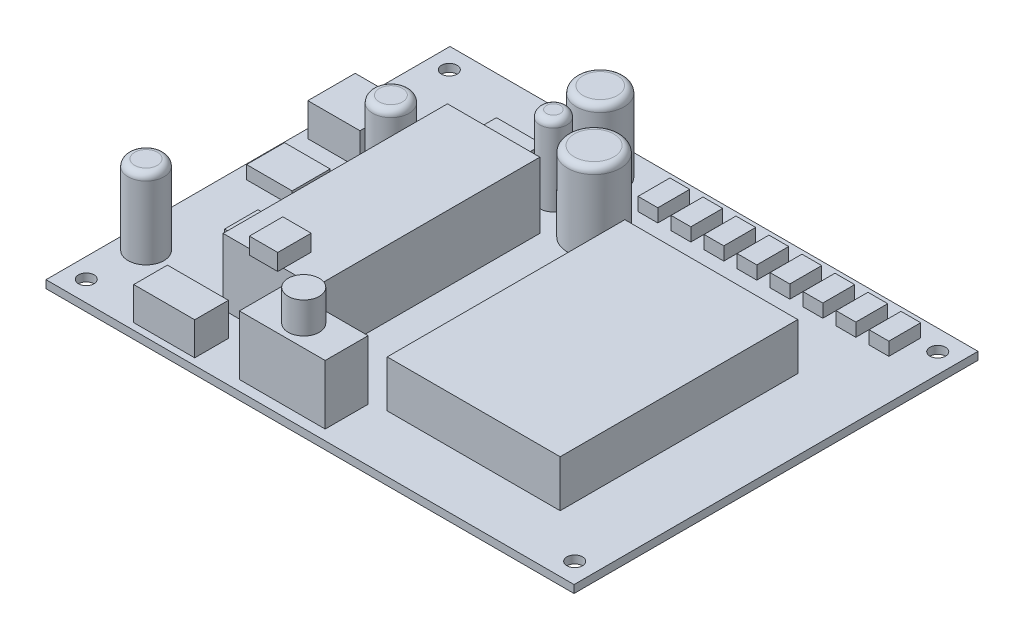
ISO-10303-21;
HEADER;
FILE_DESCRIPTION(('STEP AP214'),'2;1');
FILE_NAME('part.step','',(''),(''),'','','');
FILE_SCHEMA(('AUTOMOTIVE_DESIGN { 1 0 10303 214 1 1 1 1 }'));
ENDSEC;
DATA;
#1=APPLICATION_CONTEXT('core data for automotive mechanical design processes');
#2=APPLICATION_PROTOCOL_DEFINITION('international standard','automotive_design',2000,#1);
#3=PRODUCT_CONTEXT('',#1,'mechanical');
#4=PRODUCT('Part','Part','',(#3));
#5=PRODUCT_RELATED_PRODUCT_CATEGORY('part','',(#4));
#6=PRODUCT_DEFINITION_FORMATION('','',#4);
#7=PRODUCT_DEFINITION_CONTEXT('part definition',#1,'design');
#8=PRODUCT_DEFINITION('design','',#6,#7);
#9=PRODUCT_DEFINITION_SHAPE('','',#8);
#10=(LENGTH_UNIT() NAMED_UNIT(*) SI_UNIT(.MILLI.,.METRE.));
#11=(NAMED_UNIT(*) PLANE_ANGLE_UNIT() SI_UNIT($,.RADIAN.));
#12=(NAMED_UNIT(*) SI_UNIT($,.STERADIAN.) SOLID_ANGLE_UNIT());
#13=UNCERTAINTY_MEASURE_WITH_UNIT(LENGTH_MEASURE(1.E-05),#10,'distance_accuracy_value','');
#14=(GEOMETRIC_REPRESENTATION_CONTEXT(3) GLOBAL_UNCERTAINTY_ASSIGNED_CONTEXT((#13)) GLOBAL_UNIT_ASSIGNED_CONTEXT((#10,
#11,#12)) REPRESENTATION_CONTEXT('',''));
#15=CARTESIAN_POINT('',(0.,0.,0.));
#16=DIRECTION('',(0.,0.,1.));
#17=DIRECTION('',(1.,0.,0.));
#18=AXIS2_PLACEMENT_3D('',#15,#16,#17);
#19=CARTESIAN_POINT('',(0.,14.2,0.));
#20=DIRECTION('',(0.,-1.,0.));
#21=DIRECTION('',(0.,0.,-1.));
#22=AXIS2_PLACEMENT_3D('',#19,#20,#21);
#23=PLANE('',#22);
#24=DIRECTION('',(0.,0.,-1.));
#25=VECTOR('',#24,1.);
#26=CARTESIAN_POINT('',(-17.1681668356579,14.2,27.90740311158));
#27=LINE('',#26,#25);
#28=CARTESIAN_POINT('',(-17.1681668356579,14.2,26.8115626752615));
#29=VERTEX_POINT('',#28);
#30=CARTESIAN_POINT('',(-17.1681668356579,14.2,21.4784725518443));
#31=VERTEX_POINT('',#30);
#32=EDGE_CURVE('E11',#29,#31,#27,.T.);
#33=ORIENTED_EDGE('',*,*,#32,.F.);
#34=DIRECTION('',(1.,0.,0.));
#35=VECTOR('',#34,1.);
#36=CARTESIAN_POINT('',(-28.784075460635,14.2,26.8115626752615));
#37=LINE('',#36,#35);
#38=CARTESIAN_POINT('',(-11.004075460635,14.2,26.8115626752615));
#39=VERTEX_POINT('',#38);
#40=EDGE_CURVE('E1029',#29,#39,#37,.T.);
#41=ORIENTED_EDGE('',*,*,#40,.T.);
#42=DIRECTION('',(0.,0.,-1.));
#43=VECTOR('',#42,1.);
#44=CARTESIAN_POINT('',(-11.004075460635,14.2,26.8115626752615));
#45=LINE('',#44,#43);
#46=CARTESIAN_POINT('',(-11.004075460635,14.2,-16.3684373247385));
#47=VERTEX_POINT('',#46);
#48=EDGE_CURVE('E1021',#39,#47,#45,.T.);
#49=ORIENTED_EDGE('',*,*,#48,.T.);
#50=DIRECTION('',(-1.,0.,0.));
#51=VECTOR('',#50,1.);
#52=CARTESIAN_POINT('',(-28.784075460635,14.2,-16.3684373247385));
#53=LINE('',#52,#51);
#54=CARTESIAN_POINT('',(-28.784075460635,14.2,-16.3684373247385));
#55=VERTEX_POINT('',#54);
#56=EDGE_CURVE('E1024',#47,#55,#53,.T.);
#57=ORIENTED_EDGE('',*,*,#56,.T.);
#58=DIRECTION('',(0.,0.,1.));
#59=VECTOR('',#58,1.);
#60=CARTESIAN_POINT('',(-28.784075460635,14.2,26.8115626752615));
#61=LINE('',#60,#59);
#62=CARTESIAN_POINT('',(-28.784075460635,14.2,26.8115626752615));
#63=VERTEX_POINT('',#62);
#64=EDGE_CURVE('E1027',#55,#63,#61,.T.);
#65=ORIENTED_EDGE('',*,*,#64,.T.);
#66=CARTESIAN_POINT('',(-22.619984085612,14.2,26.8115626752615));
#67=VERTEX_POINT('',#66);
#68=EDGE_CURVE('E1030',#63,#67,#37,.T.);
#69=ORIENTED_EDGE('',*,*,#68,.T.);
#70=DIRECTION('',(0.,0.,1.));
#71=VECTOR('',#70,1.);
#72=CARTESIAN_POINT('',(-22.619984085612,14.2,27.90740311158));
#73=LINE('',#72,#71);
#74=CARTESIAN_POINT('',(-22.619984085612,14.2,21.4784725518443));
#75=VERTEX_POINT('',#74);
#76=EDGE_CURVE('E2148',#75,#67,#73,.T.);
#77=ORIENTED_EDGE('',*,*,#76,.F.);
#78=DIRECTION('',(-1.,0.,0.));
#79=VECTOR('',#78,1.);
#80=CARTESIAN_POINT('',(-22.619984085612,14.2,21.4784725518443));
#81=LINE('',#80,#79);
#82=EDGE_CURVE('E53',#31,#75,#81,.T.);
#83=ORIENTED_EDGE('',*,*,#82,.F.);
#84=EDGE_LOOP('',(#33,#41,#49,#57,#65,#69,#77,#83));
#85=FACE_BOUND('',#84,.T.);
#86=ADVANCED_FACE('F36',(#85),#23,.F.);
#87=CARTESIAN_POINT('',(0.,1.5,0.));
#88=DIRECTION('',(0.,-1.,0.));
#89=DIRECTION('',(0.,0.,-1.));
#90=AXIS2_PLACEMENT_3D('',#87,#88,#89);
#91=PLANE('',#90);
#92=DIRECTION('',(0.,0.,-1.));
#93=VECTOR('',#92,1.);
#94=CARTESIAN_POINT('',(-39.0592586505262,1.5,-9.81294281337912));
#95=LINE('',#94,#93);
#96=CARTESIAN_POINT('',(-39.0592586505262,1.5,-9.81294281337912));
#97=VERTEX_POINT('',#96);
#98=CARTESIAN_POINT('',(-39.0592586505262,1.5,-18.9216236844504));
#99=VERTEX_POINT('',#98);
#100=EDGE_CURVE('E550',#97,#99,#95,.T.);
#101=ORIENTED_EDGE('',*,*,#100,.F.);
#102=DIRECTION('',(1.,0.,0.));
#103=VECTOR('',#102,1.);
#104=CARTESIAN_POINT('',(-49.094246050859,1.5,-9.81294281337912));
#105=LINE('',#104,#103);
#106=CARTESIAN_POINT('',(-49.094246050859,1.5,-9.81294281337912));
#107=VERTEX_POINT('',#106);
#108=EDGE_CURVE('E555',#107,#97,#105,.T.);
#109=ORIENTED_EDGE('',*,*,#108,.F.);
#110=DIRECTION('',(0.,0.,1.));
#111=VECTOR('',#110,1.);
#112=CARTESIAN_POINT('',(-49.094246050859,1.5,-9.81294281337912));
#113=LINE('',#112,#111);
#114=CARTESIAN_POINT('',(-49.094246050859,1.5,-18.9216236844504));
#115=VERTEX_POINT('',#114);
#116=EDGE_CURVE('E567',#115,#107,#113,.T.);
#117=ORIENTED_EDGE('',*,*,#116,.F.);
#118=DIRECTION('',(-1.,0.,0.));
#119=VECTOR('',#118,1.);
#120=CARTESIAN_POINT('',(-49.094246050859,1.5,-18.9216236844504));
#121=LINE('',#120,#119);
#122=EDGE_CURVE('E564',#99,#115,#121,.T.);
#123=ORIENTED_EDGE('',*,*,#122,.F.);
#124=EDGE_LOOP('',(#101,#109,#117,#123));
#125=FACE_BOUND('',#124,.T.);
#126=DIRECTION('',(0.,0.,-1.));
#127=VECTOR('',#126,1.);
#128=CARTESIAN_POINT('',(36.7119354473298,1.5,-35.5782861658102));
#129=LINE('',#128,#127);
#130=CARTESIAN_POINT('',(36.7119354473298,1.5,-29.4415797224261));
#131=VERTEX_POINT('',#130);
#132=CARTESIAN_POINT('',(36.7119354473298,1.5,-35.5782861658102));
#133=VERTEX_POINT('',#132);
#134=EDGE_CURVE('E616',#131,#133,#129,.T.);
#135=ORIENTED_EDGE('',*,*,#134,.F.);
#136=DIRECTION('',(1.,0.,0.));
#137=VECTOR('',#136,1.);
#138=CARTESIAN_POINT('',(32.9130219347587,1.5,-29.4415797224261));
#139=LINE('',#138,#137);
#140=CARTESIAN_POINT('',(32.9130219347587,1.5,-29.4415797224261));
#141=VERTEX_POINT('',#140);
#142=EDGE_CURVE('E621',#141,#131,#139,.T.);
#143=ORIENTED_EDGE('',*,*,#142,.F.);
#144=DIRECTION('',(0.,0.,1.));
#145=VECTOR('',#144,1.);
#146=CARTESIAN_POINT('',(32.9130219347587,1.5,-35.5782861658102));
#147=LINE('',#146,#145);
#148=CARTESIAN_POINT('',(32.9130219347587,1.5,-35.5782861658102));
#149=VERTEX_POINT('',#148);
#150=EDGE_CURVE('E633',#149,#141,#147,.T.);
#151=ORIENTED_EDGE('',*,*,#150,.F.);
#152=DIRECTION('',(-1.,0.,0.));
#153=VECTOR('',#152,1.);
#154=CARTESIAN_POINT('',(32.9130219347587,1.5,-35.5782861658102));
#155=LINE('',#154,#153);
#156=EDGE_CURVE('E630',#133,#149,#155,.T.);
#157=ORIENTED_EDGE('',*,*,#156,.F.);
#158=EDGE_LOOP('',(#135,#143,#151,#157));
#159=FACE_BOUND('',#158,.T.);
#160=DIRECTION('',(0.,0.,-1.));
#161=VECTOR('',#160,1.);
#162=CARTESIAN_POINT('',(24.0119354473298,1.5,-35.5782861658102));
#163=LINE('',#162,#161);
#164=CARTESIAN_POINT('',(24.0119354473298,1.5,-29.4415797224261));
#165=VERTEX_POINT('',#164);
#166=CARTESIAN_POINT('',(24.0119354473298,1.5,-35.5782861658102));
#167=VERTEX_POINT('',#166);
#168=EDGE_CURVE('E682',#165,#167,#163,.T.);
#169=ORIENTED_EDGE('',*,*,#168,.F.);
#170=DIRECTION('',(1.,0.,0.));
#171=VECTOR('',#170,1.);
#172=CARTESIAN_POINT('',(20.2130219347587,1.5,-29.4415797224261));
#173=LINE('',#172,#171);
#174=CARTESIAN_POINT('',(20.2130219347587,1.5,-29.4415797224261));
#175=VERTEX_POINT('',#174);
#176=EDGE_CURVE('E687',#175,#165,#173,.T.);
#177=ORIENTED_EDGE('',*,*,#176,.F.);
#178=DIRECTION('',(0.,0.,1.));
#179=VECTOR('',#178,1.);
#180=CARTESIAN_POINT('',(20.2130219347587,1.5,-35.5782861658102));
#181=LINE('',#180,#179);
#182=CARTESIAN_POINT('',(20.2130219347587,1.5,-35.5782861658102));
#183=VERTEX_POINT('',#182);
#184=EDGE_CURVE('E699',#183,#175,#181,.T.);
#185=ORIENTED_EDGE('',*,*,#184,.F.);
#186=DIRECTION('',(-1.,0.,0.));
#187=VECTOR('',#186,1.);
#188=CARTESIAN_POINT('',(20.2130219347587,1.5,-35.5782861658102));
#189=LINE('',#188,#187);
#190=EDGE_CURVE('E696',#167,#183,#189,.T.);
#191=ORIENTED_EDGE('',*,*,#190,.F.);
#192=EDGE_LOOP('',(#169,#177,#185,#191));
#193=FACE_BOUND('',#192,.T.);
#194=DIRECTION('',(0.,0.,-1.));
#195=VECTOR('',#194,1.);
#196=CARTESIAN_POINT('',(11.3119354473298,1.5,-35.5782861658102));
#197=LINE('',#196,#195);
#198=CARTESIAN_POINT('',(11.3119354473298,1.5,-29.4415797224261));
#199=VERTEX_POINT('',#198);
#200=CARTESIAN_POINT('',(11.3119354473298,1.5,-35.5782861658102));
#201=VERTEX_POINT('',#200);
#202=EDGE_CURVE('E748',#199,#201,#197,.T.);
#203=ORIENTED_EDGE('',*,*,#202,.F.);
#204=DIRECTION('',(1.,0.,0.));
#205=VECTOR('',#204,1.);
#206=CARTESIAN_POINT('',(7.51302193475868,1.5,-29.4415797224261));
#207=LINE('',#206,#205);
#208=CARTESIAN_POINT('',(7.51302193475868,1.5,-29.4415797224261));
#209=VERTEX_POINT('',#208);
#210=EDGE_CURVE('E753',#209,#199,#207,.T.);
#211=ORIENTED_EDGE('',*,*,#210,.F.);
#212=DIRECTION('',(0.,0.,1.));
#213=VECTOR('',#212,1.);
#214=CARTESIAN_POINT('',(7.51302193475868,1.5,-35.5782861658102));
#215=LINE('',#214,#213);
#216=CARTESIAN_POINT('',(7.51302193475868,1.5,-35.5782861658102));
#217=VERTEX_POINT('',#216);
#218=EDGE_CURVE('E765',#217,#209,#215,.T.);
#219=ORIENTED_EDGE('',*,*,#218,.F.);
#220=DIRECTION('',(-1.,0.,0.));
#221=VECTOR('',#220,1.);
#222=CARTESIAN_POINT('',(7.51302193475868,1.5,-35.5782861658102));
#223=LINE('',#222,#221);
#224=EDGE_CURVE('E762',#201,#217,#223,.T.);
#225=ORIENTED_EDGE('',*,*,#224,.F.);
#226=EDGE_LOOP('',(#203,#211,#219,#225));
#227=FACE_BOUND('',#226,.T.);
#228=DIRECTION('',(0.,0.,-1.));
#229=VECTOR('',#228,1.);
#230=CARTESIAN_POINT('',(-1.38806455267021,1.5,-35.5782861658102));
#231=LINE('',#230,#229);
#232=CARTESIAN_POINT('',(-1.38806455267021,1.5,-29.4415797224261));
#233=VERTEX_POINT('',#232);
#234=CARTESIAN_POINT('',(-1.38806455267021,1.5,-35.5782861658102));
#235=VERTEX_POINT('',#234);
#236=EDGE_CURVE('E814',#233,#235,#231,.T.);
#237=ORIENTED_EDGE('',*,*,#236,.F.);
#238=DIRECTION('',(1.,0.,0.));
#239=VECTOR('',#238,1.);
#240=CARTESIAN_POINT('',(-5.18697806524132,1.5,-29.4415797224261));
#241=LINE('',#240,#239);
#242=CARTESIAN_POINT('',(-5.18697806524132,1.5,-29.4415797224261));
#243=VERTEX_POINT('',#242);
#244=EDGE_CURVE('E819',#243,#233,#241,.T.);
#245=ORIENTED_EDGE('',*,*,#244,.F.);
#246=DIRECTION('',(0.,0.,1.));
#247=VECTOR('',#246,1.);
#248=CARTESIAN_POINT('',(-5.18697806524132,1.5,-35.5782861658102));
#249=LINE('',#248,#247);
#250=CARTESIAN_POINT('',(-5.18697806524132,1.5,-35.5782861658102));
#251=VERTEX_POINT('',#250);
#252=EDGE_CURVE('E831',#251,#243,#249,.T.);
#253=ORIENTED_EDGE('',*,*,#252,.F.);
#254=DIRECTION('',(-1.,0.,0.));
#255=VECTOR('',#254,1.);
#256=CARTESIAN_POINT('',(-5.18697806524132,1.5,-35.5782861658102));
#257=LINE('',#256,#255);
#258=EDGE_CURVE('E828',#235,#251,#257,.T.);
#259=ORIENTED_EDGE('',*,*,#258,.F.);
#260=EDGE_LOOP('',(#237,#245,#253,#259));
#261=FACE_BOUND('',#260,.T.);
#262=DIRECTION('',(0.,0.,-1.));
#263=VECTOR('',#262,1.);
#264=CARTESIAN_POINT('',(-32.3638208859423,1.5,9.35117172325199));
#265=LINE('',#264,#263);
#266=CARTESIAN_POINT('',(-32.3638208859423,1.5,15.7801022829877));
#267=VERTEX_POINT('',#266);
#268=CARTESIAN_POINT('',(-32.3638208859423,1.5,9.35117172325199));
#269=VERTEX_POINT('',#268);
#270=EDGE_CURVE('E880',#267,#269,#265,.T.);
#271=ORIENTED_EDGE('',*,*,#270,.F.);
#272=DIRECTION('',(1.,0.,0.));
#273=VECTOR('',#272,1.);
#274=CARTESIAN_POINT('',(-39.5233117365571,1.5,15.7801022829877));
#275=LINE('',#274,#273);
#276=CARTESIAN_POINT('',(-39.5233117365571,1.5,15.7801022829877));
#277=VERTEX_POINT('',#276);
#278=EDGE_CURVE('E885',#277,#267,#275,.T.);
#279=ORIENTED_EDGE('',*,*,#278,.F.);
#280=DIRECTION('',(0.,0.,1.));
#281=VECTOR('',#280,1.);
#282=CARTESIAN_POINT('',(-39.5233117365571,1.5,9.35117172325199));
#283=LINE('',#282,#281);
#284=CARTESIAN_POINT('',(-39.5233117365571,1.5,9.35117172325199));
#285=VERTEX_POINT('',#284);
#286=EDGE_CURVE('E897',#285,#277,#283,.T.);
#287=ORIENTED_EDGE('',*,*,#286,.F.);
#288=DIRECTION('',(-1.,0.,0.));
#289=VECTOR('',#288,1.);
#290=CARTESIAN_POINT('',(-39.5233117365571,1.5,9.35117172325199));
#291=LINE('',#290,#289);
#292=EDGE_CURVE('E894',#269,#285,#291,.T.);
#293=ORIENTED_EDGE('',*,*,#292,.F.);
#294=EDGE_LOOP('',(#271,#279,#287,#293));
#295=FACE_BOUND('',#294,.T.);
#296=DIRECTION('',(0.,0.,-1.));
#297=VECTOR('',#296,1.);
#298=CARTESIAN_POINT('',(37.1657441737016,1.5,27.9008660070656));
#299=LINE('',#298,#297);
#300=CARTESIAN_POINT('',(37.1657441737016,1.5,27.9008660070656));
#301=VERTEX_POINT('',#300);
#302=CARTESIAN_POINT('',(37.1657441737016,1.5,-17.8191339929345));
#303=VERTEX_POINT('',#302);
#304=EDGE_CURVE('E946',#301,#303,#299,.T.);
#305=ORIENTED_EDGE('',*,*,#304,.F.);
#306=DIRECTION('',(1.,0.,0.));
#307=VECTOR('',#306,1.);
#308=CARTESIAN_POINT('',(3.89174417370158,1.5,27.9008660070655));
#309=LINE('',#308,#307);
#310=CARTESIAN_POINT('',(3.89174417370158,1.5,27.9008660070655));
#311=VERTEX_POINT('',#310);
#312=EDGE_CURVE('E951',#311,#301,#309,.T.);
#313=ORIENTED_EDGE('',*,*,#312,.F.);
#314=DIRECTION('',(0.,0.,1.));
#315=VECTOR('',#314,1.);
#316=CARTESIAN_POINT('',(3.89174417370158,1.5,27.9008660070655));
#317=LINE('',#316,#315);
#318=CARTESIAN_POINT('',(3.89174417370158,1.5,-17.8191339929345));
#319=VERTEX_POINT('',#318);
#320=EDGE_CURVE('E963',#319,#311,#317,.T.);
#321=ORIENTED_EDGE('',*,*,#320,.F.);
#322=DIRECTION('',(-1.,0.,0.));
#323=VECTOR('',#322,1.);
#324=CARTESIAN_POINT('',(3.89174417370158,1.5,-17.8191339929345));
#325=LINE('',#324,#323);
#326=EDGE_CURVE('E960',#303,#319,#325,.T.);
#327=ORIENTED_EDGE('',*,*,#326,.F.);
#328=EDGE_LOOP('',(#305,#313,#321,#327));
#329=FACE_BOUND('',#328,.T.);
#330=DIRECTION('',(0.,0.,-1.));
#331=VECTOR('',#330,1.);
#332=CARTESIAN_POINT('',(-11.004075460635,1.5,26.8115626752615));
#333=LINE('',#332,#331);
#334=CARTESIAN_POINT('',(-11.004075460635,1.5,26.8115626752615));
#335=VERTEX_POINT('',#334);
#336=CARTESIAN_POINT('',(-11.004075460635,1.5,-16.3684373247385));
#337=VERTEX_POINT('',#336);
#338=EDGE_CURVE('E1020',#335,#337,#333,.T.);
#339=ORIENTED_EDGE('',*,*,#338,.F.);
#340=DIRECTION('',(1.,0.,0.));
#341=VECTOR('',#340,1.);
#342=CARTESIAN_POINT('',(-28.784075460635,1.5,26.8115626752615));
#343=LINE('',#342,#341);
#344=CARTESIAN_POINT('',(-28.784075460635,1.5,26.8115626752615));
#345=VERTEX_POINT('',#344);
#346=EDGE_CURVE('E1025',#345,#335,#343,.T.);
#347=ORIENTED_EDGE('',*,*,#346,.F.);
#348=DIRECTION('',(0.,0.,1.));
#349=VECTOR('',#348,1.);
#350=CARTESIAN_POINT('',(-28.784075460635,1.5,26.8115626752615));
#351=LINE('',#350,#349);
#352=CARTESIAN_POINT('',(-28.784075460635,1.5,-16.3684373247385));
#353=VERTEX_POINT('',#352);
#354=EDGE_CURVE('E1040',#353,#345,#351,.T.);
#355=ORIENTED_EDGE('',*,*,#354,.F.);
#356=DIRECTION('',(-1.,0.,0.));
#357=VECTOR('',#356,1.);
#358=CARTESIAN_POINT('',(-28.784075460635,1.5,-16.3684373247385));
#359=LINE('',#358,#357);
#360=EDGE_CURVE('E1037',#337,#353,#359,.T.);
#361=ORIENTED_EDGE('',*,*,#360,.F.);
#362=EDGE_LOOP('',(#339,#347,#355,#361));
#363=FACE_BOUND('',#362,.T.);
#364=DIRECTION('',(0.,0.,-1.));
#365=VECTOR('',#364,1.);
#366=CARTESIAN_POINT('',(50.8,1.5,38.862));
#367=LINE('',#366,#365);
#368=CARTESIAN_POINT('',(50.8,1.5,38.862));
#369=VERTEX_POINT('',#368);
#370=CARTESIAN_POINT('',(50.8,1.5,-38.862));
#371=VERTEX_POINT('',#370);
#372=EDGE_CURVE('E1081',#369,#371,#367,.T.);
#373=ORIENTED_EDGE('',*,*,#372,.T.);
#374=DIRECTION('',(-1.,0.,0.));
#375=VECTOR('',#374,1.);
#376=CARTESIAN_POINT('',(-50.8,1.5,-38.862));
#377=LINE('',#376,#375);
#378=CARTESIAN_POINT('',(-50.8,1.5,-38.862));
#379=VERTEX_POINT('',#378);
#380=EDGE_CURVE('E1084',#371,#379,#377,.T.);
#381=ORIENTED_EDGE('',*,*,#380,.T.);
#382=DIRECTION('',(0.,0.,1.));
#383=VECTOR('',#382,1.);
#384=CARTESIAN_POINT('',(-50.8,1.5,38.862));
#385=LINE('',#384,#383);
#386=CARTESIAN_POINT('',(-50.8,1.5,38.862));
#387=VERTEX_POINT('',#386);
#388=EDGE_CURVE('E1087',#379,#387,#385,.T.);
#389=ORIENTED_EDGE('',*,*,#388,.T.);
#390=DIRECTION('',(1.,0.,0.));
#391=VECTOR('',#390,1.);
#392=CARTESIAN_POINT('',(-50.8,1.5,38.862));
#393=LINE('',#392,#391);
#394=EDGE_CURVE('E1089',#387,#369,#393,.T.);
#395=ORIENTED_EDGE('',*,*,#394,.T.);
#396=EDGE_LOOP('',(#373,#381,#389,#395));
#397=FACE_BOUND('',#396,.T.);
#398=CARTESIAN_POINT('',(-46.99,1.5,-34.925));
#399=DIRECTION('',(0.,1.,0.));
#400=DIRECTION('',(0.,0.,1.));
#401=AXIS2_PLACEMENT_3D('',#398,#399,#400);
#402=CIRCLE('',#401,1.5);
#403=CARTESIAN_POINT('',(-46.99,1.5,-33.425));
#404=VERTEX_POINT('',#403);
#405=EDGE_CURVE('E1075',#404,#404,#402,.T.);
#406=ORIENTED_EDGE('',*,*,#405,.F.);
#407=EDGE_LOOP('',(#406));
#408=FACE_BOUND('',#407,.T.);
#409=CARTESIAN_POINT('',(46.99,1.5,-34.925));
#410=DIRECTION('',(0.,1.,0.));
#411=DIRECTION('',(0.,0.,1.));
#412=AXIS2_PLACEMENT_3D('',#409,#410,#411);
#413=CIRCLE('',#412,1.5);
#414=CARTESIAN_POINT('',(46.99,1.5,-33.425));
#415=VERTEX_POINT('',#414);
#416=EDGE_CURVE('E1069',#415,#415,#413,.T.);
#417=ORIENTED_EDGE('',*,*,#416,.F.);
#418=EDGE_LOOP('',(#417));
#419=FACE_BOUND('',#418,.T.);
#420=CARTESIAN_POINT('',(46.99,1.5,34.925));
#421=DIRECTION('',(0.,1.,0.));
#422=DIRECTION('',(0.,0.,1.));
#423=AXIS2_PLACEMENT_3D('',#420,#421,#422);
#424=CIRCLE('',#423,1.5);
#425=CARTESIAN_POINT('',(46.99,1.5,36.425));
#426=VERTEX_POINT('',#425);
#427=EDGE_CURVE('E1063',#426,#426,#424,.T.);
#428=ORIENTED_EDGE('',*,*,#427,.F.);
#429=EDGE_LOOP('',(#428));
#430=FACE_BOUND('',#429,.T.);
#431=CARTESIAN_POINT('',(-46.99,1.5,34.925));
#432=DIRECTION('',(0.,1.,0.));
#433=DIRECTION('',(0.,0.,1.));
#434=AXIS2_PLACEMENT_3D('',#431,#432,#433);
#435=CIRCLE('',#434,1.5);
#436=CARTESIAN_POINT('',(-46.99,1.5,36.425));
#437=VERTEX_POINT('',#436);
#438=EDGE_CURVE('E1057',#437,#437,#435,.T.);
#439=ORIENTED_EDGE('',*,*,#438,.F.);
#440=EDGE_LOOP('',(#439));
#441=FACE_BOUND('',#440,.T.);
#442=DIRECTION('',(0.,0.,-1.));
#443=VECTOR('',#442,1.);
#444=CARTESIAN_POINT('',(0.949065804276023,1.5,36.8932946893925));
#445=LINE('',#444,#443);
#446=CARTESIAN_POINT('',(0.949065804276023,1.5,36.8932946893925));
#447=VERTEX_POINT('',#446);
#448=CARTESIAN_POINT('',(0.949065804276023,1.5,28.6382946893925));
#449=VERTEX_POINT('',#448);
#450=EDGE_CURVE('E982',#447,#449,#445,.T.);
#451=ORIENTED_EDGE('',*,*,#450,.F.);
#452=DIRECTION('',(1.,0.,0.));
#453=VECTOR('',#452,1.);
#454=CARTESIAN_POINT('',(-15.560934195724,1.5,36.8932946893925));
#455=LINE('',#454,#453);
#456=CARTESIAN_POINT('',(-15.560934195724,1.5,36.8932946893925));
#457=VERTEX_POINT('',#456);
#458=EDGE_CURVE('E992',#457,#447,#455,.T.);
#459=ORIENTED_EDGE('',*,*,#458,.F.);
#460=DIRECTION('',(0.,0.,1.));
#461=VECTOR('',#460,1.);
#462=CARTESIAN_POINT('',(-15.560934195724,1.5,36.8932946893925));
#463=LINE('',#462,#461);
#464=CARTESIAN_POINT('',(-15.560934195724,1.5,28.6382946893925));
#465=VERTEX_POINT('',#464);
#466=EDGE_CURVE('E1004',#465,#457,#463,.T.);
#467=ORIENTED_EDGE('',*,*,#466,.F.);
#468=DIRECTION('',(-1.,0.,0.));
#469=VECTOR('',#468,1.);
#470=CARTESIAN_POINT('',(-15.560934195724,1.5,28.6382946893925));
#471=LINE('',#470,#469);
#472=EDGE_CURVE('E1001',#449,#465,#471,.T.);
#473=ORIENTED_EDGE('',*,*,#472,.F.);
#474=EDGE_LOOP('',(#451,#459,#467,#473));
#475=FACE_BOUND('',#474,.T.);
#476=CARTESIAN_POINT('',(-14.5847576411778,1.5,-31.5625040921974));
#477=DIRECTION('',(0.,-1.,0.));
#478=DIRECTION('',(0.,0.,-1.));
#479=AXIS2_PLACEMENT_3D('',#476,#477,#478);
#480=CIRCLE('',#479,4.57063215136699);
#481=CARTESIAN_POINT('',(-14.5847576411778,1.5,-36.1331362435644));
#482=VERTEX_POINT('',#481);
#483=EDGE_CURVE('E986',#482,#482,#480,.F.);
#484=ORIENTED_EDGE('',*,*,#483,.F.);
#485=EDGE_LOOP('',(#484));
#486=FACE_BOUND('',#485,.T.);
#487=CARTESIAN_POINT('',(-15.1058367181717,1.5,-23.0763591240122));
#488=DIRECTION('',(0.,-1.,0.));
#489=DIRECTION('',(0.,0.,-1.));
#490=AXIS2_PLACEMENT_3D('',#487,#488,#489);
#491=CIRCLE('',#490,2.60539538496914);
#492=CARTESIAN_POINT('',(-15.1058367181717,1.5,-25.6817545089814));
#493=VERTEX_POINT('',#492);
#494=EDGE_CURVE('E1111',#493,#493,#491,.F.);
#495=ORIENTED_EDGE('',*,*,#494,.F.);
#496=EDGE_LOOP('',(#495));
#497=FACE_BOUND('',#496,.T.);
#498=CARTESIAN_POINT('',(-5.20533425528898,1.5,-20.9920428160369));
#499=DIRECTION('',(0.,-1.,0.));
#500=DIRECTION('',(0.,0.,-1.));
#501=AXIS2_PLACEMENT_3D('',#498,#499,#500);
#502=CIRCLE('',#501,5.07994153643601);
#503=CARTESIAN_POINT('',(-5.20533425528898,1.5,-26.0719843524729));
#504=VERTEX_POINT('',#503);
#505=EDGE_CURVE('E1114',#504,#504,#502,.F.);
#506=ORIENTED_EDGE('',*,*,#505,.F.);
#507=EDGE_LOOP('',(#506));
#508=FACE_BOUND('',#507,.T.);
#509=CARTESIAN_POINT('',(-33.1202848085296,1.5,-9.82606259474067));
#510=DIRECTION('',(0.,-1.,0.));
#511=DIRECTION('',(0.,0.,-1.));
#512=AXIS2_PLACEMENT_3D('',#509,#510,#511);
#513=CIRCLE('',#512,3.50421281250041);
#514=CARTESIAN_POINT('',(-33.1202848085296,1.5,-13.3302754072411));
#515=VERTEX_POINT('',#514);
#516=EDGE_CURVE('E1117',#515,#515,#513,.F.);
#517=ORIENTED_EDGE('',*,*,#516,.F.);
#518=EDGE_LOOP('',(#517));
#519=FACE_BOUND('',#518,.T.);
#520=CARTESIAN_POINT('',(-46.0728218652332,1.5,24.3418368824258));
#521=DIRECTION('',(0.,-1.,0.));
#522=DIRECTION('',(0.,0.,-1.));
#523=AXIS2_PLACEMENT_3D('',#520,#521,#522);
#524=CIRCLE('',#523,3.45323972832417);
#525=CARTESIAN_POINT('',(-46.0728218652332,1.5,20.8885971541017));
#526=VERTEX_POINT('',#525);
#527=EDGE_CURVE('E1120',#526,#526,#524,.F.);
#528=ORIENTED_EDGE('',*,*,#527,.F.);
#529=EDGE_LOOP('',(#528));
#530=FACE_BOUND('',#529,.T.);
#531=DIRECTION('',(0.,0.,-1.));
#532=VECTOR('',#531,1.);
#533=CARTESIAN_POINT('',(-39.3771996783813,1.5,-4.38336174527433));
#534=LINE('',#533,#532);
#535=CARTESIAN_POINT('',(-39.3771996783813,1.5,2.92224116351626));
#536=VERTEX_POINT('',#535);
#537=CARTESIAN_POINT('',(-39.3771996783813,1.5,-4.38336174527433));
#538=VERTEX_POINT('',#537);
#539=EDGE_CURVE('E913',#536,#538,#534,.T.);
#540=ORIENTED_EDGE('',*,*,#539,.F.);
#541=DIRECTION('',(1.,0.,0.));
#542=VECTOR('',#541,1.);
#543=CARTESIAN_POINT('',(-48.14392316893,1.5,2.92224116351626));
#544=LINE('',#543,#542);
#545=CARTESIAN_POINT('',(-48.14392316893,1.5,2.92224116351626));
#546=VERTEX_POINT('',#545);
#547=EDGE_CURVE('E918',#546,#536,#544,.T.);
#548=ORIENTED_EDGE('',*,*,#547,.F.);
#549=DIRECTION('',(0.,0.,1.));
#550=VECTOR('',#549,1.);
#551=CARTESIAN_POINT('',(-48.14392316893,1.5,-4.38336174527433));
#552=LINE('',#551,#550);
#553=CARTESIAN_POINT('',(-48.14392316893,1.5,-4.38336174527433));
#554=VERTEX_POINT('',#553);
#555=EDGE_CURVE('E930',#554,#546,#552,.T.);
#556=ORIENTED_EDGE('',*,*,#555,.F.);
#557=DIRECTION('',(-1.,0.,0.));
#558=VECTOR('',#557,1.);
#559=CARTESIAN_POINT('',(-48.14392316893,1.5,-4.38336174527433));
#560=LINE('',#559,#558);
#561=EDGE_CURVE('E927',#538,#554,#560,.T.);
#562=ORIENTED_EDGE('',*,*,#561,.F.);
#563=EDGE_LOOP('',(#540,#548,#556,#562));
#564=FACE_BOUND('',#563,.T.);
#565=DIRECTION('',(0.,0.,-1.));
#566=VECTOR('',#565,1.);
#567=CARTESIAN_POINT('',(-23.0126491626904,1.5,-28.9301875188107));
#568=LINE('',#567,#566);
#569=CARTESIAN_POINT('',(-23.0126491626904,1.5,-24.5468257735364));
#570=VERTEX_POINT('',#569);
#571=CARTESIAN_POINT('',(-23.0126491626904,1.5,-28.9301875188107));
#572=VERTEX_POINT('',#571);
#573=EDGE_CURVE('E847',#570,#572,#568,.T.);
#574=ORIENTED_EDGE('',*,*,#573,.F.);
#575=DIRECTION('',(1.,0.,0.));
#576=VECTOR('',#575,1.);
#577=CARTESIAN_POINT('',(-31.9254847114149,1.5,-24.5468257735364));
#578=LINE('',#577,#576);
#579=CARTESIAN_POINT('',(-31.9254847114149,1.5,-24.5468257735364));
#580=VERTEX_POINT('',#579);
#581=EDGE_CURVE('E852',#580,#570,#578,.T.);
#582=ORIENTED_EDGE('',*,*,#581,.F.);
#583=DIRECTION('',(0.,0.,1.));
#584=VECTOR('',#583,1.);
#585=CARTESIAN_POINT('',(-31.9254847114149,1.5,-28.9301875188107));
#586=LINE('',#585,#584);
#587=CARTESIAN_POINT('',(-31.9254847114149,1.5,-28.9301875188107));
#588=VERTEX_POINT('',#587);
#589=EDGE_CURVE('E864',#588,#580,#586,.T.);
#590=ORIENTED_EDGE('',*,*,#589,.F.);
#591=DIRECTION('',(-1.,0.,0.));
#592=VECTOR('',#591,1.);
#593=CARTESIAN_POINT('',(-31.9254847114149,1.5,-28.9301875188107));
#594=LINE('',#593,#592);
#595=EDGE_CURVE('E861',#572,#588,#594,.T.);
#596=ORIENTED_EDGE('',*,*,#595,.F.);
#597=EDGE_LOOP('',(#574,#582,#590,#596));
#598=FACE_BOUND('',#597,.T.);
#599=DIRECTION('',(0.,0.,-1.));
#600=VECTOR('',#599,1.);
#601=CARTESIAN_POINT('',(4.96193544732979,1.5,-35.5782861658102));
#602=LINE('',#601,#600);
#603=CARTESIAN_POINT('',(4.96193544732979,1.5,-29.4415797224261));
#604=VERTEX_POINT('',#603);
#605=CARTESIAN_POINT('',(4.96193544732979,1.5,-35.5782861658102));
#606=VERTEX_POINT('',#605);
#607=EDGE_CURVE('E781',#604,#606,#602,.T.);
#608=ORIENTED_EDGE('',*,*,#607,.F.);
#609=DIRECTION('',(1.,0.,0.));
#610=VECTOR('',#609,1.);
#611=CARTESIAN_POINT('',(1.16302193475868,1.5,-29.4415797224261));
#612=LINE('',#611,#610);
#613=CARTESIAN_POINT('',(1.16302193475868,1.5,-29.4415797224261));
#614=VERTEX_POINT('',#613);
#615=EDGE_CURVE('E786',#614,#604,#612,.T.);
#616=ORIENTED_EDGE('',*,*,#615,.F.);
#617=DIRECTION('',(0.,0.,1.));
#618=VECTOR('',#617,1.);
#619=CARTESIAN_POINT('',(1.16302193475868,1.5,-35.5782861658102));
#620=LINE('',#619,#618);
#621=CARTESIAN_POINT('',(1.16302193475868,1.5,-35.5782861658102));
#622=VERTEX_POINT('',#621);
#623=EDGE_CURVE('E798',#622,#614,#620,.T.);
#624=ORIENTED_EDGE('',*,*,#623,.F.);
#625=DIRECTION('',(-1.,0.,0.));
#626=VECTOR('',#625,1.);
#627=CARTESIAN_POINT('',(1.16302193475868,1.5,-35.5782861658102));
#628=LINE('',#627,#626);
#629=EDGE_CURVE('E795',#606,#622,#628,.T.);
#630=ORIENTED_EDGE('',*,*,#629,.F.);
#631=EDGE_LOOP('',(#608,#616,#624,#630));
#632=FACE_BOUND('',#631,.T.);
#633=DIRECTION('',(0.,0.,-1.));
#634=VECTOR('',#633,1.);
#635=CARTESIAN_POINT('',(17.6619354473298,1.5,-35.5782861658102));
#636=LINE('',#635,#634);
#637=CARTESIAN_POINT('',(17.6619354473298,1.5,-29.4415797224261));
#638=VERTEX_POINT('',#637);
#639=CARTESIAN_POINT('',(17.6619354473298,1.5,-35.5782861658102));
#640=VERTEX_POINT('',#639);
#641=EDGE_CURVE('E715',#638,#640,#636,.T.);
#642=ORIENTED_EDGE('',*,*,#641,.F.);
#643=DIRECTION('',(1.,0.,0.));
#644=VECTOR('',#643,1.);
#645=CARTESIAN_POINT('',(13.8630219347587,1.5,-29.4415797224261));
#646=LINE('',#645,#644);
#647=CARTESIAN_POINT('',(13.8630219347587,1.5,-29.4415797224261));
#648=VERTEX_POINT('',#647);
#649=EDGE_CURVE('E720',#648,#638,#646,.T.);
#650=ORIENTED_EDGE('',*,*,#649,.F.);
#651=DIRECTION('',(0.,0.,1.));
#652=VECTOR('',#651,1.);
#653=CARTESIAN_POINT('',(13.8630219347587,1.5,-35.5782861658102));
#654=LINE('',#653,#652);
#655=CARTESIAN_POINT('',(13.8630219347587,1.5,-35.5782861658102));
#656=VERTEX_POINT('',#655);
#657=EDGE_CURVE('E732',#656,#648,#654,.T.);
#658=ORIENTED_EDGE('',*,*,#657,.F.);
#659=DIRECTION('',(-1.,0.,0.));
#660=VECTOR('',#659,1.);
#661=CARTESIAN_POINT('',(13.8630219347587,1.5,-35.5782861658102));
#662=LINE('',#661,#660);
#663=EDGE_CURVE('E729',#640,#656,#662,.T.);
#664=ORIENTED_EDGE('',*,*,#663,.F.);
#665=EDGE_LOOP('',(#642,#650,#658,#664));
#666=FACE_BOUND('',#665,.T.);
#667=DIRECTION('',(0.,0.,-1.));
#668=VECTOR('',#667,1.);
#669=CARTESIAN_POINT('',(30.3619354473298,1.5,-35.5782861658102));
#670=LINE('',#669,#668);
#671=CARTESIAN_POINT('',(30.3619354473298,1.5,-29.4415797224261));
#672=VERTEX_POINT('',#671);
#673=CARTESIAN_POINT('',(30.3619354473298,1.5,-35.5782861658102));
#674=VERTEX_POINT('',#673);
#675=EDGE_CURVE('E649',#672,#674,#670,.T.);
#676=ORIENTED_EDGE('',*,*,#675,.F.);
#677=DIRECTION('',(1.,0.,0.));
#678=VECTOR('',#677,1.);
#679=CARTESIAN_POINT('',(26.5630219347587,1.5,-29.4415797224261));
#680=LINE('',#679,#678);
#681=CARTESIAN_POINT('',(26.5630219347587,1.5,-29.4415797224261));
#682=VERTEX_POINT('',#681);
#683=EDGE_CURVE('E654',#682,#672,#680,.T.);
#684=ORIENTED_EDGE('',*,*,#683,.F.);
#685=DIRECTION('',(0.,0.,1.));
#686=VECTOR('',#685,1.);
#687=CARTESIAN_POINT('',(26.5630219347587,1.5,-35.5782861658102));
#688=LINE('',#687,#686);
#689=CARTESIAN_POINT('',(26.5630219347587,1.5,-35.5782861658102));
#690=VERTEX_POINT('',#689);
#691=EDGE_CURVE('E666',#690,#682,#688,.T.);
#692=ORIENTED_EDGE('',*,*,#691,.F.);
#693=DIRECTION('',(-1.,0.,0.));
#694=VECTOR('',#693,1.);
#695=CARTESIAN_POINT('',(26.5630219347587,1.5,-35.5782861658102));
#696=LINE('',#695,#694);
#697=EDGE_CURVE('E663',#674,#690,#696,.T.);
#698=ORIENTED_EDGE('',*,*,#697,.F.);
#699=EDGE_LOOP('',(#676,#684,#692,#698));
#700=FACE_BOUND('',#699,.T.);
#701=DIRECTION('',(0.,0.,-1.));
#702=VECTOR('',#701,1.);
#703=CARTESIAN_POINT('',(43.0619354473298,1.5,-35.5782861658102));
#704=LINE('',#703,#702);
#705=CARTESIAN_POINT('',(43.0619354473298,1.5,-29.4415797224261));
#706=VERTEX_POINT('',#705);
#707=CARTESIAN_POINT('',(43.0619354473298,1.5,-35.5782861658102));
#708=VERTEX_POINT('',#707);
#709=EDGE_CURVE('E583',#706,#708,#704,.T.);
#710=ORIENTED_EDGE('',*,*,#709,.F.);
#711=DIRECTION('',(1.,0.,0.));
#712=VECTOR('',#711,1.);
#713=CARTESIAN_POINT('',(39.2630219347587,1.5,-29.4415797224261));
#714=LINE('',#713,#712);
#715=CARTESIAN_POINT('',(39.2630219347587,1.5,-29.4415797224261));
#716=VERTEX_POINT('',#715);
#717=EDGE_CURVE('E588',#716,#706,#714,.T.);
#718=ORIENTED_EDGE('',*,*,#717,.F.);
#719=DIRECTION('',(0.,0.,1.));
#720=VECTOR('',#719,1.);
#721=CARTESIAN_POINT('',(39.2630219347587,1.5,-35.5782861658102));
#722=LINE('',#721,#720);
#723=CARTESIAN_POINT('',(39.2630219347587,1.5,-35.5782861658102));
#724=VERTEX_POINT('',#723);
#725=EDGE_CURVE('E600',#724,#716,#722,.T.);
#726=ORIENTED_EDGE('',*,*,#725,.F.);
#727=DIRECTION('',(-1.,0.,0.));
#728=VECTOR('',#727,1.);
#729=CARTESIAN_POINT('',(39.2630219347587,1.5,-35.5782861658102));
#730=LINE('',#729,#728);
#731=EDGE_CURVE('E597',#708,#724,#730,.T.);
#732=ORIENTED_EDGE('',*,*,#731,.F.);
#733=EDGE_LOOP('',(#710,#718,#726,#732));
#734=FACE_BOUND('',#733,.T.);
#735=DIRECTION('',(0.,0.,-1.));
#736=VECTOR('',#735,1.);
#737=CARTESIAN_POINT('',(-23.4664320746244,1.5,37.5830746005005));
#738=LINE('',#737,#736);
#739=CARTESIAN_POINT('',(-23.4664320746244,1.5,37.5830746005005));
#740=VERTEX_POINT('',#739);
#741=CARTESIAN_POINT('',(-23.4664320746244,1.5,31.0989288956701));
#742=VERTEX_POINT('',#741);
#743=EDGE_CURVE('E512',#740,#742,#738,.T.);
#744=ORIENTED_EDGE('',*,*,#743,.F.);
#745=DIRECTION('',(1.,0.,0.));
#746=VECTOR('',#745,1.);
#747=CARTESIAN_POINT('',(-35.1996481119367,1.5,37.5830746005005));
#748=LINE('',#747,#746);
#749=CARTESIAN_POINT('',(-35.1996481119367,1.5,37.5830746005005));
#750=VERTEX_POINT('',#749);
#751=EDGE_CURVE('E525',#750,#740,#748,.T.);
#752=ORIENTED_EDGE('',*,*,#751,.F.);
#753=DIRECTION('',(0.,0.,1.));
#754=VECTOR('',#753,1.);
#755=CARTESIAN_POINT('',(-35.1996481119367,1.5,37.5830746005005));
#756=LINE('',#755,#754);
#757=CARTESIAN_POINT('',(-35.1996481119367,1.5,31.0989288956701));
#758=VERTEX_POINT('',#757);
#759=EDGE_CURVE('E534',#758,#750,#756,.T.);
#760=ORIENTED_EDGE('',*,*,#759,.F.);
#761=DIRECTION('',(-1.,0.,0.));
#762=VECTOR('',#761,1.);
#763=CARTESIAN_POINT('',(-35.1996481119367,1.5,31.0989288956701));
#764=LINE('',#763,#762);
#765=EDGE_CURVE('E515',#742,#758,#764,.T.);
#766=ORIENTED_EDGE('',*,*,#765,.F.);
#767=EDGE_LOOP('',(#744,#752,#760,#766));
#768=FACE_BOUND('',#767,.T.);
#769=ADVANCED_FACE('F1170',(#125,#159,#193,#227,#261,#295,#329,#363,#397,#408,#419,#430,#441,
#475,#486,#497,#508,#519,#530,#564,#598,#632,#666,#700,#734,#768),#91,.F.);
#770=CARTESIAN_POINT('',(0.,0.,0.));
#771=DIRECTION('',(0.,-1.,0.));
#772=DIRECTION('',(0.,0.,-1.));
#773=AXIS2_PLACEMENT_3D('',#770,#771,#772);
#774=PLANE('',#773);
#775=CARTESIAN_POINT('',(46.99,0.,34.925));
#776=DIRECTION('',(0.,1.,0.));
#777=DIRECTION('',(0.,0.,1.));
#778=AXIS2_PLACEMENT_3D('',#775,#776,#777);
#779=CIRCLE('',#778,1.5);
#780=CARTESIAN_POINT('',(46.99,0.,36.425));
#781=VERTEX_POINT('',#780);
#782=EDGE_CURVE('E1060',#781,#781,#779,.T.);
#783=ORIENTED_EDGE('',*,*,#782,.T.);
#784=EDGE_LOOP('',(#783));
#785=FACE_BOUND('',#784,.T.);
#786=CARTESIAN_POINT('',(-46.99,0.,-34.925));
#787=DIRECTION('',(0.,1.,0.));
#788=DIRECTION('',(0.,0.,1.));
#789=AXIS2_PLACEMENT_3D('',#786,#787,#788);
#790=CIRCLE('',#789,1.5);
#791=CARTESIAN_POINT('',(-46.99,0.,-33.425));
#792=VERTEX_POINT('',#791);
#793=EDGE_CURVE('E1072',#792,#792,#790,.T.);
#794=ORIENTED_EDGE('',*,*,#793,.T.);
#795=EDGE_LOOP('',(#794));
#796=FACE_BOUND('',#795,.T.);
#797=DIRECTION('',(0.,0.,-1.));
#798=VECTOR('',#797,1.);
#799=CARTESIAN_POINT('',(50.8,0.,38.862));
#800=LINE('',#799,#798);
#801=CARTESIAN_POINT('',(50.8,0.,38.862));
#802=VERTEX_POINT('',#801);
#803=CARTESIAN_POINT('',(50.8,0.,-38.862));
#804=VERTEX_POINT('',#803);
#805=EDGE_CURVE('E1078',#802,#804,#800,.T.);
#806=ORIENTED_EDGE('',*,*,#805,.F.);
#807=DIRECTION('',(1.,0.,0.));
#808=VECTOR('',#807,1.);
#809=CARTESIAN_POINT('',(-50.8,0.,38.862));
#810=LINE('',#809,#808);
#811=CARTESIAN_POINT('',(-50.8,0.,38.862));
#812=VERTEX_POINT('',#811);
#813=EDGE_CURVE('E1085',#812,#802,#810,.T.);
#814=ORIENTED_EDGE('',*,*,#813,.F.);
#815=DIRECTION('',(0.,0.,1.));
#816=VECTOR('',#815,1.);
#817=CARTESIAN_POINT('',(-50.8,0.,38.862));
#818=LINE('',#817,#816);
#819=CARTESIAN_POINT('',(-50.8,0.,-38.862));
#820=VERTEX_POINT('',#819);
#821=EDGE_CURVE('E1096',#820,#812,#818,.T.);
#822=ORIENTED_EDGE('',*,*,#821,.F.);
#823=DIRECTION('',(-1.,0.,0.));
#824=VECTOR('',#823,1.);
#825=CARTESIAN_POINT('',(-50.8,0.,-38.862));
#826=LINE('',#825,#824);
#827=EDGE_CURVE('E1094',#804,#820,#826,.T.);
#828=ORIENTED_EDGE('',*,*,#827,.F.);
#829=EDGE_LOOP('',(#806,#814,#822,#828));
#830=FACE_BOUND('',#829,.T.);
#831=CARTESIAN_POINT('',(46.99,0.,-34.925));
#832=DIRECTION('',(0.,1.,0.));
#833=DIRECTION('',(0.,0.,1.));
#834=AXIS2_PLACEMENT_3D('',#831,#832,#833);
#835=CIRCLE('',#834,1.5);
#836=CARTESIAN_POINT('',(46.99,0.,-33.425));
#837=VERTEX_POINT('',#836);
#838=EDGE_CURVE('E1066',#837,#837,#835,.T.);
#839=ORIENTED_EDGE('',*,*,#838,.T.);
#840=EDGE_LOOP('',(#839));
#841=FACE_BOUND('',#840,.T.);
#842=CARTESIAN_POINT('',(-46.99,0.,34.925));
#843=DIRECTION('',(0.,1.,0.));
#844=DIRECTION('',(0.,0.,1.));
#845=AXIS2_PLACEMENT_3D('',#842,#843,#844);
#846=CIRCLE('',#845,1.5);
#847=CARTESIAN_POINT('',(-46.99,0.,36.425));
#848=VERTEX_POINT('',#847);
#849=EDGE_CURVE('E1056',#848,#848,#846,.T.);
#850=ORIENTED_EDGE('',*,*,#849,.T.);
#851=EDGE_LOOP('',(#850));
#852=FACE_BOUND('',#851,.T.);
#853=ADVANCED_FACE('F1175',(#785,#796,#830,#841,#852),#774,.T.);
#854=CARTESIAN_POINT('',(50.8,1.5,38.862));
#855=DIRECTION('',(-1.,0.,0.));
#856=DIRECTION('',(0.,0.,1.));
#857=AXIS2_PLACEMENT_3D('',#854,#855,#856);
#858=PLANE('',#857);
#859=ORIENTED_EDGE('',*,*,#805,.T.);
#860=DIRECTION('',(0.,-1.,0.));
#861=VECTOR('',#860,1.);
#862=CARTESIAN_POINT('',(50.8,1.5,-38.862));
#863=LINE('',#862,#861);
#864=EDGE_CURVE('E987',#371,#804,#863,.T.);
#865=ORIENTED_EDGE('',*,*,#864,.F.);
#866=ORIENTED_EDGE('',*,*,#372,.F.);
#867=DIRECTION('',(0.,-1.,0.));
#868=VECTOR('',#867,1.);
#869=CARTESIAN_POINT('',(50.8,1.5,38.862));
#870=LINE('',#869,#868);
#871=EDGE_CURVE('E1091',#369,#802,#870,.T.);
#872=ORIENTED_EDGE('',*,*,#871,.T.);
#873=EDGE_LOOP('',(#859,#865,#866,#872));
#874=FACE_BOUND('',#873,.T.);
#875=ADVANCED_FACE('F1217',(#874),#858,.F.);
#876=CARTESIAN_POINT('',(-50.8,1.5,-38.862));
#877=DIRECTION('',(0.,0.,1.));
#878=DIRECTION('',(1.,0.,0.));
#879=AXIS2_PLACEMENT_3D('',#876,#877,#878);
#880=PLANE('',#879);
#881=ORIENTED_EDGE('',*,*,#827,.T.);
#882=DIRECTION('',(0.,-1.,0.));
#883=VECTOR('',#882,1.);
#884=CARTESIAN_POINT('',(-50.8,1.5,-38.862));
#885=LINE('',#884,#883);
#886=EDGE_CURVE('E1104',#379,#820,#885,.T.);
#887=ORIENTED_EDGE('',*,*,#886,.F.);
#888=ORIENTED_EDGE('',*,*,#380,.F.);
#889=ORIENTED_EDGE('',*,*,#864,.T.);
#890=EDGE_LOOP('',(#881,#887,#888,#889));
#891=FACE_BOUND('',#890,.T.);
#892=ADVANCED_FACE('F1225',(#891),#880,.F.);
#893=CARTESIAN_POINT('',(-50.8,1.5,38.862));
#894=DIRECTION('',(1.,0.,0.));
#895=DIRECTION('',(0.,0.,-1.));
#896=AXIS2_PLACEMENT_3D('',#893,#894,#895);
#897=PLANE('',#896);
#898=ORIENTED_EDGE('',*,*,#821,.T.);
#899=DIRECTION('',(0.,-1.,0.));
#900=VECTOR('',#899,1.);
#901=CARTESIAN_POINT('',(-50.8,1.5,38.862));
#902=LINE('',#901,#900);
#903=EDGE_CURVE('E1101',#387,#812,#902,.T.);
#904=ORIENTED_EDGE('',*,*,#903,.F.);
#905=ORIENTED_EDGE('',*,*,#388,.F.);
#906=ORIENTED_EDGE('',*,*,#886,.T.);
#907=EDGE_LOOP('',(#898,#904,#905,#906));
#908=FACE_BOUND('',#907,.T.);
#909=ADVANCED_FACE('F1221',(#908),#897,.F.);
#910=CARTESIAN_POINT('',(-50.8,1.5,38.862));
#911=DIRECTION('',(0.,0.,-1.));
#912=DIRECTION('',(-1.,0.,0.));
#913=AXIS2_PLACEMENT_3D('',#910,#911,#912);
#914=PLANE('',#913);
#915=ORIENTED_EDGE('',*,*,#813,.T.);
#916=ORIENTED_EDGE('',*,*,#871,.F.);
#917=ORIENTED_EDGE('',*,*,#394,.F.);
#918=ORIENTED_EDGE('',*,*,#903,.T.);
#919=EDGE_LOOP('',(#915,#916,#917,#918));
#920=FACE_BOUND('',#919,.T.);
#921=ADVANCED_FACE('F1212',(#920),#914,.F.);
#922=CARTESIAN_POINT('',(-46.99,1.5,-34.925));
#923=DIRECTION('',(0.,-1.,0.));
#924=DIRECTION('',(0.,0.,-1.));
#925=AXIS2_PLACEMENT_3D('',#922,#923,#924);
#926=CYLINDRICAL_SURFACE('',#925,1.5);
#927=ORIENTED_EDGE('',*,*,#405,.T.);
#928=EDGE_LOOP('',(#927));
#929=FACE_BOUND('',#928,.T.);
#930=ORIENTED_EDGE('',*,*,#793,.F.);
#931=EDGE_LOOP('',(#930));
#932=FACE_BOUND('',#931,.T.);
#933=ADVANCED_FACE('F1209',(#929,#932),#926,.F.);
#934=CARTESIAN_POINT('',(46.99,1.5,-34.925));
#935=DIRECTION('',(0.,-1.,0.));
#936=DIRECTION('',(0.,0.,-1.));
#937=AXIS2_PLACEMENT_3D('',#934,#935,#936);
#938=CYLINDRICAL_SURFACE('',#937,1.5);
#939=ORIENTED_EDGE('',*,*,#416,.T.);
#940=EDGE_LOOP('',(#939));
#941=FACE_BOUND('',#940,.T.);
#942=ORIENTED_EDGE('',*,*,#838,.F.);
#943=EDGE_LOOP('',(#942));
#944=FACE_BOUND('',#943,.T.);
#945=ADVANCED_FACE('F1205',(#941,#944),#938,.F.);
#946=CARTESIAN_POINT('',(46.99,1.5,34.925));
#947=DIRECTION('',(0.,-1.,0.));
#948=DIRECTION('',(0.,0.,-1.));
#949=AXIS2_PLACEMENT_3D('',#946,#947,#948);
#950=CYLINDRICAL_SURFACE('',#949,1.5);
#951=ORIENTED_EDGE('',*,*,#427,.T.);
#952=EDGE_LOOP('',(#951));
#953=FACE_BOUND('',#952,.T.);
#954=ORIENTED_EDGE('',*,*,#782,.F.);
#955=EDGE_LOOP('',(#954));
#956=FACE_BOUND('',#955,.T.);
#957=ADVANCED_FACE('F1201',(#953,#956),#950,.F.);
#958=CARTESIAN_POINT('',(-46.99,1.5,34.925));
#959=DIRECTION('',(0.,-1.,0.));
#960=DIRECTION('',(0.,0.,-1.));
#961=AXIS2_PLACEMENT_3D('',#958,#959,#960);
#962=CYLINDRICAL_SURFACE('',#961,1.5);
#963=ORIENTED_EDGE('',*,*,#438,.T.);
#964=EDGE_LOOP('',(#963));
#965=FACE_BOUND('',#964,.T.);
#966=ORIENTED_EDGE('',*,*,#849,.F.);
#967=EDGE_LOOP('',(#966));
#968=FACE_BOUND('',#967,.T.);
#969=ADVANCED_FACE('F1197',(#965,#968),#962,.F.);
#970=CARTESIAN_POINT('',(-11.004075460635,14.2,26.8115626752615));
#971=DIRECTION('',(-1.,0.,0.));
#972=DIRECTION('',(0.,0.,1.));
#973=AXIS2_PLACEMENT_3D('',#970,#971,#972);
#974=PLANE('',#973);
#975=ORIENTED_EDGE('',*,*,#338,.T.);
#976=DIRECTION('',(0.,-1.,0.));
#977=VECTOR('',#976,1.);
#978=CARTESIAN_POINT('',(-11.004075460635,14.2,-16.3684373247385));
#979=LINE('',#978,#977);
#980=EDGE_CURVE('E1053',#47,#337,#979,.T.);
#981=ORIENTED_EDGE('',*,*,#980,.F.);
#982=ORIENTED_EDGE('',*,*,#48,.F.);
#983=DIRECTION('',(0.,-1.,0.));
#984=VECTOR('',#983,1.);
#985=CARTESIAN_POINT('',(-11.004075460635,14.2,26.8115626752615));
#986=LINE('',#985,#984);
#987=EDGE_CURVE('E1033',#39,#335,#986,.T.);
#988=ORIENTED_EDGE('',*,*,#987,.T.);
#989=EDGE_LOOP('',(#975,#981,#982,#988));
#990=FACE_BOUND('',#989,.T.);
#991=ADVANCED_FACE('F1193',(#990),#974,.F.);
#992=CARTESIAN_POINT('',(-28.784075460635,14.2,-16.3684373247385));
#993=DIRECTION('',(0.,0.,1.));
#994=DIRECTION('',(1.,0.,0.));
#995=AXIS2_PLACEMENT_3D('',#992,#993,#994);
#996=PLANE('',#995);
#997=ORIENTED_EDGE('',*,*,#360,.T.);
#998=DIRECTION('',(0.,-1.,0.));
#999=VECTOR('',#998,1.);
#1000=CARTESIAN_POINT('',(-28.784075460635,14.2,-16.3684373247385));
#1001=LINE('',#1000,#999);
#1002=EDGE_CURVE('E1050',#55,#353,#1001,.T.);
#1003=ORIENTED_EDGE('',*,*,#1002,.F.);
#1004=ORIENTED_EDGE('',*,*,#56,.F.);
#1005=ORIENTED_EDGE('',*,*,#980,.T.);
#1006=EDGE_LOOP('',(#997,#1003,#1004,#1005));
#1007=FACE_BOUND('',#1006,.T.);
#1008=ADVANCED_FACE('F1189',(#1007),#996,.F.);
#1009=CARTESIAN_POINT('',(-28.784075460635,14.2,26.8115626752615));
#1010=DIRECTION('',(1.,0.,0.));
#1011=DIRECTION('',(0.,0.,-1.));
#1012=AXIS2_PLACEMENT_3D('',#1009,#1010,#1011);
#1013=PLANE('',#1012);
#1014=ORIENTED_EDGE('',*,*,#354,.T.);
#1015=DIRECTION('',(0.,-1.,0.));
#1016=VECTOR('',#1015,1.);
#1017=CARTESIAN_POINT('',(-28.784075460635,14.2,26.8115626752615));
#1018=LINE('',#1017,#1016);
#1019=EDGE_CURVE('E1047',#63,#345,#1018,.T.);
#1020=ORIENTED_EDGE('',*,*,#1019,.F.);
#1021=ORIENTED_EDGE('',*,*,#64,.F.);
#1022=ORIENTED_EDGE('',*,*,#1002,.T.);
#1023=EDGE_LOOP('',(#1014,#1020,#1021,#1022));
#1024=FACE_BOUND('',#1023,.T.);
#1025=ADVANCED_FACE('F1185',(#1024),#1013,.F.);
#1026=CARTESIAN_POINT('',(-28.784075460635,14.2,26.8115626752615));
#1027=DIRECTION('',(0.,0.,-1.));
#1028=DIRECTION('',(-1.,0.,0.));
#1029=AXIS2_PLACEMENT_3D('',#1026,#1027,#1028);
#1030=PLANE('',#1029);
#1031=ORIENTED_EDGE('',*,*,#346,.T.);
#1032=ORIENTED_EDGE('',*,*,#987,.F.);
#1033=ORIENTED_EDGE('',*,*,#40,.F.);
#1034=EDGE_CURVE('E1034',#67,#29,#37,.T.);
#1035=ORIENTED_EDGE('',*,*,#1034,.F.);
#1036=ORIENTED_EDGE('',*,*,#68,.F.);
#1037=ORIENTED_EDGE('',*,*,#1019,.T.);
#1038=EDGE_LOOP('',(#1031,#1032,#1033,#1035,#1036,#1037));
#1039=FACE_BOUND('',#1038,.T.);
#1040=ADVANCED_FACE('F1182',(#1039),#1030,.F.);
#1041=CARTESIAN_POINT('',(0.949065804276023,12.93,36.8932946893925));
#1042=DIRECTION('',(-1.,0.,0.));
#1043=DIRECTION('',(0.,0.,1.));
#1044=AXIS2_PLACEMENT_3D('',#1041,#1042,#1043);
#1045=PLANE('',#1044);
#1046=ORIENTED_EDGE('',*,*,#450,.T.);
#1047=DIRECTION('',(0.,-1.,0.));
#1048=VECTOR('',#1047,1.);
#1049=CARTESIAN_POINT('',(0.949065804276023,12.93,28.6382946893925));
#1050=LINE('',#1049,#1048);
#1051=CARTESIAN_POINT('',(0.949065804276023,12.93,28.6382946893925));
#1052=VERTEX_POINT('',#1051);
#1053=EDGE_CURVE('E1017',#1052,#449,#1050,.T.);
#1054=ORIENTED_EDGE('',*,*,#1053,.F.);
#1055=DIRECTION('',(0.,0.,-1.));
#1056=VECTOR('',#1055,1.);
#1057=CARTESIAN_POINT('',(0.949065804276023,12.93,36.8932946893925));
#1058=LINE('',#1057,#1056);
#1059=CARTESIAN_POINT('',(0.949065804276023,12.93,36.8932946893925));
#1060=VERTEX_POINT('',#1059);
#1061=EDGE_CURVE('E988',#1060,#1052,#1058,.T.);
#1062=ORIENTED_EDGE('',*,*,#1061,.F.);
#1063=DIRECTION('',(0.,-1.,0.));
#1064=VECTOR('',#1063,1.);
#1065=CARTESIAN_POINT('',(0.949065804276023,12.93,36.8932946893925));
#1066=LINE('',#1065,#1064);
#1067=EDGE_CURVE('E998',#1060,#447,#1066,.T.);
#1068=ORIENTED_EDGE('',*,*,#1067,.T.);
#1069=EDGE_LOOP('',(#1046,#1054,#1062,#1068));
#1070=FACE_BOUND('',#1069,.T.);
#1071=ADVANCED_FACE('F1180',(#1070),#1045,.F.);
#1072=CARTESIAN_POINT('',(-15.560934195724,12.93,28.6382946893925));
#1073=DIRECTION('',(0.,0.,1.));
#1074=DIRECTION('',(1.,0.,0.));
#1075=AXIS2_PLACEMENT_3D('',#1072,#1073,#1074);
#1076=PLANE('',#1075);
#1077=ORIENTED_EDGE('',*,*,#472,.T.);
#1078=DIRECTION('',(0.,-1.,0.));
#1079=VECTOR('',#1078,1.);
#1080=CARTESIAN_POINT('',(-15.560934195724,12.93,28.6382946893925));
#1081=LINE('',#1080,#1079);
#1082=CARTESIAN_POINT('',(-15.560934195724,12.93,28.6382946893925));
#1083=VERTEX_POINT('',#1082);
#1084=EDGE_CURVE('E1014',#1083,#465,#1081,.T.);
#1085=ORIENTED_EDGE('',*,*,#1084,.F.);
#1086=DIRECTION('',(-1.,0.,0.));
#1087=VECTOR('',#1086,1.);
#1088=CARTESIAN_POINT('',(-15.560934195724,12.93,28.6382946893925));
#1089=LINE('',#1088,#1087);
#1090=EDGE_CURVE('E991',#1052,#1083,#1089,.T.);
#1091=ORIENTED_EDGE('',*,*,#1090,.F.);
#1092=ORIENTED_EDGE('',*,*,#1053,.T.);
#1093=EDGE_LOOP('',(#1077,#1085,#1091,#1092));
#1094=FACE_BOUND('',#1093,.T.);
#1095=ADVANCED_FACE('F1304',(#1094),#1076,.F.);
#1096=CARTESIAN_POINT('',(-15.560934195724,12.93,36.8932946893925));
#1097=DIRECTION('',(1.,0.,0.));
#1098=DIRECTION('',(0.,0.,-1.));
#1099=AXIS2_PLACEMENT_3D('',#1096,#1097,#1098);
#1100=PLANE('',#1099);
#1101=ORIENTED_EDGE('',*,*,#466,.T.);
#1102=DIRECTION('',(0.,-1.,0.));
#1103=VECTOR('',#1102,1.);
#1104=CARTESIAN_POINT('',(-15.560934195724,12.93,36.8932946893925));
#1105=LINE('',#1104,#1103);
#1106=CARTESIAN_POINT('',(-15.560934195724,12.93,36.8932946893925));
#1107=VERTEX_POINT('',#1106);
#1108=EDGE_CURVE('E1011',#1107,#457,#1105,.T.);
#1109=ORIENTED_EDGE('',*,*,#1108,.F.);
#1110=DIRECTION('',(0.,0.,1.));
#1111=VECTOR('',#1110,1.);
#1112=CARTESIAN_POINT('',(-15.560934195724,12.93,36.8932946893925));
#1113=LINE('',#1112,#1111);
#1114=EDGE_CURVE('E994',#1083,#1107,#1113,.T.);
#1115=ORIENTED_EDGE('',*,*,#1114,.F.);
#1116=ORIENTED_EDGE('',*,*,#1084,.T.);
#1117=EDGE_LOOP('',(#1101,#1109,#1115,#1116));
#1118=FACE_BOUND('',#1117,.T.);
#1119=ADVANCED_FACE('F1301',(#1118),#1100,.F.);
#1120=CARTESIAN_POINT('',(-15.560934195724,12.93,36.8932946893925));
#1121=DIRECTION('',(0.,0.,-1.));
#1122=DIRECTION('',(-1.,0.,0.));
#1123=AXIS2_PLACEMENT_3D('',#1120,#1121,#1122);
#1124=PLANE('',#1123);
#1125=ORIENTED_EDGE('',*,*,#458,.T.);
#1126=ORIENTED_EDGE('',*,*,#1067,.F.);
#1127=DIRECTION('',(1.,0.,0.));
#1128=VECTOR('',#1127,1.);
#1129=CARTESIAN_POINT('',(-15.560934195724,12.93,36.8932946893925));
#1130=LINE('',#1129,#1128);
#1131=EDGE_CURVE('E996',#1107,#1060,#1130,.T.);
#1132=ORIENTED_EDGE('',*,*,#1131,.F.);
#1133=ORIENTED_EDGE('',*,*,#1108,.T.);
#1134=EDGE_LOOP('',(#1125,#1126,#1132,#1133));
#1135=FACE_BOUND('',#1134,.T.);
#1136=ADVANCED_FACE('F1297',(#1135),#1124,.F.);
#1137=CARTESIAN_POINT('',(0.,12.93,0.));
#1138=DIRECTION('',(0.,-1.,0.));
#1139=DIRECTION('',(0.,0.,-1.));
#1140=AXIS2_PLACEMENT_3D('',#1137,#1138,#1139);
#1141=PLANE('',#1140);
#1142=CARTESIAN_POINT('',(-7.30593419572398,12.93,32.7657946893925));
#1143=DIRECTION('',(0.,1.,0.));
#1144=DIRECTION('',(0.,0.,1.));
#1145=AXIS2_PLACEMENT_3D('',#1142,#1143,#1144);
#1146=CIRCLE('',#1145,3.);
#1147=CARTESIAN_POINT('',(-7.30593419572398,12.93,35.7657946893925));
#1148=VERTEX_POINT('',#1147);
#1149=EDGE_CURVE('E983',#1148,#1148,#1146,.T.);
#1150=ORIENTED_EDGE('',*,*,#1149,.F.);
#1151=EDGE_LOOP('',(#1150));
#1152=FACE_BOUND('',#1151,.T.);
#1153=ORIENTED_EDGE('',*,*,#1061,.T.);
#1154=ORIENTED_EDGE('',*,*,#1090,.T.);
#1155=ORIENTED_EDGE('',*,*,#1114,.T.);
#1156=ORIENTED_EDGE('',*,*,#1131,.T.);
#1157=EDGE_LOOP('',(#1153,#1154,#1155,#1156));
#1158=FACE_BOUND('',#1157,.T.);
#1159=ADVANCED_FACE('F1293',(#1152,#1158),#1141,.F.);
#1160=CARTESIAN_POINT('',(-7.30593419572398,18.93,32.7657946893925));
#1161=DIRECTION('',(0.,-1.,0.));
#1162=DIRECTION('',(0.,0.,-1.));
#1163=AXIS2_PLACEMENT_3D('',#1160,#1161,#1162);
#1164=CYLINDRICAL_SURFACE('',#1163,3.);
#1165=CARTESIAN_POINT('',(-7.30593419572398,18.93,32.7657946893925));
#1166=DIRECTION('',(0.,1.,0.));
#1167=DIRECTION('',(0.,0.,1.));
#1168=AXIS2_PLACEMENT_3D('',#1165,#1166,#1167);
#1169=CIRCLE('',#1168,3.);
#1170=CARTESIAN_POINT('',(-7.30593419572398,18.93,35.7657946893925));
#1171=VERTEX_POINT('',#1170);
#1172=EDGE_CURVE('E979',#1171,#1171,#1169,.T.);
#1173=ORIENTED_EDGE('',*,*,#1172,.F.);
#1174=EDGE_LOOP('',(#1173));
#1175=FACE_BOUND('',#1174,.T.);
#1176=ORIENTED_EDGE('',*,*,#1149,.T.);
#1177=EDGE_LOOP('',(#1176));
#1178=FACE_BOUND('',#1177,.T.);
#1179=ADVANCED_FACE('F1289',(#1175,#1178),#1164,.T.);
#1180=CARTESIAN_POINT('',(-7.30593419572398,18.93,32.7657946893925));
#1181=DIRECTION('',(0.,1.,0.));
#1182=DIRECTION('',(0.,0.,1.));
#1183=AXIS2_PLACEMENT_3D('',#1180,#1181,#1182);
#1184=PLANE('',#1183);
#1185=ORIENTED_EDGE('',*,*,#1172,.T.);
#1186=EDGE_LOOP('',(#1185));
#1187=FACE_BOUND('',#1186,.T.);
#1188=ADVANCED_FACE('F1285',(#1187),#1184,.T.);
#1189=CARTESIAN_POINT('',(37.1657441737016,10.5,27.9008660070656));
#1190=DIRECTION('',(-1.,0.,0.));
#1191=DIRECTION('',(0.,0.,1.));
#1192=AXIS2_PLACEMENT_3D('',#1189,#1190,#1191);
#1193=PLANE('',#1192);
#1194=ORIENTED_EDGE('',*,*,#304,.T.);
#1195=DIRECTION('',(0.,-1.,0.));
#1196=VECTOR('',#1195,1.);
#1197=CARTESIAN_POINT('',(37.1657441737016,10.5,-17.8191339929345));
#1198=LINE('',#1197,#1196);
#1199=CARTESIAN_POINT('',(37.1657441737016,10.5,-17.8191339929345));
#1200=VERTEX_POINT('',#1199);
#1201=EDGE_CURVE('E976',#1200,#303,#1198,.T.);
#1202=ORIENTED_EDGE('',*,*,#1201,.F.);
#1203=DIRECTION('',(0.,0.,-1.));
#1204=VECTOR('',#1203,1.);
#1205=CARTESIAN_POINT('',(37.1657441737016,10.5,27.9008660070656));
#1206=LINE('',#1205,#1204);
#1207=CARTESIAN_POINT('',(37.1657441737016,10.5,27.9008660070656));
#1208=VERTEX_POINT('',#1207);
#1209=EDGE_CURVE('E947',#1208,#1200,#1206,.T.);
#1210=ORIENTED_EDGE('',*,*,#1209,.F.);
#1211=DIRECTION('',(0.,-1.,0.));
#1212=VECTOR('',#1211,1.);
#1213=CARTESIAN_POINT('',(37.1657441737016,10.5,27.9008660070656));
#1214=LINE('',#1213,#1212);
#1215=EDGE_CURVE('E957',#1208,#301,#1214,.T.);
#1216=ORIENTED_EDGE('',*,*,#1215,.T.);
#1217=EDGE_LOOP('',(#1194,#1202,#1210,#1216));
#1218=FACE_BOUND('',#1217,.T.);
#1219=ADVANCED_FACE('F1281',(#1218),#1193,.F.);
#1220=CARTESIAN_POINT('',(3.89174417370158,10.5,-17.8191339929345));
#1221=DIRECTION('',(0.,0.,1.));
#1222=DIRECTION('',(1.,0.,0.));
#1223=AXIS2_PLACEMENT_3D('',#1220,#1221,#1222);
#1224=PLANE('',#1223);
#1225=ORIENTED_EDGE('',*,*,#326,.T.);
#1226=DIRECTION('',(0.,-1.,0.));
#1227=VECTOR('',#1226,1.);
#1228=CARTESIAN_POINT('',(3.89174417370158,10.5,-17.8191339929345));
#1229=LINE('',#1228,#1227);
#1230=CARTESIAN_POINT('',(3.89174417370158,10.5,-17.8191339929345));
#1231=VERTEX_POINT('',#1230);
#1232=EDGE_CURVE('E973',#1231,#319,#1229,.T.);
#1233=ORIENTED_EDGE('',*,*,#1232,.F.);
#1234=DIRECTION('',(-1.,0.,0.));
#1235=VECTOR('',#1234,1.);
#1236=CARTESIAN_POINT('',(3.89174417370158,10.5,-17.8191339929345));
#1237=LINE('',#1236,#1235);
#1238=EDGE_CURVE('E950',#1200,#1231,#1237,.T.);
#1239=ORIENTED_EDGE('',*,*,#1238,.F.);
#1240=ORIENTED_EDGE('',*,*,#1201,.T.);
#1241=EDGE_LOOP('',(#1225,#1233,#1239,#1240));
#1242=FACE_BOUND('',#1241,.T.);
#1243=ADVANCED_FACE('F1277',(#1242),#1224,.F.);
#1244=CARTESIAN_POINT('',(3.89174417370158,10.5,27.9008660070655));
#1245=DIRECTION('',(1.,0.,0.));
#1246=DIRECTION('',(0.,0.,-1.));
#1247=AXIS2_PLACEMENT_3D('',#1244,#1245,#1246);
#1248=PLANE('',#1247);
#1249=ORIENTED_EDGE('',*,*,#320,.T.);
#1250=DIRECTION('',(0.,-1.,0.));
#1251=VECTOR('',#1250,1.);
#1252=CARTESIAN_POINT('',(3.89174417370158,10.5,27.9008660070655));
#1253=LINE('',#1252,#1251);
#1254=CARTESIAN_POINT('',(3.89174417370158,10.5,27.9008660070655));
#1255=VERTEX_POINT('',#1254);
#1256=EDGE_CURVE('E970',#1255,#311,#1253,.T.);
#1257=ORIENTED_EDGE('',*,*,#1256,.F.);
#1258=DIRECTION('',(0.,0.,1.));
#1259=VECTOR('',#1258,1.);
#1260=CARTESIAN_POINT('',(3.89174417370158,10.5,27.9008660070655));
#1261=LINE('',#1260,#1259);
#1262=EDGE_CURVE('E953',#1231,#1255,#1261,.T.);
#1263=ORIENTED_EDGE('',*,*,#1262,.F.);
#1264=ORIENTED_EDGE('',*,*,#1232,.T.);
#1265=EDGE_LOOP('',(#1249,#1257,#1263,#1264));
#1266=FACE_BOUND('',#1265,.T.);
#1267=ADVANCED_FACE('F1273',(#1266),#1248,.F.);
#1268=CARTESIAN_POINT('',(3.89174417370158,10.5,27.9008660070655));
#1269=DIRECTION('',(0.,0.,-1.));
#1270=DIRECTION('',(-1.,0.,0.));
#1271=AXIS2_PLACEMENT_3D('',#1268,#1269,#1270);
#1272=PLANE('',#1271);
#1273=ORIENTED_EDGE('',*,*,#312,.T.);
#1274=ORIENTED_EDGE('',*,*,#1215,.F.);
#1275=DIRECTION('',(1.,0.,0.));
#1276=VECTOR('',#1275,1.);
#1277=CARTESIAN_POINT('',(3.89174417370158,10.5,27.9008660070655));
#1278=LINE('',#1277,#1276);
#1279=EDGE_CURVE('E955',#1255,#1208,#1278,.T.);
#1280=ORIENTED_EDGE('',*,*,#1279,.F.);
#1281=ORIENTED_EDGE('',*,*,#1256,.T.);
#1282=EDGE_LOOP('',(#1273,#1274,#1280,#1281));
#1283=FACE_BOUND('',#1282,.T.);
#1284=ADVANCED_FACE('F1269',(#1283),#1272,.F.);
#1285=CARTESIAN_POINT('',(0.,10.5,0.));
#1286=DIRECTION('',(0.,-1.,0.));
#1287=DIRECTION('',(0.,0.,-1.));
#1288=AXIS2_PLACEMENT_3D('',#1285,#1286,#1287);
#1289=PLANE('',#1288);
#1290=ORIENTED_EDGE('',*,*,#1209,.T.);
#1291=ORIENTED_EDGE('',*,*,#1238,.T.);
#1292=ORIENTED_EDGE('',*,*,#1262,.T.);
#1293=ORIENTED_EDGE('',*,*,#1279,.T.);
#1294=EDGE_LOOP('',(#1290,#1291,#1292,#1293));
#1295=FACE_BOUND('',#1294,.T.);
#1296=ADVANCED_FACE('F1262',(#1295),#1289,.F.);
#1297=CARTESIAN_POINT('',(-14.5847576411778,16.74,-31.5625040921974));
#1298=DIRECTION('',(0.,-1.,0.));
#1299=DIRECTION('',(0.,0.,-1.));
#1300=AXIS2_PLACEMENT_3D('',#1297,#1298,#1299);
#1301=CYLINDRICAL_SURFACE('',#1300,4.57063215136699);
#1302=CARTESIAN_POINT('',(-14.5847576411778,15.47,-31.5625040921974));
#1303=DIRECTION('',(0.,1.,0.));
#1304=DIRECTION('',(0.,0.,1.));
#1305=AXIS2_PLACEMENT_3D('',#1302,#1303,#1304);
#1306=CIRCLE('',#1305,4.57063215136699);
#1307=CARTESIAN_POINT('',(-14.5847576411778,15.47,-36.1331362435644));
#1308=VERTEX_POINT('',#1307);
#1309=EDGE_CURVE('E1138',#1308,#1308,#1306,.F.);
#1310=CARTESIAN_POINT('',(-14.5847576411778,15.47,-36.1331362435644));
#1311=CARTESIAN_POINT('',(-14.5847576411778,15.3244791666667,-36.1331362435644));
#1312=CARTESIAN_POINT('',(-14.5847576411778,15.1789583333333,-36.1331362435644));
#1313=CARTESIAN_POINT('',(-14.5847576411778,14.8879166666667,-36.1331362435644));
#1314=CARTESIAN_POINT('',(-14.5847576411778,14.7423958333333,-36.1331362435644));
#1315=CARTESIAN_POINT('',(-14.5847576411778,14.4513541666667,-36.1331362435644));
#1316=CARTESIAN_POINT('',(-14.5847576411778,14.3058333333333,-36.1331362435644));
#1317=CARTESIAN_POINT('',(-14.5847576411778,14.0147916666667,-36.1331362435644));
#1318=CARTESIAN_POINT('',(-14.5847576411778,13.8692708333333,-36.1331362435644));
#1319=CARTESIAN_POINT('',(-14.5847576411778,13.5782291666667,-36.1331362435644));
#1320=CARTESIAN_POINT('',(-14.5847576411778,13.4327083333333,-36.1331362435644));
#1321=CARTESIAN_POINT('',(-14.5847576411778,13.1416666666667,-36.1331362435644));
#1322=CARTESIAN_POINT('',(-14.5847576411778,12.9961458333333,-36.1331362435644));
#1323=CARTESIAN_POINT('',(-14.5847576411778,12.7051041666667,-36.1331362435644));
#1324=CARTESIAN_POINT('',(-14.5847576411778,12.5595833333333,-36.1331362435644));
#1325=CARTESIAN_POINT('',(-14.5847576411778,12.2685416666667,-36.1331362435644));
#1326=CARTESIAN_POINT('',(-14.5847576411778,12.1230208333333,-36.1331362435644));
#1327=CARTESIAN_POINT('',(-14.5847576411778,11.8319791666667,-36.1331362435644));
#1328=CARTESIAN_POINT('',(-14.5847576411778,11.6864583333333,-36.1331362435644));
#1329=CARTESIAN_POINT('',(-14.5847576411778,11.3954166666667,-36.1331362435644));
#1330=CARTESIAN_POINT('',(-14.5847576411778,11.2498958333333,-36.1331362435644));
#1331=CARTESIAN_POINT('',(-14.5847576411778,10.9588541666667,-36.1331362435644));
#1332=CARTESIAN_POINT('',(-14.5847576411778,10.8133333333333,-36.1331362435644));
#1333=CARTESIAN_POINT('',(-14.5847576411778,10.5222916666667,-36.1331362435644));
#1334=CARTESIAN_POINT('',(-14.5847576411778,10.3767708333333,-36.1331362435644));
#1335=CARTESIAN_POINT('',(-14.5847576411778,10.0857291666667,-36.1331362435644));
#1336=CARTESIAN_POINT('',(-14.5847576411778,9.94020833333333,-36.1331362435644));
#1337=CARTESIAN_POINT('',(-14.5847576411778,9.64916666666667,-36.1331362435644));
#1338=CARTESIAN_POINT('',(-14.5847576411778,9.50364583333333,-36.1331362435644));
#1339=CARTESIAN_POINT('',(-14.5847576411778,9.21260416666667,-36.1331362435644));
#1340=CARTESIAN_POINT('',(-14.5847576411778,9.06708333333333,-36.1331362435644));
#1341=CARTESIAN_POINT('',(-14.5847576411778,8.77604166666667,-36.1331362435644));
#1342=CARTESIAN_POINT('',(-14.5847576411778,8.63052083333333,-36.1331362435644));
#1343=CARTESIAN_POINT('',(-14.5847576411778,8.33947916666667,-36.1331362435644));
#1344=CARTESIAN_POINT('',(-14.5847576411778,8.19395833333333,-36.1331362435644));
#1345=CARTESIAN_POINT('',(-14.5847576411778,7.90291666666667,-36.1331362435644));
#1346=CARTESIAN_POINT('',(-14.5847576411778,7.75739583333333,-36.1331362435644));
#1347=CARTESIAN_POINT('',(-14.5847576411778,7.46635416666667,-36.1331362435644));
#1348=CARTESIAN_POINT('',(-14.5847576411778,7.32083333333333,-36.1331362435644));
#1349=CARTESIAN_POINT('',(-14.5847576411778,7.02979166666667,-36.1331362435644));
#1350=CARTESIAN_POINT('',(-14.5847576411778,6.88427083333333,-36.1331362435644));
#1351=CARTESIAN_POINT('',(-14.5847576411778,6.59322916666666,-36.1331362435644));
#1352=CARTESIAN_POINT('',(-14.5847576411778,6.44770833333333,-36.1331362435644));
#1353=CARTESIAN_POINT('',(-14.5847576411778,6.15666666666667,-36.1331362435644));
#1354=CARTESIAN_POINT('',(-14.5847576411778,6.01114583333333,-36.1331362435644));
#1355=CARTESIAN_POINT('',(-14.5847576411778,5.72010416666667,-36.1331362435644));
#1356=CARTESIAN_POINT('',(-14.5847576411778,5.57458333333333,-36.1331362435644));
#1357=CARTESIAN_POINT('',(-14.5847576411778,5.28354166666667,-36.1331362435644));
#1358=CARTESIAN_POINT('',(-14.5847576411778,5.13802083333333,-36.1331362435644));
#1359=CARTESIAN_POINT('',(-14.5847576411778,4.84697916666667,-36.1331362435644));
#1360=CARTESIAN_POINT('',(-14.5847576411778,4.70145833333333,-36.1331362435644));
#1361=CARTESIAN_POINT('',(-14.5847576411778,4.41041666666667,-36.1331362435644));
#1362=CARTESIAN_POINT('',(-14.5847576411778,4.26489583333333,-36.1331362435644));
#1363=CARTESIAN_POINT('',(-14.5847576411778,3.97385416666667,-36.1331362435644));
#1364=CARTESIAN_POINT('',(-14.5847576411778,3.82833333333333,-36.1331362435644));
#1365=CARTESIAN_POINT('',(-14.5847576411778,3.53729166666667,-36.1331362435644));
#1366=CARTESIAN_POINT('',(-14.5847576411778,3.39177083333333,-36.1331362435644));
#1367=CARTESIAN_POINT('',(-14.5847576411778,3.10072916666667,-36.1331362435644));
#1368=CARTESIAN_POINT('',(-14.5847576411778,2.95520833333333,-36.1331362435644));
#1369=CARTESIAN_POINT('',(-14.5847576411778,2.66416666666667,-36.1331362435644));
#1370=CARTESIAN_POINT('',(-14.5847576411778,2.51864583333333,-36.1331362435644));
#1371=CARTESIAN_POINT('',(-14.5847576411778,2.22760416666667,-36.1331362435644));
#1372=CARTESIAN_POINT('',(-14.5847576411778,2.08208333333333,-36.1331362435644));
#1373=CARTESIAN_POINT('',(-14.5847576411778,1.79104166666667,-36.1331362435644));
#1374=CARTESIAN_POINT('',(-14.5847576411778,1.64552083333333,-36.1331362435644));
#1375=CARTESIAN_POINT('',(-14.5847576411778,1.5,-36.1331362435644));
#1376=B_SPLINE_CURVE_WITH_KNOTS('',3,(#1310,#1311,#1312,#1313,#1314,#1315,#1316,#1317,#1318,
#1319,#1320,#1321,#1322,#1323,#1324,#1325,#1326,#1327,#1328,#1329,#1330,#1331,#1332,#1333,#1334,
#1335,#1336,#1337,#1338,#1339,#1340,#1341,#1342,#1343,#1344,#1345,#1346,#1347,#1348,#1349,#1350,
#1351,#1352,#1353,#1354,#1355,#1356,#1357,#1358,#1359,#1360,#1361,#1362,#1363,#1364,#1365,#1366,
#1367,#1368,#1369,#1370,#1371,#1372,#1373,#1374,#1375),.UNSPECIFIED.,.F.,.F.,(4,2,2,2,2,2,2,2,2,
2,2,2,2,2,2,2,2,2,2,2,2,2,2,2,2,2,2,2,2,2,2,2,4),(0.,0.436562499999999,0.873124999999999,
1.3096875,1.74625,2.1828125,2.619375,3.0559375,3.4925,3.9290625,4.365625,4.8021875,5.23875,
5.6753125,6.111875,6.5484375,6.985,7.4215625,7.858125,8.2946875,8.73125,9.1678125,9.604375,
10.0409375,10.4775,10.9140625,11.350625,11.7871875,12.22375,12.6603125,13.096875,13.5334375,
13.97),.UNSPECIFIED.);
#1377=EDGE_CURVE('BSEAM1253',#1308,#482,#1376,.T.);
#1378=ORIENTED_EDGE('',*,*,#1309,.T.);
#1379=ORIENTED_EDGE('',*,*,#483,.T.);
#1380=ORIENTED_EDGE('',*,*,#1377,.T.);
#1381=ORIENTED_EDGE('',*,*,#1377,.F.);
#1382=EDGE_LOOP('',(#1378,#1380,#1379,#1381));
#1383=FACE_BOUND('',#1382,.T.);
#1384=ADVANCED_FACE('F1253',(#1383),#1301,.T.);
#1385=CARTESIAN_POINT('',(-14.5847576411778,16.74,-31.5625040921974));
#1386=DIRECTION('',(0.,1.,0.));
#1387=DIRECTION('',(0.,0.,1.));
#1388=AXIS2_PLACEMENT_3D('',#1385,#1386,#1387);
#1389=PLANE('',#1388);
#1390=CARTESIAN_POINT('',(-14.5847576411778,16.74,-31.5625040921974));
#1391=DIRECTION('',(0.,1.,0.));
#1392=DIRECTION('',(0.,0.,1.));
#1393=AXIS2_PLACEMENT_3D('',#1390,#1391,#1392);
#1394=CIRCLE('',#1393,3.30063215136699);
#1395=CARTESIAN_POINT('',(-14.5847576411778,16.74,-28.2618719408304));
#1396=VERTEX_POINT('',#1395);
#1397=EDGE_CURVE('E1135',#1396,#1396,#1394,.T.);
#1398=ORIENTED_EDGE('',*,*,#1397,.T.);
#1399=EDGE_LOOP('',(#1398));
#1400=FACE_BOUND('',#1399,.T.);
#1401=ADVANCED_FACE('F1250',(#1400),#1389,.T.);
#1402=CARTESIAN_POINT('',(-15.1058367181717,16.74,-23.0763591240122));
#1403=DIRECTION('',(0.,-1.,0.));
#1404=DIRECTION('',(0.,0.,-1.));
#1405=AXIS2_PLACEMENT_3D('',#1402,#1403,#1404);
#1406=CYLINDRICAL_SURFACE('',#1405,2.60539538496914);
#1407=CARTESIAN_POINT('',(-15.1058367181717,15.47,-23.0763591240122));
#1408=DIRECTION('',(0.,1.,0.));
#1409=DIRECTION('',(0.,0.,1.));
#1410=AXIS2_PLACEMENT_3D('',#1407,#1408,#1409);
#1411=CIRCLE('',#1410,2.60539538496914);
#1412=CARTESIAN_POINT('',(-15.1058367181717,15.47,-25.6817545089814));
#1413=VERTEX_POINT('',#1412);
#1414=EDGE_CURVE('E1144',#1413,#1413,#1411,.F.);
#1415=CARTESIAN_POINT('',(-15.1058367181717,15.47,-25.6817545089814));
#1416=CARTESIAN_POINT('',(-15.1058367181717,15.3244791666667,-25.6817545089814));
#1417=CARTESIAN_POINT('',(-15.1058367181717,15.1789583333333,-25.6817545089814));
#1418=CARTESIAN_POINT('',(-15.1058367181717,14.8879166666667,-25.6817545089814));
#1419=CARTESIAN_POINT('',(-15.1058367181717,14.7423958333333,-25.6817545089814));
#1420=CARTESIAN_POINT('',(-15.1058367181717,14.4513541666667,-25.6817545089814));
#1421=CARTESIAN_POINT('',(-15.1058367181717,14.3058333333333,-25.6817545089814));
#1422=CARTESIAN_POINT('',(-15.1058367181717,14.0147916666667,-25.6817545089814));
#1423=CARTESIAN_POINT('',(-15.1058367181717,13.8692708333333,-25.6817545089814));
#1424=CARTESIAN_POINT('',(-15.1058367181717,13.5782291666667,-25.6817545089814));
#1425=CARTESIAN_POINT('',(-15.1058367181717,13.4327083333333,-25.6817545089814));
#1426=CARTESIAN_POINT('',(-15.1058367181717,13.1416666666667,-25.6817545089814));
#1427=CARTESIAN_POINT('',(-15.1058367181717,12.9961458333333,-25.6817545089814));
#1428=CARTESIAN_POINT('',(-15.1058367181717,12.7051041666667,-25.6817545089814));
#1429=CARTESIAN_POINT('',(-15.1058367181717,12.5595833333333,-25.6817545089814));
#1430=CARTESIAN_POINT('',(-15.1058367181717,12.2685416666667,-25.6817545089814));
#1431=CARTESIAN_POINT('',(-15.1058367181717,12.1230208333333,-25.6817545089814));
#1432=CARTESIAN_POINT('',(-15.1058367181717,11.8319791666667,-25.6817545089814));
#1433=CARTESIAN_POINT('',(-15.1058367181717,11.6864583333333,-25.6817545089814));
#1434=CARTESIAN_POINT('',(-15.1058367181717,11.3954166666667,-25.6817545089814));
#1435=CARTESIAN_POINT('',(-15.1058367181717,11.2498958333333,-25.6817545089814));
#1436=CARTESIAN_POINT('',(-15.1058367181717,10.9588541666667,-25.6817545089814));
#1437=CARTESIAN_POINT('',(-15.1058367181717,10.8133333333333,-25.6817545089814));
#1438=CARTESIAN_POINT('',(-15.1058367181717,10.5222916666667,-25.6817545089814));
#1439=CARTESIAN_POINT('',(-15.1058367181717,10.3767708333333,-25.6817545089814));
#1440=CARTESIAN_POINT('',(-15.1058367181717,10.0857291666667,-25.6817545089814));
#1441=CARTESIAN_POINT('',(-15.1058367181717,9.94020833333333,-25.6817545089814));
#1442=CARTESIAN_POINT('',(-15.1058367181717,9.64916666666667,-25.6817545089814));
#1443=CARTESIAN_POINT('',(-15.1058367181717,9.50364583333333,-25.6817545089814));
#1444=CARTESIAN_POINT('',(-15.1058367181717,9.21260416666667,-25.6817545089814));
#1445=CARTESIAN_POINT('',(-15.1058367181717,9.06708333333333,-25.6817545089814));
#1446=CARTESIAN_POINT('',(-15.1058367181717,8.77604166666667,-25.6817545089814));
#1447=CARTESIAN_POINT('',(-15.1058367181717,8.63052083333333,-25.6817545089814));
#1448=CARTESIAN_POINT('',(-15.1058367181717,8.33947916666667,-25.6817545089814));
#1449=CARTESIAN_POINT('',(-15.1058367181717,8.19395833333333,-25.6817545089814));
#1450=CARTESIAN_POINT('',(-15.1058367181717,7.90291666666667,-25.6817545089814));
#1451=CARTESIAN_POINT('',(-15.1058367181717,7.75739583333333,-25.6817545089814));
#1452=CARTESIAN_POINT('',(-15.1058367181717,7.46635416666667,-25.6817545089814));
#1453=CARTESIAN_POINT('',(-15.1058367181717,7.32083333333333,-25.6817545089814));
#1454=CARTESIAN_POINT('',(-15.1058367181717,7.02979166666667,-25.6817545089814));
#1455=CARTESIAN_POINT('',(-15.1058367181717,6.88427083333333,-25.6817545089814));
#1456=CARTESIAN_POINT('',(-15.1058367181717,6.59322916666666,-25.6817545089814));
#1457=CARTESIAN_POINT('',(-15.1058367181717,6.44770833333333,-25.6817545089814));
#1458=CARTESIAN_POINT('',(-15.1058367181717,6.15666666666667,-25.6817545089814));
#1459=CARTESIAN_POINT('',(-15.1058367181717,6.01114583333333,-25.6817545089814));
#1460=CARTESIAN_POINT('',(-15.1058367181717,5.72010416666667,-25.6817545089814));
#1461=CARTESIAN_POINT('',(-15.1058367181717,5.57458333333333,-25.6817545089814));
#1462=CARTESIAN_POINT('',(-15.1058367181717,5.28354166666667,-25.6817545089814));
#1463=CARTESIAN_POINT('',(-15.1058367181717,5.13802083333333,-25.6817545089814));
#1464=CARTESIAN_POINT('',(-15.1058367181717,4.84697916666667,-25.6817545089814));
#1465=CARTESIAN_POINT('',(-15.1058367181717,4.70145833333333,-25.6817545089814));
#1466=CARTESIAN_POINT('',(-15.1058367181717,4.41041666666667,-25.6817545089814));
#1467=CARTESIAN_POINT('',(-15.1058367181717,4.26489583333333,-25.6817545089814));
#1468=CARTESIAN_POINT('',(-15.1058367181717,3.97385416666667,-25.6817545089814));
#1469=CARTESIAN_POINT('',(-15.1058367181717,3.82833333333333,-25.6817545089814));
#1470=CARTESIAN_POINT('',(-15.1058367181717,3.53729166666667,-25.6817545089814));
#1471=CARTESIAN_POINT('',(-15.1058367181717,3.39177083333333,-25.6817545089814));
#1472=CARTESIAN_POINT('',(-15.1058367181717,3.10072916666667,-25.6817545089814));
#1473=CARTESIAN_POINT('',(-15.1058367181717,2.95520833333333,-25.6817545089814));
#1474=CARTESIAN_POINT('',(-15.1058367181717,2.66416666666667,-25.6817545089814));
#1475=CARTESIAN_POINT('',(-15.1058367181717,2.51864583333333,-25.6817545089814));
#1476=CARTESIAN_POINT('',(-15.1058367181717,2.22760416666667,-25.6817545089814));
#1477=CARTESIAN_POINT('',(-15.1058367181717,2.08208333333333,-25.6817545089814));
#1478=CARTESIAN_POINT('',(-15.1058367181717,1.79104166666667,-25.6817545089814));
#1479=CARTESIAN_POINT('',(-15.1058367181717,1.64552083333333,-25.6817545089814));
#1480=CARTESIAN_POINT('',(-15.1058367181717,1.5,-25.6817545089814));
#1481=B_SPLINE_CURVE_WITH_KNOTS('',3,(#1415,#1416,#1417,#1418,#1419,#1420,#1421,#1422,#1423,
#1424,#1425,#1426,#1427,#1428,#1429,#1430,#1431,#1432,#1433,#1434,#1435,#1436,#1437,#1438,#1439,
#1440,#1441,#1442,#1443,#1444,#1445,#1446,#1447,#1448,#1449,#1450,#1451,#1452,#1453,#1454,#1455,
#1456,#1457,#1458,#1459,#1460,#1461,#1462,#1463,#1464,#1465,#1466,#1467,#1468,#1469,#1470,#1471,
#1472,#1473,#1474,#1475,#1476,#1477,#1478,#1479,#1480),.UNSPECIFIED.,.F.,.F.,(4,2,2,2,2,2,2,2,2,
2,2,2,2,2,2,2,2,2,2,2,2,2,2,2,2,2,2,2,2,2,2,2,4),(0.,0.436562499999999,0.873124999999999,
1.3096875,1.74625,2.1828125,2.619375,3.0559375,3.4925,3.9290625,4.365625,4.8021875,5.23875,
5.6753125,6.111875,6.5484375,6.985,7.4215625,7.858125,8.2946875,8.73125,9.1678125,9.604375,
10.0409375,10.4775,10.9140625,11.350625,11.7871875,12.22375,12.6603125,13.096875,13.5334375,
13.97),.UNSPECIFIED.);
#1482=EDGE_CURVE('BSEAM1252',#1413,#493,#1481,.T.);
#1483=ORIENTED_EDGE('',*,*,#1414,.T.);
#1484=ORIENTED_EDGE('',*,*,#494,.T.);
#1485=ORIENTED_EDGE('',*,*,#1482,.T.);
#1486=ORIENTED_EDGE('',*,*,#1482,.F.);
#1487=EDGE_LOOP('',(#1483,#1485,#1484,#1486));
#1488=FACE_BOUND('',#1487,.T.);
#1489=ADVANCED_FACE('F1252',(#1488),#1406,.T.);
#1490=CARTESIAN_POINT('',(-15.1058367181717,16.74,-23.0763591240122));
#1491=DIRECTION('',(0.,1.,0.));
#1492=DIRECTION('',(0.,0.,1.));
#1493=AXIS2_PLACEMENT_3D('',#1490,#1491,#1492);
#1494=PLANE('',#1493);
#1495=CARTESIAN_POINT('',(-15.1058367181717,16.74,-23.0763591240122));
#1496=DIRECTION('',(0.,1.,0.));
#1497=DIRECTION('',(0.,0.,1.));
#1498=AXIS2_PLACEMENT_3D('',#1495,#1496,#1497);
#1499=CIRCLE('',#1498,1.33539538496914);
#1500=CARTESIAN_POINT('',(-15.1058367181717,16.74,-21.7409637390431));
#1501=VERTEX_POINT('',#1500);
#1502=EDGE_CURVE('E1141',#1501,#1501,#1499,.T.);
#1503=ORIENTED_EDGE('',*,*,#1502,.T.);
#1504=EDGE_LOOP('',(#1503));
#1505=FACE_BOUND('',#1504,.T.);
#1506=ADVANCED_FACE('F1259',(#1505),#1494,.T.);
#1507=CARTESIAN_POINT('',(-5.20533425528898,16.74,-20.9920428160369));
#1508=DIRECTION('',(0.,-1.,0.));
#1509=DIRECTION('',(0.,0.,-1.));
#1510=AXIS2_PLACEMENT_3D('',#1507,#1508,#1509);
#1511=CYLINDRICAL_SURFACE('',#1510,5.07994153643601);
#1512=CARTESIAN_POINT('',(-5.20533425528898,15.47,-20.9920428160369));
#1513=DIRECTION('',(0.,1.,0.));
#1514=DIRECTION('',(0.,0.,1.));
#1515=AXIS2_PLACEMENT_3D('',#1512,#1513,#1514);
#1516=CIRCLE('',#1515,5.07994153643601);
#1517=CARTESIAN_POINT('',(-5.20533425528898,15.47,-26.0719843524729));
#1518=VERTEX_POINT('',#1517);
#1519=EDGE_CURVE('E40',#1518,#1518,#1516,.F.);
#1520=CARTESIAN_POINT('',(-5.20533425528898,15.47,-26.0719843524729));
#1521=CARTESIAN_POINT('',(-5.20533425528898,15.3244791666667,-26.0719843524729));
#1522=CARTESIAN_POINT('',(-5.20533425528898,15.1789583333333,-26.0719843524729));
#1523=CARTESIAN_POINT('',(-5.20533425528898,14.8879166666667,-26.0719843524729));
#1524=CARTESIAN_POINT('',(-5.20533425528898,14.7423958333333,-26.0719843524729));
#1525=CARTESIAN_POINT('',(-5.20533425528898,14.4513541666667,-26.0719843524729));
#1526=CARTESIAN_POINT('',(-5.20533425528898,14.3058333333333,-26.0719843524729));
#1527=CARTESIAN_POINT('',(-5.20533425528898,14.0147916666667,-26.0719843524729));
#1528=CARTESIAN_POINT('',(-5.20533425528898,13.8692708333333,-26.0719843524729));
#1529=CARTESIAN_POINT('',(-5.20533425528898,13.5782291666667,-26.0719843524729));
#1530=CARTESIAN_POINT('',(-5.20533425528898,13.4327083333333,-26.0719843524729));
#1531=CARTESIAN_POINT('',(-5.20533425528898,13.1416666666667,-26.0719843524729));
#1532=CARTESIAN_POINT('',(-5.20533425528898,12.9961458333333,-26.0719843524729));
#1533=CARTESIAN_POINT('',(-5.20533425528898,12.7051041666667,-26.0719843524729));
#1534=CARTESIAN_POINT('',(-5.20533425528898,12.5595833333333,-26.0719843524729));
#1535=CARTESIAN_POINT('',(-5.20533425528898,12.2685416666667,-26.0719843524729));
#1536=CARTESIAN_POINT('',(-5.20533425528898,12.1230208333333,-26.0719843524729));
#1537=CARTESIAN_POINT('',(-5.20533425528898,11.8319791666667,-26.0719843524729));
#1538=CARTESIAN_POINT('',(-5.20533425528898,11.6864583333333,-26.0719843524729));
#1539=CARTESIAN_POINT('',(-5.20533425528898,11.3954166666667,-26.0719843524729));
#1540=CARTESIAN_POINT('',(-5.20533425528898,11.2498958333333,-26.0719843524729));
#1541=CARTESIAN_POINT('',(-5.20533425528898,10.9588541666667,-26.0719843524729));
#1542=CARTESIAN_POINT('',(-5.20533425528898,10.8133333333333,-26.0719843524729));
#1543=CARTESIAN_POINT('',(-5.20533425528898,10.5222916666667,-26.0719843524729));
#1544=CARTESIAN_POINT('',(-5.20533425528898,10.3767708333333,-26.0719843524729));
#1545=CARTESIAN_POINT('',(-5.20533425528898,10.0857291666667,-26.0719843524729));
#1546=CARTESIAN_POINT('',(-5.20533425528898,9.94020833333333,-26.0719843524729));
#1547=CARTESIAN_POINT('',(-5.20533425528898,9.64916666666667,-26.0719843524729));
#1548=CARTESIAN_POINT('',(-5.20533425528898,9.50364583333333,-26.0719843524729));
#1549=CARTESIAN_POINT('',(-5.20533425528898,9.21260416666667,-26.0719843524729));
#1550=CARTESIAN_POINT('',(-5.20533425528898,9.06708333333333,-26.0719843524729));
#1551=CARTESIAN_POINT('',(-5.20533425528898,8.77604166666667,-26.0719843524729));
#1552=CARTESIAN_POINT('',(-5.20533425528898,8.63052083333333,-26.0719843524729));
#1553=CARTESIAN_POINT('',(-5.20533425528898,8.33947916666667,-26.0719843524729));
#1554=CARTESIAN_POINT('',(-5.20533425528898,8.19395833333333,-26.0719843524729));
#1555=CARTESIAN_POINT('',(-5.20533425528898,7.90291666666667,-26.0719843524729));
#1556=CARTESIAN_POINT('',(-5.20533425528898,7.75739583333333,-26.0719843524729));
#1557=CARTESIAN_POINT('',(-5.20533425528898,7.46635416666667,-26.0719843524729));
#1558=CARTESIAN_POINT('',(-5.20533425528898,7.32083333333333,-26.0719843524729));
#1559=CARTESIAN_POINT('',(-5.20533425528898,7.02979166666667,-26.0719843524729));
#1560=CARTESIAN_POINT('',(-5.20533425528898,6.88427083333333,-26.0719843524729));
#1561=CARTESIAN_POINT('',(-5.20533425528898,6.59322916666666,-26.0719843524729));
#1562=CARTESIAN_POINT('',(-5.20533425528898,6.44770833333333,-26.0719843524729));
#1563=CARTESIAN_POINT('',(-5.20533425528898,6.15666666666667,-26.0719843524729));
#1564=CARTESIAN_POINT('',(-5.20533425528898,6.01114583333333,-26.0719843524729));
#1565=CARTESIAN_POINT('',(-5.20533425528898,5.72010416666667,-26.0719843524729));
#1566=CARTESIAN_POINT('',(-5.20533425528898,5.57458333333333,-26.0719843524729));
#1567=CARTESIAN_POINT('',(-5.20533425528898,5.28354166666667,-26.0719843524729));
#1568=CARTESIAN_POINT('',(-5.20533425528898,5.13802083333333,-26.0719843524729));
#1569=CARTESIAN_POINT('',(-5.20533425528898,4.84697916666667,-26.0719843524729));
#1570=CARTESIAN_POINT('',(-5.20533425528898,4.70145833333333,-26.0719843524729));
#1571=CARTESIAN_POINT('',(-5.20533425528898,4.41041666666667,-26.0719843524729));
#1572=CARTESIAN_POINT('',(-5.20533425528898,4.26489583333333,-26.0719843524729));
#1573=CARTESIAN_POINT('',(-5.20533425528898,3.97385416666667,-26.0719843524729));
#1574=CARTESIAN_POINT('',(-5.20533425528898,3.82833333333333,-26.0719843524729));
#1575=CARTESIAN_POINT('',(-5.20533425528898,3.53729166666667,-26.0719843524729));
#1576=CARTESIAN_POINT('',(-5.20533425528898,3.39177083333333,-26.0719843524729));
#1577=CARTESIAN_POINT('',(-5.20533425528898,3.10072916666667,-26.0719843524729));
#1578=CARTESIAN_POINT('',(-5.20533425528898,2.95520833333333,-26.0719843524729));
#1579=CARTESIAN_POINT('',(-5.20533425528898,2.66416666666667,-26.0719843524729));
#1580=CARTESIAN_POINT('',(-5.20533425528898,2.51864583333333,-26.0719843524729));
#1581=CARTESIAN_POINT('',(-5.20533425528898,2.22760416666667,-26.0719843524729));
#1582=CARTESIAN_POINT('',(-5.20533425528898,2.08208333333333,-26.0719843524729));
#1583=CARTESIAN_POINT('',(-5.20533425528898,1.79104166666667,-26.0719843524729));
#1584=CARTESIAN_POINT('',(-5.20533425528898,1.64552083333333,-26.0719843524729));
#1585=CARTESIAN_POINT('',(-5.20533425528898,1.5,-26.0719843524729));
#1586=B_SPLINE_CURVE_WITH_KNOTS('',3,(#1520,#1521,#1522,#1523,#1524,#1525,#1526,#1527,#1528,
#1529,#1530,#1531,#1532,#1533,#1534,#1535,#1536,#1537,#1538,#1539,#1540,#1541,#1542,#1543,#1544,
#1545,#1546,#1547,#1548,#1549,#1550,#1551,#1552,#1553,#1554,#1555,#1556,#1557,#1558,#1559,#1560,
#1561,#1562,#1563,#1564,#1565,#1566,#1567,#1568,#1569,#1570,#1571,#1572,#1573,#1574,#1575,#1576,
#1577,#1578,#1579,#1580,#1581,#1582,#1583,#1584,#1585),.UNSPECIFIED.,.F.,.F.,(4,2,2,2,2,2,2,2,2,
2,2,2,2,2,2,2,2,2,2,2,2,2,2,2,2,2,2,2,2,2,2,2,4),(0.,0.436562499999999,0.873124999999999,
1.3096875,1.74625,2.1828125,2.619375,3.0559375,3.4925,3.9290625,4.365625,4.8021875,5.23875,
5.6753125,6.111875,6.5484375,6.985,7.4215625,7.858125,8.2946875,8.73125,9.1678125,9.604375,
10.0409375,10.4775,10.9140625,11.350625,11.7871875,12.22375,12.6603125,13.096875,13.5334375,
13.97),.UNSPECIFIED.);
#1587=EDGE_CURVE('BSEAM1153',#1518,#504,#1586,.T.);
#1588=ORIENTED_EDGE('',*,*,#1519,.T.);
#1589=ORIENTED_EDGE('',*,*,#505,.T.);
#1590=ORIENTED_EDGE('',*,*,#1587,.T.);
#1591=ORIENTED_EDGE('',*,*,#1587,.F.);
#1592=EDGE_LOOP('',(#1588,#1590,#1589,#1591));
#1593=FACE_BOUND('',#1592,.T.);
#1594=ADVANCED_FACE('F1153',(#1593),#1511,.T.);
#1595=CARTESIAN_POINT('',(-5.20533425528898,16.74,-20.9920428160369));
#1596=DIRECTION('',(0.,1.,0.));
#1597=DIRECTION('',(0.,0.,1.));
#1598=AXIS2_PLACEMENT_3D('',#1595,#1596,#1597);
#1599=PLANE('',#1598);
#1600=CARTESIAN_POINT('',(-5.20533425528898,16.74,-20.9920428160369));
#1601=DIRECTION('',(0.,1.,0.));
#1602=DIRECTION('',(0.,0.,1.));
#1603=AXIS2_PLACEMENT_3D('',#1600,#1601,#1602);
#1604=CIRCLE('',#1603,3.80994153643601);
#1605=CARTESIAN_POINT('',(-5.20533425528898,16.74,-17.1821012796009));
#1606=VERTEX_POINT('',#1605);
#1607=EDGE_CURVE('E1146',#1606,#1606,#1604,.T.);
#1608=ORIENTED_EDGE('',*,*,#1607,.T.);
#1609=EDGE_LOOP('',(#1608));
#1610=FACE_BOUND('',#1609,.T.);
#1611=ADVANCED_FACE('F1614',(#1610),#1599,.T.);
#1612=CARTESIAN_POINT('',(-33.1202848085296,16.74,-9.82606259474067));
#1613=DIRECTION('',(0.,-1.,0.));
#1614=DIRECTION('',(0.,0.,-1.));
#1615=AXIS2_PLACEMENT_3D('',#1612,#1613,#1614);
#1616=CYLINDRICAL_SURFACE('',#1615,3.50421281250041);
#1617=CARTESIAN_POINT('',(-33.1202848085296,15.47,-9.82606259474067));
#1618=DIRECTION('',(0.,1.,0.));
#1619=DIRECTION('',(0.,0.,1.));
#1620=AXIS2_PLACEMENT_3D('',#1617,#1618,#1619);
#1621=CIRCLE('',#1620,3.50421281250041);
#1622=CARTESIAN_POINT('',(-33.1202848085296,15.47,-13.3302754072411));
#1623=VERTEX_POINT('',#1622);
#1624=EDGE_CURVE('E1132',#1623,#1623,#1621,.F.);
#1625=CARTESIAN_POINT('',(-33.1202848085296,15.47,-13.3302754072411));
#1626=CARTESIAN_POINT('',(-33.1202848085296,15.3244791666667,-13.3302754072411));
#1627=CARTESIAN_POINT('',(-33.1202848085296,15.1789583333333,-13.3302754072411));
#1628=CARTESIAN_POINT('',(-33.1202848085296,14.8879166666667,-13.3302754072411));
#1629=CARTESIAN_POINT('',(-33.1202848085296,14.7423958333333,-13.3302754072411));
#1630=CARTESIAN_POINT('',(-33.1202848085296,14.4513541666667,-13.3302754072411));
#1631=CARTESIAN_POINT('',(-33.1202848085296,14.3058333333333,-13.3302754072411));
#1632=CARTESIAN_POINT('',(-33.1202848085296,14.0147916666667,-13.3302754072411));
#1633=CARTESIAN_POINT('',(-33.1202848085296,13.8692708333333,-13.3302754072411));
#1634=CARTESIAN_POINT('',(-33.1202848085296,13.5782291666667,-13.3302754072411));
#1635=CARTESIAN_POINT('',(-33.1202848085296,13.4327083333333,-13.3302754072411));
#1636=CARTESIAN_POINT('',(-33.1202848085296,13.1416666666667,-13.3302754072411));
#1637=CARTESIAN_POINT('',(-33.1202848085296,12.9961458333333,-13.3302754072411));
#1638=CARTESIAN_POINT('',(-33.1202848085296,12.7051041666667,-13.3302754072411));
#1639=CARTESIAN_POINT('',(-33.1202848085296,12.5595833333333,-13.3302754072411));
#1640=CARTESIAN_POINT('',(-33.1202848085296,12.2685416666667,-13.3302754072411));
#1641=CARTESIAN_POINT('',(-33.1202848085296,12.1230208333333,-13.3302754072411));
#1642=CARTESIAN_POINT('',(-33.1202848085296,11.8319791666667,-13.3302754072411));
#1643=CARTESIAN_POINT('',(-33.1202848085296,11.6864583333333,-13.3302754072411));
#1644=CARTESIAN_POINT('',(-33.1202848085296,11.3954166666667,-13.3302754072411));
#1645=CARTESIAN_POINT('',(-33.1202848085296,11.2498958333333,-13.3302754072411));
#1646=CARTESIAN_POINT('',(-33.1202848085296,10.9588541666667,-13.3302754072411));
#1647=CARTESIAN_POINT('',(-33.1202848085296,10.8133333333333,-13.3302754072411));
#1648=CARTESIAN_POINT('',(-33.1202848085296,10.5222916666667,-13.3302754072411));
#1649=CARTESIAN_POINT('',(-33.1202848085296,10.3767708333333,-13.3302754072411));
#1650=CARTESIAN_POINT('',(-33.1202848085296,10.0857291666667,-13.3302754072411));
#1651=CARTESIAN_POINT('',(-33.1202848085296,9.94020833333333,-13.3302754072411));
#1652=CARTESIAN_POINT('',(-33.1202848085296,9.64916666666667,-13.3302754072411));
#1653=CARTESIAN_POINT('',(-33.1202848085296,9.50364583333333,-13.3302754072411));
#1654=CARTESIAN_POINT('',(-33.1202848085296,9.21260416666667,-13.3302754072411));
#1655=CARTESIAN_POINT('',(-33.1202848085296,9.06708333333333,-13.3302754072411));
#1656=CARTESIAN_POINT('',(-33.1202848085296,8.77604166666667,-13.3302754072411));
#1657=CARTESIAN_POINT('',(-33.1202848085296,8.63052083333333,-13.3302754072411));
#1658=CARTESIAN_POINT('',(-33.1202848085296,8.33947916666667,-13.3302754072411));
#1659=CARTESIAN_POINT('',(-33.1202848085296,8.19395833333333,-13.3302754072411));
#1660=CARTESIAN_POINT('',(-33.1202848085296,7.90291666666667,-13.3302754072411));
#1661=CARTESIAN_POINT('',(-33.1202848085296,7.75739583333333,-13.3302754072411));
#1662=CARTESIAN_POINT('',(-33.1202848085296,7.46635416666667,-13.3302754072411));
#1663=CARTESIAN_POINT('',(-33.1202848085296,7.32083333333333,-13.3302754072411));
#1664=CARTESIAN_POINT('',(-33.1202848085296,7.02979166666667,-13.3302754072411));
#1665=CARTESIAN_POINT('',(-33.1202848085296,6.88427083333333,-13.3302754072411));
#1666=CARTESIAN_POINT('',(-33.1202848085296,6.59322916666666,-13.3302754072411));
#1667=CARTESIAN_POINT('',(-33.1202848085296,6.44770833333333,-13.3302754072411));
#1668=CARTESIAN_POINT('',(-33.1202848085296,6.15666666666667,-13.3302754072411));
#1669=CARTESIAN_POINT('',(-33.1202848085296,6.01114583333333,-13.3302754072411));
#1670=CARTESIAN_POINT('',(-33.1202848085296,5.72010416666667,-13.3302754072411));
#1671=CARTESIAN_POINT('',(-33.1202848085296,5.57458333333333,-13.3302754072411));
#1672=CARTESIAN_POINT('',(-33.1202848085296,5.28354166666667,-13.3302754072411));
#1673=CARTESIAN_POINT('',(-33.1202848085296,5.13802083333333,-13.3302754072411));
#1674=CARTESIAN_POINT('',(-33.1202848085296,4.84697916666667,-13.3302754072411));
#1675=CARTESIAN_POINT('',(-33.1202848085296,4.70145833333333,-13.3302754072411));
#1676=CARTESIAN_POINT('',(-33.1202848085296,4.41041666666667,-13.3302754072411));
#1677=CARTESIAN_POINT('',(-33.1202848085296,4.26489583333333,-13.3302754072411));
#1678=CARTESIAN_POINT('',(-33.1202848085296,3.97385416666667,-13.3302754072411));
#1679=CARTESIAN_POINT('',(-33.1202848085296,3.82833333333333,-13.3302754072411));
#1680=CARTESIAN_POINT('',(-33.1202848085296,3.53729166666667,-13.3302754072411));
#1681=CARTESIAN_POINT('',(-33.1202848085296,3.39177083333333,-13.3302754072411));
#1682=CARTESIAN_POINT('',(-33.1202848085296,3.10072916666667,-13.3302754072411));
#1683=CARTESIAN_POINT('',(-33.1202848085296,2.95520833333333,-13.3302754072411));
#1684=CARTESIAN_POINT('',(-33.1202848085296,2.66416666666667,-13.3302754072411));
#1685=CARTESIAN_POINT('',(-33.1202848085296,2.51864583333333,-13.3302754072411));
#1686=CARTESIAN_POINT('',(-33.1202848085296,2.22760416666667,-13.3302754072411));
#1687=CARTESIAN_POINT('',(-33.1202848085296,2.08208333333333,-13.3302754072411));
#1688=CARTESIAN_POINT('',(-33.1202848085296,1.79104166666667,-13.3302754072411));
#1689=CARTESIAN_POINT('',(-33.1202848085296,1.64552083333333,-13.3302754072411));
#1690=CARTESIAN_POINT('',(-33.1202848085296,1.5,-13.3302754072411));
#1691=B_SPLINE_CURVE_WITH_KNOTS('',3,(#1625,#1626,#1627,#1628,#1629,#1630,#1631,#1632,#1633,
#1634,#1635,#1636,#1637,#1638,#1639,#1640,#1641,#1642,#1643,#1644,#1645,#1646,#1647,#1648,#1649,
#1650,#1651,#1652,#1653,#1654,#1655,#1656,#1657,#1658,#1659,#1660,#1661,#1662,#1663,#1664,#1665,
#1666,#1667,#1668,#1669,#1670,#1671,#1672,#1673,#1674,#1675,#1676,#1677,#1678,#1679,#1680,#1681,
#1682,#1683,#1684,#1685,#1686,#1687,#1688,#1689,#1690),.UNSPECIFIED.,.F.,.F.,(4,2,2,2,2,2,2,2,2,
2,2,2,2,2,2,2,2,2,2,2,2,2,2,2,2,2,2,2,2,2,2,2,4),(0.,0.436562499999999,0.873124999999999,
1.3096875,1.74625,2.1828125,2.619375,3.0559375,3.4925,3.9290625,4.365625,4.8021875,5.23875,
5.6753125,6.111875,6.5484375,6.985,7.4215625,7.858125,8.2946875,8.73125,9.1678125,9.604375,
10.0409375,10.4775,10.9140625,11.350625,11.7871875,12.22375,12.6603125,13.096875,13.5334375,
13.97),.UNSPECIFIED.);
#1692=EDGE_CURVE('BSEAM1610',#1623,#515,#1691,.T.);
#1693=ORIENTED_EDGE('',*,*,#1624,.T.);
#1694=ORIENTED_EDGE('',*,*,#516,.T.);
#1695=ORIENTED_EDGE('',*,*,#1692,.T.);
#1696=ORIENTED_EDGE('',*,*,#1692,.F.);
#1697=EDGE_LOOP('',(#1693,#1695,#1694,#1696));
#1698=FACE_BOUND('',#1697,.T.);
#1699=ADVANCED_FACE('F1610',(#1698),#1616,.T.);
#1700=CARTESIAN_POINT('',(-33.1202848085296,16.74,-9.82606259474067));
#1701=DIRECTION('',(0.,1.,0.));
#1702=DIRECTION('',(0.,0.,1.));
#1703=AXIS2_PLACEMENT_3D('',#1700,#1701,#1702);
#1704=PLANE('',#1703);
#1705=CARTESIAN_POINT('',(-33.1202848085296,16.74,-9.82606259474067));
#1706=DIRECTION('',(0.,1.,0.));
#1707=DIRECTION('',(0.,0.,1.));
#1708=AXIS2_PLACEMENT_3D('',#1705,#1706,#1707);
#1709=CIRCLE('',#1708,2.23421281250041);
#1710=CARTESIAN_POINT('',(-33.1202848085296,16.74,-7.59184978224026));
#1711=VERTEX_POINT('',#1710);
#1712=EDGE_CURVE('E1129',#1711,#1711,#1709,.T.);
#1713=ORIENTED_EDGE('',*,*,#1712,.T.);
#1714=EDGE_LOOP('',(#1713));
#1715=FACE_BOUND('',#1714,.T.);
#1716=ADVANCED_FACE('F1606',(#1715),#1704,.T.);
#1717=CARTESIAN_POINT('',(-46.0728218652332,16.74,24.3418368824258));
#1718=DIRECTION('',(0.,-1.,0.));
#1719=DIRECTION('',(0.,0.,-1.));
#1720=AXIS2_PLACEMENT_3D('',#1717,#1718,#1719);
#1721=CYLINDRICAL_SURFACE('',#1720,3.45323972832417);
#1722=CARTESIAN_POINT('',(-46.0728218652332,15.47,24.3418368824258));
#1723=DIRECTION('',(0.,1.,0.));
#1724=DIRECTION('',(0.,0.,1.));
#1725=AXIS2_PLACEMENT_3D('',#1722,#1723,#1724);
#1726=CIRCLE('',#1725,3.45323972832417);
#1727=CARTESIAN_POINT('',(-46.0728218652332,15.47,20.8885971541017));
#1728=VERTEX_POINT('',#1727);
#1729=EDGE_CURVE('E1126',#1728,#1728,#1726,.F.);
#1730=CARTESIAN_POINT('',(-46.0728218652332,15.47,20.8885971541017));
#1731=CARTESIAN_POINT('',(-46.0728218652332,15.3244791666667,20.8885971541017));
#1732=CARTESIAN_POINT('',(-46.0728218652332,15.1789583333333,20.8885971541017));
#1733=CARTESIAN_POINT('',(-46.0728218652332,14.8879166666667,20.8885971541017));
#1734=CARTESIAN_POINT('',(-46.0728218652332,14.7423958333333,20.8885971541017));
#1735=CARTESIAN_POINT('',(-46.0728218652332,14.4513541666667,20.8885971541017));
#1736=CARTESIAN_POINT('',(-46.0728218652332,14.3058333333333,20.8885971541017));
#1737=CARTESIAN_POINT('',(-46.0728218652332,14.0147916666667,20.8885971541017));
#1738=CARTESIAN_POINT('',(-46.0728218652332,13.8692708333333,20.8885971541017));
#1739=CARTESIAN_POINT('',(-46.0728218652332,13.5782291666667,20.8885971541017));
#1740=CARTESIAN_POINT('',(-46.0728218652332,13.4327083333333,20.8885971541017));
#1741=CARTESIAN_POINT('',(-46.0728218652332,13.1416666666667,20.8885971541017));
#1742=CARTESIAN_POINT('',(-46.0728218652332,12.9961458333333,20.8885971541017));
#1743=CARTESIAN_POINT('',(-46.0728218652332,12.7051041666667,20.8885971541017));
#1744=CARTESIAN_POINT('',(-46.0728218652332,12.5595833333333,20.8885971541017));
#1745=CARTESIAN_POINT('',(-46.0728218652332,12.2685416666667,20.8885971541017));
#1746=CARTESIAN_POINT('',(-46.0728218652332,12.1230208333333,20.8885971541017));
#1747=CARTESIAN_POINT('',(-46.0728218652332,11.8319791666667,20.8885971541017));
#1748=CARTESIAN_POINT('',(-46.0728218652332,11.6864583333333,20.8885971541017));
#1749=CARTESIAN_POINT('',(-46.0728218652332,11.3954166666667,20.8885971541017));
#1750=CARTESIAN_POINT('',(-46.0728218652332,11.2498958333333,20.8885971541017));
#1751=CARTESIAN_POINT('',(-46.0728218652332,10.9588541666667,20.8885971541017));
#1752=CARTESIAN_POINT('',(-46.0728218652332,10.8133333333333,20.8885971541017));
#1753=CARTESIAN_POINT('',(-46.0728218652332,10.5222916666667,20.8885971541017));
#1754=CARTESIAN_POINT('',(-46.0728218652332,10.3767708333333,20.8885971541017));
#1755=CARTESIAN_POINT('',(-46.0728218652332,10.0857291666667,20.8885971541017));
#1756=CARTESIAN_POINT('',(-46.0728218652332,9.94020833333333,20.8885971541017));
#1757=CARTESIAN_POINT('',(-46.0728218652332,9.64916666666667,20.8885971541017));
#1758=CARTESIAN_POINT('',(-46.0728218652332,9.50364583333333,20.8885971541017));
#1759=CARTESIAN_POINT('',(-46.0728218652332,9.21260416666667,20.8885971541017));
#1760=CARTESIAN_POINT('',(-46.0728218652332,9.06708333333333,20.8885971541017));
#1761=CARTESIAN_POINT('',(-46.0728218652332,8.77604166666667,20.8885971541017));
#1762=CARTESIAN_POINT('',(-46.0728218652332,8.63052083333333,20.8885971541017));
#1763=CARTESIAN_POINT('',(-46.0728218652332,8.33947916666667,20.8885971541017));
#1764=CARTESIAN_POINT('',(-46.0728218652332,8.19395833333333,20.8885971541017));
#1765=CARTESIAN_POINT('',(-46.0728218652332,7.90291666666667,20.8885971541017));
#1766=CARTESIAN_POINT('',(-46.0728218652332,7.75739583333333,20.8885971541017));
#1767=CARTESIAN_POINT('',(-46.0728218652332,7.46635416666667,20.8885971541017));
#1768=CARTESIAN_POINT('',(-46.0728218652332,7.32083333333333,20.8885971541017));
#1769=CARTESIAN_POINT('',(-46.0728218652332,7.02979166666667,20.8885971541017));
#1770=CARTESIAN_POINT('',(-46.0728218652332,6.88427083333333,20.8885971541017));
#1771=CARTESIAN_POINT('',(-46.0728218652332,6.59322916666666,20.8885971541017));
#1772=CARTESIAN_POINT('',(-46.0728218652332,6.44770833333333,20.8885971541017));
#1773=CARTESIAN_POINT('',(-46.0728218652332,6.15666666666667,20.8885971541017));
#1774=CARTESIAN_POINT('',(-46.0728218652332,6.01114583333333,20.8885971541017));
#1775=CARTESIAN_POINT('',(-46.0728218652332,5.72010416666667,20.8885971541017));
#1776=CARTESIAN_POINT('',(-46.0728218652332,5.57458333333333,20.8885971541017));
#1777=CARTESIAN_POINT('',(-46.0728218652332,5.28354166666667,20.8885971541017));
#1778=CARTESIAN_POINT('',(-46.0728218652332,5.13802083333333,20.8885971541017));
#1779=CARTESIAN_POINT('',(-46.0728218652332,4.84697916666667,20.8885971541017));
#1780=CARTESIAN_POINT('',(-46.0728218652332,4.70145833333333,20.8885971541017));
#1781=CARTESIAN_POINT('',(-46.0728218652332,4.41041666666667,20.8885971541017));
#1782=CARTESIAN_POINT('',(-46.0728218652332,4.26489583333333,20.8885971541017));
#1783=CARTESIAN_POINT('',(-46.0728218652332,3.97385416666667,20.8885971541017));
#1784=CARTESIAN_POINT('',(-46.0728218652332,3.82833333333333,20.8885971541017));
#1785=CARTESIAN_POINT('',(-46.0728218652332,3.53729166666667,20.8885971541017));
#1786=CARTESIAN_POINT('',(-46.0728218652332,3.39177083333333,20.8885971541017));
#1787=CARTESIAN_POINT('',(-46.0728218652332,3.10072916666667,20.8885971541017));
#1788=CARTESIAN_POINT('',(-46.0728218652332,2.95520833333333,20.8885971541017));
#1789=CARTESIAN_POINT('',(-46.0728218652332,2.66416666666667,20.8885971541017));
#1790=CARTESIAN_POINT('',(-46.0728218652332,2.51864583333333,20.8885971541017));
#1791=CARTESIAN_POINT('',(-46.0728218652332,2.22760416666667,20.8885971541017));
#1792=CARTESIAN_POINT('',(-46.0728218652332,2.08208333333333,20.8885971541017));
#1793=CARTESIAN_POINT('',(-46.0728218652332,1.79104166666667,20.8885971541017));
#1794=CARTESIAN_POINT('',(-46.0728218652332,1.64552083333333,20.8885971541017));
#1795=CARTESIAN_POINT('',(-46.0728218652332,1.5,20.8885971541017));
#1796=B_SPLINE_CURVE_WITH_KNOTS('',3,(#1730,#1731,#1732,#1733,#1734,#1735,#1736,#1737,#1738,
#1739,#1740,#1741,#1742,#1743,#1744,#1745,#1746,#1747,#1748,#1749,#1750,#1751,#1752,#1753,#1754,
#1755,#1756,#1757,#1758,#1759,#1760,#1761,#1762,#1763,#1764,#1765,#1766,#1767,#1768,#1769,#1770,
#1771,#1772,#1773,#1774,#1775,#1776,#1777,#1778,#1779,#1780,#1781,#1782,#1783,#1784,#1785,#1786,
#1787,#1788,#1789,#1790,#1791,#1792,#1793,#1794,#1795),.UNSPECIFIED.,.F.,.F.,(4,2,2,2,2,2,2,2,2,
2,2,2,2,2,2,2,2,2,2,2,2,2,2,2,2,2,2,2,2,2,2,2,4),(0.,0.436562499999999,0.873124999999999,
1.3096875,1.74625,2.1828125,2.619375,3.0559375,3.4925,3.9290625,4.365625,4.8021875,5.23875,
5.6753125,6.111875,6.5484375,6.985,7.4215625,7.858125,8.2946875,8.73125,9.1678125,9.604375,
10.0409375,10.4775,10.9140625,11.350625,11.7871875,12.22375,12.6603125,13.096875,13.5334375,
13.97),.UNSPECIFIED.);
#1797=EDGE_CURVE('BSEAM1602',#1728,#526,#1796,.T.);
#1798=ORIENTED_EDGE('',*,*,#1729,.T.);
#1799=ORIENTED_EDGE('',*,*,#527,.T.);
#1800=ORIENTED_EDGE('',*,*,#1797,.T.);
#1801=ORIENTED_EDGE('',*,*,#1797,.F.);
#1802=EDGE_LOOP('',(#1798,#1800,#1799,#1801));
#1803=FACE_BOUND('',#1802,.T.);
#1804=ADVANCED_FACE('F1602',(#1803),#1721,.T.);
#1805=CARTESIAN_POINT('',(-46.0728218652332,16.74,24.3418368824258));
#1806=DIRECTION('',(0.,1.,0.));
#1807=DIRECTION('',(0.,0.,1.));
#1808=AXIS2_PLACEMENT_3D('',#1805,#1806,#1807);
#1809=PLANE('',#1808);
#1810=CARTESIAN_POINT('',(-46.0728218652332,16.74,24.3418368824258));
#1811=DIRECTION('',(0.,1.,0.));
#1812=DIRECTION('',(0.,0.,1.));
#1813=AXIS2_PLACEMENT_3D('',#1810,#1811,#1812);
#1814=CIRCLE('',#1813,2.18323972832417);
#1815=CARTESIAN_POINT('',(-46.0728218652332,16.74,26.52507661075));
#1816=VERTEX_POINT('',#1815);
#1817=EDGE_CURVE('E1123',#1816,#1816,#1814,.T.);
#1818=ORIENTED_EDGE('',*,*,#1817,.T.);
#1819=EDGE_LOOP('',(#1818));
#1820=FACE_BOUND('',#1819,.T.);
#1821=ADVANCED_FACE('F1237',(#1820),#1809,.T.);
#1822=CARTESIAN_POINT('',(-46.0728218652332,15.47,24.3418368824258));
#1823=DIRECTION('',(0.,1.,0.));
#1824=DIRECTION('',(0.,0.,1.));
#1825=AXIS2_PLACEMENT_3D('',#1822,#1823,#1824);
#1826=TOROIDAL_SURFACE('',#1825,2.18323972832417,1.27);
#1827=ORIENTED_EDGE('',*,*,#1729,.F.);
#1828=EDGE_LOOP('',(#1827));
#1829=FACE_BOUND('',#1828,.T.);
#1830=ORIENTED_EDGE('',*,*,#1817,.F.);
#1831=EDGE_LOOP('',(#1830));
#1832=FACE_BOUND('',#1831,.T.);
#1833=ADVANCED_FACE('F1233',(#1829,#1832),#1826,.T.);
#1834=CARTESIAN_POINT('',(-33.1202848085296,15.47,-9.82606259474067));
#1835=DIRECTION('',(0.,1.,0.));
#1836=DIRECTION('',(0.,0.,1.));
#1837=AXIS2_PLACEMENT_3D('',#1834,#1835,#1836);
#1838=TOROIDAL_SURFACE('',#1837,2.23421281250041,1.27);
#1839=ORIENTED_EDGE('',*,*,#1624,.F.);
#1840=EDGE_LOOP('',(#1839));
#1841=FACE_BOUND('',#1840,.T.);
#1842=ORIENTED_EDGE('',*,*,#1712,.F.);
#1843=EDGE_LOOP('',(#1842));
#1844=FACE_BOUND('',#1843,.T.);
#1845=ADVANCED_FACE('F1236',(#1841,#1844),#1838,.T.);
#1846=CARTESIAN_POINT('',(-14.5847576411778,15.47,-31.5625040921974));
#1847=DIRECTION('',(0.,1.,0.));
#1848=DIRECTION('',(0.,0.,1.));
#1849=AXIS2_PLACEMENT_3D('',#1846,#1847,#1848);
#1850=TOROIDAL_SURFACE('',#1849,3.30063215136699,1.27);
#1851=ORIENTED_EDGE('',*,*,#1309,.F.);
#1852=EDGE_LOOP('',(#1851));
#1853=FACE_BOUND('',#1852,.T.);
#1854=ORIENTED_EDGE('',*,*,#1397,.F.);
#1855=EDGE_LOOP('',(#1854));
#1856=FACE_BOUND('',#1855,.T.);
#1857=ADVANCED_FACE('F1167',(#1853,#1856),#1850,.T.);
#1858=CARTESIAN_POINT('',(-15.1058367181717,15.47,-23.0763591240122));
#1859=DIRECTION('',(0.,1.,0.));
#1860=DIRECTION('',(0.,0.,1.));
#1861=AXIS2_PLACEMENT_3D('',#1858,#1859,#1860);
#1862=TOROIDAL_SURFACE('',#1861,1.33539538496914,1.27);
#1863=ORIENTED_EDGE('',*,*,#1414,.F.);
#1864=EDGE_LOOP('',(#1863));
#1865=FACE_BOUND('',#1864,.T.);
#1866=ORIENTED_EDGE('',*,*,#1502,.F.);
#1867=EDGE_LOOP('',(#1866));
#1868=FACE_BOUND('',#1867,.T.);
#1869=ADVANCED_FACE('F1159',(#1865,#1868),#1862,.T.);
#1870=CARTESIAN_POINT('',(-5.20533425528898,15.47,-20.9920428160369));
#1871=DIRECTION('',(0.,1.,0.));
#1872=DIRECTION('',(0.,0.,1.));
#1873=AXIS2_PLACEMENT_3D('',#1870,#1871,#1872);
#1874=TOROIDAL_SURFACE('',#1873,3.80994153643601,1.27);
#1875=ORIENTED_EDGE('',*,*,#1519,.F.);
#1876=EDGE_LOOP('',(#1875));
#1877=FACE_BOUND('',#1876,.T.);
#1878=ORIENTED_EDGE('',*,*,#1607,.F.);
#1879=EDGE_LOOP('',(#1878));
#1880=FACE_BOUND('',#1879,.T.);
#1881=ADVANCED_FACE('F38',(#1877,#1880),#1874,.T.);
#1882=CARTESIAN_POINT('',(-39.3771996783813,4.04,-4.38336174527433));
#1883=DIRECTION('',(-1.,0.,0.));
#1884=DIRECTION('',(0.,0.,1.));
#1885=AXIS2_PLACEMENT_3D('',#1882,#1883,#1884);
#1886=PLANE('',#1885);
#1887=ORIENTED_EDGE('',*,*,#539,.T.);
#1888=DIRECTION('',(0.,-1.,0.));
#1889=VECTOR('',#1888,1.);
#1890=CARTESIAN_POINT('',(-39.3771996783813,4.04,-4.38336174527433));
#1891=LINE('',#1890,#1889);
#1892=CARTESIAN_POINT('',(-39.3771996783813,4.04,-4.38336174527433));
#1893=VERTEX_POINT('',#1892);
#1894=EDGE_CURVE('E943',#1893,#538,#1891,.T.);
#1895=ORIENTED_EDGE('',*,*,#1894,.F.);
#1896=DIRECTION('',(0.,0.,-1.));
#1897=VECTOR('',#1896,1.);
#1898=CARTESIAN_POINT('',(-39.3771996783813,4.04,-4.38336174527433));
#1899=LINE('',#1898,#1897);
#1900=CARTESIAN_POINT('',(-39.3771996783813,4.04,2.92224116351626));
#1901=VERTEX_POINT('',#1900);
#1902=EDGE_CURVE('E914',#1901,#1893,#1899,.T.);
#1903=ORIENTED_EDGE('',*,*,#1902,.F.);
#1904=DIRECTION('',(0.,-1.,0.));
#1905=VECTOR('',#1904,1.);
#1906=CARTESIAN_POINT('',(-39.3771996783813,4.04,2.92224116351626));
#1907=LINE('',#1906,#1905);
#1908=EDGE_CURVE('E924',#1901,#536,#1907,.T.);
#1909=ORIENTED_EDGE('',*,*,#1908,.T.);
#1910=EDGE_LOOP('',(#1887,#1895,#1903,#1909));
#1911=FACE_BOUND('',#1910,.T.);
#1912=ADVANCED_FACE('F1158',(#1911),#1886,.F.);
#1913=CARTESIAN_POINT('',(-48.14392316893,4.04,-4.38336174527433));
#1914=DIRECTION('',(0.,0.,1.));
#1915=DIRECTION('',(1.,0.,0.));
#1916=AXIS2_PLACEMENT_3D('',#1913,#1914,#1915);
#1917=PLANE('',#1916);
#1918=ORIENTED_EDGE('',*,*,#561,.T.);
#1919=DIRECTION('',(0.,-1.,0.));
#1920=VECTOR('',#1919,1.);
#1921=CARTESIAN_POINT('',(-48.14392316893,4.04,-4.38336174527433));
#1922=LINE('',#1921,#1920);
#1923=CARTESIAN_POINT('',(-48.14392316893,4.04,-4.38336174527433));
#1924=VERTEX_POINT('',#1923);
#1925=EDGE_CURVE('E940',#1924,#554,#1922,.T.);
#1926=ORIENTED_EDGE('',*,*,#1925,.F.);
#1927=DIRECTION('',(-1.,0.,0.));
#1928=VECTOR('',#1927,1.);
#1929=CARTESIAN_POINT('',(-48.14392316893,4.04,-4.38336174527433));
#1930=LINE('',#1929,#1928);
#1931=EDGE_CURVE('E917',#1893,#1924,#1930,.T.);
#1932=ORIENTED_EDGE('',*,*,#1931,.F.);
#1933=ORIENTED_EDGE('',*,*,#1894,.T.);
#1934=EDGE_LOOP('',(#1918,#1926,#1932,#1933));
#1935=FACE_BOUND('',#1934,.T.);
#1936=ADVANCED_FACE('F1164',(#1935),#1917,.F.);
#1937=CARTESIAN_POINT('',(-48.14392316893,4.04,-4.38336174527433));
#1938=DIRECTION('',(1.,0.,0.));
#1939=DIRECTION('',(0.,0.,-1.));
#1940=AXIS2_PLACEMENT_3D('',#1937,#1938,#1939);
#1941=PLANE('',#1940);
#1942=ORIENTED_EDGE('',*,*,#555,.T.);
#1943=DIRECTION('',(0.,-1.,0.));
#1944=VECTOR('',#1943,1.);
#1945=CARTESIAN_POINT('',(-48.14392316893,4.04,2.92224116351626));
#1946=LINE('',#1945,#1944);
#1947=CARTESIAN_POINT('',(-48.14392316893,4.04,2.92224116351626));
#1948=VERTEX_POINT('',#1947);
#1949=EDGE_CURVE('E937',#1948,#546,#1946,.T.);
#1950=ORIENTED_EDGE('',*,*,#1949,.F.);
#1951=DIRECTION('',(0.,0.,1.));
#1952=VECTOR('',#1951,1.);
#1953=CARTESIAN_POINT('',(-48.14392316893,4.04,-4.38336174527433));
#1954=LINE('',#1953,#1952);
#1955=EDGE_CURVE('E920',#1924,#1948,#1954,.T.);
#1956=ORIENTED_EDGE('',*,*,#1955,.F.);
#1957=ORIENTED_EDGE('',*,*,#1925,.T.);
#1958=EDGE_LOOP('',(#1942,#1950,#1956,#1957));
#1959=FACE_BOUND('',#1958,.T.);
#1960=ADVANCED_FACE('F1592',(#1959),#1941,.F.);
#1961=CARTESIAN_POINT('',(-48.14392316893,4.04,2.92224116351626));
#1962=DIRECTION('',(0.,0.,-1.));
#1963=DIRECTION('',(-1.,0.,0.));
#1964=AXIS2_PLACEMENT_3D('',#1961,#1962,#1963);
#1965=PLANE('',#1964);
#1966=ORIENTED_EDGE('',*,*,#547,.T.);
#1967=ORIENTED_EDGE('',*,*,#1908,.F.);
#1968=DIRECTION('',(1.,0.,0.));
#1969=VECTOR('',#1968,1.);
#1970=CARTESIAN_POINT('',(-48.14392316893,4.04,2.92224116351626));
#1971=LINE('',#1970,#1969);
#1972=EDGE_CURVE('E922',#1948,#1901,#1971,.T.);
#1973=ORIENTED_EDGE('',*,*,#1972,.F.);
#1974=ORIENTED_EDGE('',*,*,#1949,.T.);
#1975=EDGE_LOOP('',(#1966,#1967,#1973,#1974));
#1976=FACE_BOUND('',#1975,.T.);
#1977=ADVANCED_FACE('F1588',(#1976),#1965,.F.);
#1978=CARTESIAN_POINT('',(0.,4.04,0.));
#1979=DIRECTION('',(0.,1.,0.));
#1980=DIRECTION('',(0.,0.,1.));
#1981=AXIS2_PLACEMENT_3D('',#1978,#1979,#1980);
#1982=PLANE('',#1981);
#1983=ORIENTED_EDGE('',*,*,#1902,.T.);
#1984=ORIENTED_EDGE('',*,*,#1931,.T.);
#1985=ORIENTED_EDGE('',*,*,#1955,.T.);
#1986=ORIENTED_EDGE('',*,*,#1972,.T.);
#1987=EDGE_LOOP('',(#1983,#1984,#1985,#1986));
#1988=FACE_BOUND('',#1987,.T.);
#1989=ADVANCED_FACE('F1584',(#1988),#1982,.T.);
#1990=CARTESIAN_POINT('',(-32.3638208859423,4.04,9.35117172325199));
#1991=DIRECTION('',(-1.,0.,0.));
#1992=DIRECTION('',(0.,0.,1.));
#1993=AXIS2_PLACEMENT_3D('',#1990,#1991,#1992);
#1994=PLANE('',#1993);
#1995=ORIENTED_EDGE('',*,*,#270,.T.);
#1996=DIRECTION('',(0.,-1.,0.));
#1997=VECTOR('',#1996,1.);
#1998=CARTESIAN_POINT('',(-32.3638208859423,4.04,9.35117172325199));
#1999=LINE('',#1998,#1997);
#2000=CARTESIAN_POINT('',(-32.3638208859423,4.04,9.35117172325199));
#2001=VERTEX_POINT('',#2000);
#2002=EDGE_CURVE('E910',#2001,#269,#1999,.T.);
#2003=ORIENTED_EDGE('',*,*,#2002,.F.);
#2004=DIRECTION('',(0.,0.,-1.));
#2005=VECTOR('',#2004,1.);
#2006=CARTESIAN_POINT('',(-32.3638208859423,4.04,9.35117172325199));
#2007=LINE('',#2006,#2005);
#2008=CARTESIAN_POINT('',(-32.3638208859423,4.04,15.7801022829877));
#2009=VERTEX_POINT('',#2008);
#2010=EDGE_CURVE('E881',#2009,#2001,#2007,.T.);
#2011=ORIENTED_EDGE('',*,*,#2010,.F.);
#2012=DIRECTION('',(0.,-1.,0.));
#2013=VECTOR('',#2012,1.);
#2014=CARTESIAN_POINT('',(-32.3638208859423,4.04,15.7801022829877));
#2015=LINE('',#2014,#2013);
#2016=EDGE_CURVE('E891',#2009,#267,#2015,.T.);
#2017=ORIENTED_EDGE('',*,*,#2016,.T.);
#2018=EDGE_LOOP('',(#1995,#2003,#2011,#2017));
#2019=FACE_BOUND('',#2018,.T.);
#2020=ADVANCED_FACE('F1580',(#2019),#1994,.F.);
#2021=CARTESIAN_POINT('',(-39.5233117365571,4.04,9.35117172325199));
#2022=DIRECTION('',(0.,0.,1.));
#2023=DIRECTION('',(1.,0.,0.));
#2024=AXIS2_PLACEMENT_3D('',#2021,#2022,#2023);
#2025=PLANE('',#2024);
#2026=ORIENTED_EDGE('',*,*,#292,.T.);
#2027=DIRECTION('',(0.,-1.,0.));
#2028=VECTOR('',#2027,1.);
#2029=CARTESIAN_POINT('',(-39.5233117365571,4.04,9.35117172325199));
#2030=LINE('',#2029,#2028);
#2031=CARTESIAN_POINT('',(-39.5233117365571,4.04,9.35117172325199));
#2032=VERTEX_POINT('',#2031);
#2033=EDGE_CURVE('E907',#2032,#285,#2030,.T.);
#2034=ORIENTED_EDGE('',*,*,#2033,.F.);
#2035=DIRECTION('',(-1.,0.,0.));
#2036=VECTOR('',#2035,1.);
#2037=CARTESIAN_POINT('',(-39.5233117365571,4.04,9.35117172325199));
#2038=LINE('',#2037,#2036);
#2039=EDGE_CURVE('E884',#2001,#2032,#2038,.T.);
#2040=ORIENTED_EDGE('',*,*,#2039,.F.);
#2041=ORIENTED_EDGE('',*,*,#2002,.T.);
#2042=EDGE_LOOP('',(#2026,#2034,#2040,#2041));
#2043=FACE_BOUND('',#2042,.T.);
#2044=ADVANCED_FACE('F1576',(#2043),#2025,.F.);
#2045=CARTESIAN_POINT('',(-39.5233117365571,4.04,9.35117172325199));
#2046=DIRECTION('',(1.,0.,0.));
#2047=DIRECTION('',(0.,0.,-1.));
#2048=AXIS2_PLACEMENT_3D('',#2045,#2046,#2047);
#2049=PLANE('',#2048);
#2050=ORIENTED_EDGE('',*,*,#286,.T.);
#2051=DIRECTION('',(0.,-1.,0.));
#2052=VECTOR('',#2051,1.);
#2053=CARTESIAN_POINT('',(-39.5233117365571,4.04,15.7801022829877));
#2054=LINE('',#2053,#2052);
#2055=CARTESIAN_POINT('',(-39.5233117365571,4.04,15.7801022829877));
#2056=VERTEX_POINT('',#2055);
#2057=EDGE_CURVE('E904',#2056,#277,#2054,.T.);
#2058=ORIENTED_EDGE('',*,*,#2057,.F.);
#2059=DIRECTION('',(0.,0.,1.));
#2060=VECTOR('',#2059,1.);
#2061=CARTESIAN_POINT('',(-39.5233117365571,4.04,9.35117172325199));
#2062=LINE('',#2061,#2060);
#2063=EDGE_CURVE('E887',#2032,#2056,#2062,.T.);
#2064=ORIENTED_EDGE('',*,*,#2063,.F.);
#2065=ORIENTED_EDGE('',*,*,#2033,.T.);
#2066=EDGE_LOOP('',(#2050,#2058,#2064,#2065));
#2067=FACE_BOUND('',#2066,.T.);
#2068=ADVANCED_FACE('F1572',(#2067),#2049,.F.);
#2069=CARTESIAN_POINT('',(-39.5233117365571,4.04,15.7801022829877));
#2070=DIRECTION('',(0.,0.,-1.));
#2071=DIRECTION('',(-1.,0.,0.));
#2072=AXIS2_PLACEMENT_3D('',#2069,#2070,#2071);
#2073=PLANE('',#2072);
#2074=ORIENTED_EDGE('',*,*,#278,.T.);
#2075=ORIENTED_EDGE('',*,*,#2016,.F.);
#2076=DIRECTION('',(1.,0.,0.));
#2077=VECTOR('',#2076,1.);
#2078=CARTESIAN_POINT('',(-39.5233117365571,4.04,15.7801022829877));
#2079=LINE('',#2078,#2077);
#2080=EDGE_CURVE('E889',#2056,#2009,#2079,.T.);
#2081=ORIENTED_EDGE('',*,*,#2080,.F.);
#2082=ORIENTED_EDGE('',*,*,#2057,.T.);
#2083=EDGE_LOOP('',(#2074,#2075,#2081,#2082));
#2084=FACE_BOUND('',#2083,.T.);
#2085=ADVANCED_FACE('F1568',(#2084),#2073,.F.);
#2086=CARTESIAN_POINT('',(0.,4.04,0.));
#2087=DIRECTION('',(0.,1.,0.));
#2088=DIRECTION('',(0.,0.,1.));
#2089=AXIS2_PLACEMENT_3D('',#2086,#2087,#2088);
#2090=PLANE('',#2089);
#2091=ORIENTED_EDGE('',*,*,#2010,.T.);
#2092=ORIENTED_EDGE('',*,*,#2039,.T.);
#2093=ORIENTED_EDGE('',*,*,#2063,.T.);
#2094=ORIENTED_EDGE('',*,*,#2080,.T.);
#2095=EDGE_LOOP('',(#2091,#2092,#2093,#2094));
#2096=FACE_BOUND('',#2095,.T.);
#2097=ADVANCED_FACE('F1564',(#2096),#2090,.T.);
#2098=CARTESIAN_POINT('',(-23.0126491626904,4.04,-28.9301875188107));
#2099=DIRECTION('',(-1.,0.,0.));
#2100=DIRECTION('',(0.,0.,1.));
#2101=AXIS2_PLACEMENT_3D('',#2098,#2099,#2100);
#2102=PLANE('',#2101);
#2103=ORIENTED_EDGE('',*,*,#573,.T.);
#2104=DIRECTION('',(0.,-1.,0.));
#2105=VECTOR('',#2104,1.);
#2106=CARTESIAN_POINT('',(-23.0126491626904,4.04,-28.9301875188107));
#2107=LINE('',#2106,#2105);
#2108=CARTESIAN_POINT('',(-23.0126491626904,4.04,-28.9301875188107));
#2109=VERTEX_POINT('',#2108);
#2110=EDGE_CURVE('E877',#2109,#572,#2107,.T.);
#2111=ORIENTED_EDGE('',*,*,#2110,.F.);
#2112=DIRECTION('',(0.,0.,-1.));
#2113=VECTOR('',#2112,1.);
#2114=CARTESIAN_POINT('',(-23.0126491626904,4.04,-28.9301875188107));
#2115=LINE('',#2114,#2113);
#2116=CARTESIAN_POINT('',(-23.0126491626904,4.04,-24.5468257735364));
#2117=VERTEX_POINT('',#2116);
#2118=EDGE_CURVE('E848',#2117,#2109,#2115,.T.);
#2119=ORIENTED_EDGE('',*,*,#2118,.F.);
#2120=DIRECTION('',(0.,-1.,0.));
#2121=VECTOR('',#2120,1.);
#2122=CARTESIAN_POINT('',(-23.0126491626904,4.04,-24.5468257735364));
#2123=LINE('',#2122,#2121);
#2124=EDGE_CURVE('E858',#2117,#570,#2123,.T.);
#2125=ORIENTED_EDGE('',*,*,#2124,.T.);
#2126=EDGE_LOOP('',(#2103,#2111,#2119,#2125));
#2127=FACE_BOUND('',#2126,.T.);
#2128=ADVANCED_FACE('F1560',(#2127),#2102,.F.);
#2129=CARTESIAN_POINT('',(-31.9254847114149,4.04,-28.9301875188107));
#2130=DIRECTION('',(0.,0.,1.));
#2131=DIRECTION('',(1.,0.,0.));
#2132=AXIS2_PLACEMENT_3D('',#2129,#2130,#2131);
#2133=PLANE('',#2132);
#2134=ORIENTED_EDGE('',*,*,#595,.T.);
#2135=DIRECTION('',(0.,-1.,0.));
#2136=VECTOR('',#2135,1.);
#2137=CARTESIAN_POINT('',(-31.9254847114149,4.04,-28.9301875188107));
#2138=LINE('',#2137,#2136);
#2139=CARTESIAN_POINT('',(-31.9254847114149,4.04,-28.9301875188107));
#2140=VERTEX_POINT('',#2139);
#2141=EDGE_CURVE('E874',#2140,#588,#2138,.T.);
#2142=ORIENTED_EDGE('',*,*,#2141,.F.);
#2143=DIRECTION('',(-1.,0.,0.));
#2144=VECTOR('',#2143,1.);
#2145=CARTESIAN_POINT('',(-31.9254847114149,4.04,-28.9301875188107));
#2146=LINE('',#2145,#2144);
#2147=EDGE_CURVE('E851',#2109,#2140,#2146,.T.);
#2148=ORIENTED_EDGE('',*,*,#2147,.F.);
#2149=ORIENTED_EDGE('',*,*,#2110,.T.);
#2150=EDGE_LOOP('',(#2134,#2142,#2148,#2149));
#2151=FACE_BOUND('',#2150,.T.);
#2152=ADVANCED_FACE('F1556',(#2151),#2133,.F.);
#2153=CARTESIAN_POINT('',(-31.9254847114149,4.04,-28.9301875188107));
#2154=DIRECTION('',(1.,0.,0.));
#2155=DIRECTION('',(0.,0.,-1.));
#2156=AXIS2_PLACEMENT_3D('',#2153,#2154,#2155);
#2157=PLANE('',#2156);
#2158=ORIENTED_EDGE('',*,*,#589,.T.);
#2159=DIRECTION('',(0.,-1.,0.));
#2160=VECTOR('',#2159,1.);
#2161=CARTESIAN_POINT('',(-31.9254847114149,4.04,-24.5468257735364));
#2162=LINE('',#2161,#2160);
#2163=CARTESIAN_POINT('',(-31.9254847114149,4.04,-24.5468257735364));
#2164=VERTEX_POINT('',#2163);
#2165=EDGE_CURVE('E871',#2164,#580,#2162,.T.);
#2166=ORIENTED_EDGE('',*,*,#2165,.F.);
#2167=DIRECTION('',(0.,0.,1.));
#2168=VECTOR('',#2167,1.);
#2169=CARTESIAN_POINT('',(-31.9254847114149,4.04,-28.9301875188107));
#2170=LINE('',#2169,#2168);
#2171=EDGE_CURVE('E854',#2140,#2164,#2170,.T.);
#2172=ORIENTED_EDGE('',*,*,#2171,.F.);
#2173=ORIENTED_EDGE('',*,*,#2141,.T.);
#2174=EDGE_LOOP('',(#2158,#2166,#2172,#2173));
#2175=FACE_BOUND('',#2174,.T.);
#2176=ADVANCED_FACE('F1552',(#2175),#2157,.F.);
#2177=CARTESIAN_POINT('',(-31.9254847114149,4.04,-24.5468257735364));
#2178=DIRECTION('',(0.,0.,-1.));
#2179=DIRECTION('',(-1.,0.,0.));
#2180=AXIS2_PLACEMENT_3D('',#2177,#2178,#2179);
#2181=PLANE('',#2180);
#2182=ORIENTED_EDGE('',*,*,#581,.T.);
#2183=ORIENTED_EDGE('',*,*,#2124,.F.);
#2184=DIRECTION('',(1.,0.,0.));
#2185=VECTOR('',#2184,1.);
#2186=CARTESIAN_POINT('',(-31.9254847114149,4.04,-24.5468257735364));
#2187=LINE('',#2186,#2185);
#2188=EDGE_CURVE('E856',#2164,#2117,#2187,.T.);
#2189=ORIENTED_EDGE('',*,*,#2188,.F.);
#2190=ORIENTED_EDGE('',*,*,#2165,.T.);
#2191=EDGE_LOOP('',(#2182,#2183,#2189,#2190));
#2192=FACE_BOUND('',#2191,.T.);
#2193=ADVANCED_FACE('F1548',(#2192),#2181,.F.);
#2194=CARTESIAN_POINT('',(0.,4.04,0.));
#2195=DIRECTION('',(0.,1.,0.));
#2196=DIRECTION('',(0.,0.,1.));
#2197=AXIS2_PLACEMENT_3D('',#2194,#2195,#2196);
#2198=PLANE('',#2197);
#2199=ORIENTED_EDGE('',*,*,#2118,.T.);
#2200=ORIENTED_EDGE('',*,*,#2147,.T.);
#2201=ORIENTED_EDGE('',*,*,#2171,.T.);
#2202=ORIENTED_EDGE('',*,*,#2188,.T.);
#2203=EDGE_LOOP('',(#2199,#2200,#2201,#2202));
#2204=FACE_BOUND('',#2203,.T.);
#2205=ADVANCED_FACE('F1544',(#2204),#2198,.T.);
#2206=CARTESIAN_POINT('',(-1.38806455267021,4.04,-35.5782861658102));
#2207=DIRECTION('',(-1.,0.,0.));
#2208=DIRECTION('',(0.,0.,1.));
#2209=AXIS2_PLACEMENT_3D('',#2206,#2207,#2208);
#2210=PLANE('',#2209);
#2211=ORIENTED_EDGE('',*,*,#236,.T.);
#2212=DIRECTION('',(0.,-1.,0.));
#2213=VECTOR('',#2212,1.);
#2214=CARTESIAN_POINT('',(-1.38806455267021,4.04,-35.5782861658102));
#2215=LINE('',#2214,#2213);
#2216=CARTESIAN_POINT('',(-1.38806455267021,4.04,-35.5782861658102));
#2217=VERTEX_POINT('',#2216);
#2218=EDGE_CURVE('E844',#2217,#235,#2215,.T.);
#2219=ORIENTED_EDGE('',*,*,#2218,.F.);
#2220=DIRECTION('',(0.,0.,-1.));
#2221=VECTOR('',#2220,1.);
#2222=CARTESIAN_POINT('',(-1.38806455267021,4.04,-35.5782861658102));
#2223=LINE('',#2222,#2221);
#2224=CARTESIAN_POINT('',(-1.38806455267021,4.04,-29.4415797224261));
#2225=VERTEX_POINT('',#2224);
#2226=EDGE_CURVE('E815',#2225,#2217,#2223,.T.);
#2227=ORIENTED_EDGE('',*,*,#2226,.F.);
#2228=DIRECTION('',(0.,-1.,0.));
#2229=VECTOR('',#2228,1.);
#2230=CARTESIAN_POINT('',(-1.38806455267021,4.04,-29.4415797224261));
#2231=LINE('',#2230,#2229);
#2232=EDGE_CURVE('E825',#2225,#233,#2231,.T.);
#2233=ORIENTED_EDGE('',*,*,#2232,.T.);
#2234=EDGE_LOOP('',(#2211,#2219,#2227,#2233));
#2235=FACE_BOUND('',#2234,.T.);
#2236=ADVANCED_FACE('F1540',(#2235),#2210,.F.);
#2237=CARTESIAN_POINT('',(-5.18697806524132,4.04,-35.5782861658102));
#2238=DIRECTION('',(0.,0.,1.));
#2239=DIRECTION('',(1.,0.,0.));
#2240=AXIS2_PLACEMENT_3D('',#2237,#2238,#2239);
#2241=PLANE('',#2240);
#2242=ORIENTED_EDGE('',*,*,#258,.T.);
#2243=DIRECTION('',(0.,-1.,0.));
#2244=VECTOR('',#2243,1.);
#2245=CARTESIAN_POINT('',(-5.18697806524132,4.04,-35.5782861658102));
#2246=LINE('',#2245,#2244);
#2247=CARTESIAN_POINT('',(-5.18697806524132,4.04,-35.5782861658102));
#2248=VERTEX_POINT('',#2247);
#2249=EDGE_CURVE('E841',#2248,#251,#2246,.T.);
#2250=ORIENTED_EDGE('',*,*,#2249,.F.);
#2251=DIRECTION('',(-1.,0.,0.));
#2252=VECTOR('',#2251,1.);
#2253=CARTESIAN_POINT('',(-5.18697806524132,4.04,-35.5782861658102));
#2254=LINE('',#2253,#2252);
#2255=EDGE_CURVE('E818',#2217,#2248,#2254,.T.);
#2256=ORIENTED_EDGE('',*,*,#2255,.F.);
#2257=ORIENTED_EDGE('',*,*,#2218,.T.);
#2258=EDGE_LOOP('',(#2242,#2250,#2256,#2257));
#2259=FACE_BOUND('',#2258,.T.);
#2260=ADVANCED_FACE('F1536',(#2259),#2241,.F.);
#2261=CARTESIAN_POINT('',(-5.18697806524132,4.04,-35.5782861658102));
#2262=DIRECTION('',(1.,0.,0.));
#2263=DIRECTION('',(0.,0.,-1.));
#2264=AXIS2_PLACEMENT_3D('',#2261,#2262,#2263);
#2265=PLANE('',#2264);
#2266=ORIENTED_EDGE('',*,*,#252,.T.);
#2267=DIRECTION('',(0.,-1.,0.));
#2268=VECTOR('',#2267,1.);
#2269=CARTESIAN_POINT('',(-5.18697806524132,4.04,-29.4415797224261));
#2270=LINE('',#2269,#2268);
#2271=CARTESIAN_POINT('',(-5.18697806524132,4.04,-29.4415797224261));
#2272=VERTEX_POINT('',#2271);
#2273=EDGE_CURVE('E838',#2272,#243,#2270,.T.);
#2274=ORIENTED_EDGE('',*,*,#2273,.F.);
#2275=DIRECTION('',(0.,0.,1.));
#2276=VECTOR('',#2275,1.);
#2277=CARTESIAN_POINT('',(-5.18697806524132,4.04,-35.5782861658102));
#2278=LINE('',#2277,#2276);
#2279=EDGE_CURVE('E821',#2248,#2272,#2278,.T.);
#2280=ORIENTED_EDGE('',*,*,#2279,.F.);
#2281=ORIENTED_EDGE('',*,*,#2249,.T.);
#2282=EDGE_LOOP('',(#2266,#2274,#2280,#2281));
#2283=FACE_BOUND('',#2282,.T.);
#2284=ADVANCED_FACE('F1532',(#2283),#2265,.F.);
#2285=CARTESIAN_POINT('',(-5.18697806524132,4.04,-29.4415797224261));
#2286=DIRECTION('',(0.,0.,-1.));
#2287=DIRECTION('',(-1.,0.,0.));
#2288=AXIS2_PLACEMENT_3D('',#2285,#2286,#2287);
#2289=PLANE('',#2288);
#2290=ORIENTED_EDGE('',*,*,#244,.T.);
#2291=ORIENTED_EDGE('',*,*,#2232,.F.);
#2292=DIRECTION('',(1.,0.,0.));
#2293=VECTOR('',#2292,1.);
#2294=CARTESIAN_POINT('',(-5.18697806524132,4.04,-29.4415797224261));
#2295=LINE('',#2294,#2293);
#2296=EDGE_CURVE('E823',#2272,#2225,#2295,.T.);
#2297=ORIENTED_EDGE('',*,*,#2296,.F.);
#2298=ORIENTED_EDGE('',*,*,#2273,.T.);
#2299=EDGE_LOOP('',(#2290,#2291,#2297,#2298));
#2300=FACE_BOUND('',#2299,.T.);
#2301=ADVANCED_FACE('F1528',(#2300),#2289,.F.);
#2302=CARTESIAN_POINT('',(0.,4.04,0.));
#2303=DIRECTION('',(0.,1.,0.));
#2304=DIRECTION('',(0.,0.,1.));
#2305=AXIS2_PLACEMENT_3D('',#2302,#2303,#2304);
#2306=PLANE('',#2305);
#2307=ORIENTED_EDGE('',*,*,#2226,.T.);
#2308=ORIENTED_EDGE('',*,*,#2255,.T.);
#2309=ORIENTED_EDGE('',*,*,#2279,.T.);
#2310=ORIENTED_EDGE('',*,*,#2296,.T.);
#2311=EDGE_LOOP('',(#2307,#2308,#2309,#2310));
#2312=FACE_BOUND('',#2311,.T.);
#2313=ADVANCED_FACE('F1524',(#2312),#2306,.T.);
#2314=CARTESIAN_POINT('',(4.96193544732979,4.04,-35.5782861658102));
#2315=DIRECTION('',(-1.,0.,0.));
#2316=DIRECTION('',(0.,0.,1.));
#2317=AXIS2_PLACEMENT_3D('',#2314,#2315,#2316);
#2318=PLANE('',#2317);
#2319=ORIENTED_EDGE('',*,*,#607,.T.);
#2320=DIRECTION('',(0.,-1.,0.));
#2321=VECTOR('',#2320,1.);
#2322=CARTESIAN_POINT('',(4.96193544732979,4.04,-35.5782861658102));
#2323=LINE('',#2322,#2321);
#2324=CARTESIAN_POINT('',(4.96193544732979,4.04,-35.5782861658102));
#2325=VERTEX_POINT('',#2324);
#2326=EDGE_CURVE('E811',#2325,#606,#2323,.T.);
#2327=ORIENTED_EDGE('',*,*,#2326,.F.);
#2328=DIRECTION('',(0.,0.,-1.));
#2329=VECTOR('',#2328,1.);
#2330=CARTESIAN_POINT('',(4.96193544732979,4.04,-35.5782861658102));
#2331=LINE('',#2330,#2329);
#2332=CARTESIAN_POINT('',(4.96193544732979,4.04,-29.4415797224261));
#2333=VERTEX_POINT('',#2332);
#2334=EDGE_CURVE('E782',#2333,#2325,#2331,.T.);
#2335=ORIENTED_EDGE('',*,*,#2334,.F.);
#2336=DIRECTION('',(0.,-1.,0.));
#2337=VECTOR('',#2336,1.);
#2338=CARTESIAN_POINT('',(4.96193544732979,4.04,-29.4415797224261));
#2339=LINE('',#2338,#2337);
#2340=EDGE_CURVE('E792',#2333,#604,#2339,.T.);
#2341=ORIENTED_EDGE('',*,*,#2340,.T.);
#2342=EDGE_LOOP('',(#2319,#2327,#2335,#2341));
#2343=FACE_BOUND('',#2342,.T.);
#2344=ADVANCED_FACE('F1520',(#2343),#2318,.F.);
#2345=CARTESIAN_POINT('',(1.16302193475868,4.04,-35.5782861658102));
#2346=DIRECTION('',(0.,0.,1.));
#2347=DIRECTION('',(1.,0.,0.));
#2348=AXIS2_PLACEMENT_3D('',#2345,#2346,#2347);
#2349=PLANE('',#2348);
#2350=ORIENTED_EDGE('',*,*,#629,.T.);
#2351=DIRECTION('',(0.,-1.,0.));
#2352=VECTOR('',#2351,1.);
#2353=CARTESIAN_POINT('',(1.16302193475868,4.04,-35.5782861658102));
#2354=LINE('',#2353,#2352);
#2355=CARTESIAN_POINT('',(1.16302193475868,4.04,-35.5782861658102));
#2356=VERTEX_POINT('',#2355);
#2357=EDGE_CURVE('E808',#2356,#622,#2354,.T.);
#2358=ORIENTED_EDGE('',*,*,#2357,.F.);
#2359=DIRECTION('',(-1.,0.,0.));
#2360=VECTOR('',#2359,1.);
#2361=CARTESIAN_POINT('',(1.16302193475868,4.04,-35.5782861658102));
#2362=LINE('',#2361,#2360);
#2363=EDGE_CURVE('E785',#2325,#2356,#2362,.T.);
#2364=ORIENTED_EDGE('',*,*,#2363,.F.);
#2365=ORIENTED_EDGE('',*,*,#2326,.T.);
#2366=EDGE_LOOP('',(#2350,#2358,#2364,#2365));
#2367=FACE_BOUND('',#2366,.T.);
#2368=ADVANCED_FACE('F1516',(#2367),#2349,.F.);
#2369=CARTESIAN_POINT('',(1.16302193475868,4.04,-35.5782861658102));
#2370=DIRECTION('',(1.,0.,0.));
#2371=DIRECTION('',(0.,0.,-1.));
#2372=AXIS2_PLACEMENT_3D('',#2369,#2370,#2371);
#2373=PLANE('',#2372);
#2374=ORIENTED_EDGE('',*,*,#623,.T.);
#2375=DIRECTION('',(0.,-1.,0.));
#2376=VECTOR('',#2375,1.);
#2377=CARTESIAN_POINT('',(1.16302193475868,4.04,-29.4415797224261));
#2378=LINE('',#2377,#2376);
#2379=CARTESIAN_POINT('',(1.16302193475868,4.04,-29.4415797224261));
#2380=VERTEX_POINT('',#2379);
#2381=EDGE_CURVE('E805',#2380,#614,#2378,.T.);
#2382=ORIENTED_EDGE('',*,*,#2381,.F.);
#2383=DIRECTION('',(0.,0.,1.));
#2384=VECTOR('',#2383,1.);
#2385=CARTESIAN_POINT('',(1.16302193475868,4.04,-35.5782861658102));
#2386=LINE('',#2385,#2384);
#2387=EDGE_CURVE('E788',#2356,#2380,#2386,.T.);
#2388=ORIENTED_EDGE('',*,*,#2387,.F.);
#2389=ORIENTED_EDGE('',*,*,#2357,.T.);
#2390=EDGE_LOOP('',(#2374,#2382,#2388,#2389));
#2391=FACE_BOUND('',#2390,.T.);
#2392=ADVANCED_FACE('F1512',(#2391),#2373,.F.);
#2393=CARTESIAN_POINT('',(1.16302193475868,4.04,-29.4415797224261));
#2394=DIRECTION('',(0.,0.,-1.));
#2395=DIRECTION('',(-1.,0.,0.));
#2396=AXIS2_PLACEMENT_3D('',#2393,#2394,#2395);
#2397=PLANE('',#2396);
#2398=ORIENTED_EDGE('',*,*,#615,.T.);
#2399=ORIENTED_EDGE('',*,*,#2340,.F.);
#2400=DIRECTION('',(1.,0.,0.));
#2401=VECTOR('',#2400,1.);
#2402=CARTESIAN_POINT('',(1.16302193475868,4.04,-29.4415797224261));
#2403=LINE('',#2402,#2401);
#2404=EDGE_CURVE('E790',#2380,#2333,#2403,.T.);
#2405=ORIENTED_EDGE('',*,*,#2404,.F.);
#2406=ORIENTED_EDGE('',*,*,#2381,.T.);
#2407=EDGE_LOOP('',(#2398,#2399,#2405,#2406));
#2408=FACE_BOUND('',#2407,.T.);
#2409=ADVANCED_FACE('F1508',(#2408),#2397,.F.);
#2410=CARTESIAN_POINT('',(0.,4.04,0.));
#2411=DIRECTION('',(0.,1.,0.));
#2412=DIRECTION('',(0.,0.,1.));
#2413=AXIS2_PLACEMENT_3D('',#2410,#2411,#2412);
#2414=PLANE('',#2413);
#2415=ORIENTED_EDGE('',*,*,#2334,.T.);
#2416=ORIENTED_EDGE('',*,*,#2363,.T.);
#2417=ORIENTED_EDGE('',*,*,#2387,.T.);
#2418=ORIENTED_EDGE('',*,*,#2404,.T.);
#2419=EDGE_LOOP('',(#2415,#2416,#2417,#2418));
#2420=FACE_BOUND('',#2419,.T.);
#2421=ADVANCED_FACE('F1504',(#2420),#2414,.T.);
#2422=CARTESIAN_POINT('',(11.3119354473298,4.04,-35.5782861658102));
#2423=DIRECTION('',(-1.,0.,0.));
#2424=DIRECTION('',(0.,0.,1.));
#2425=AXIS2_PLACEMENT_3D('',#2422,#2423,#2424);
#2426=PLANE('',#2425);
#2427=ORIENTED_EDGE('',*,*,#202,.T.);
#2428=DIRECTION('',(0.,-1.,0.));
#2429=VECTOR('',#2428,1.);
#2430=CARTESIAN_POINT('',(11.3119354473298,4.04,-35.5782861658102));
#2431=LINE('',#2430,#2429);
#2432=CARTESIAN_POINT('',(11.3119354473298,4.04,-35.5782861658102));
#2433=VERTEX_POINT('',#2432);
#2434=EDGE_CURVE('E778',#2433,#201,#2431,.T.);
#2435=ORIENTED_EDGE('',*,*,#2434,.F.);
#2436=DIRECTION('',(0.,0.,-1.));
#2437=VECTOR('',#2436,1.);
#2438=CARTESIAN_POINT('',(11.3119354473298,4.04,-35.5782861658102));
#2439=LINE('',#2438,#2437);
#2440=CARTESIAN_POINT('',(11.3119354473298,4.04,-29.4415797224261));
#2441=VERTEX_POINT('',#2440);
#2442=EDGE_CURVE('E749',#2441,#2433,#2439,.T.);
#2443=ORIENTED_EDGE('',*,*,#2442,.F.);
#2444=DIRECTION('',(0.,-1.,0.));
#2445=VECTOR('',#2444,1.);
#2446=CARTESIAN_POINT('',(11.3119354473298,4.04,-29.4415797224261));
#2447=LINE('',#2446,#2445);
#2448=EDGE_CURVE('E759',#2441,#199,#2447,.T.);
#2449=ORIENTED_EDGE('',*,*,#2448,.T.);
#2450=EDGE_LOOP('',(#2427,#2435,#2443,#2449));
#2451=FACE_BOUND('',#2450,.T.);
#2452=ADVANCED_FACE('F1500',(#2451),#2426,.F.);
#2453=CARTESIAN_POINT('',(7.51302193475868,4.04,-35.5782861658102));
#2454=DIRECTION('',(0.,0.,1.));
#2455=DIRECTION('',(1.,0.,0.));
#2456=AXIS2_PLACEMENT_3D('',#2453,#2454,#2455);
#2457=PLANE('',#2456);
#2458=ORIENTED_EDGE('',*,*,#224,.T.);
#2459=DIRECTION('',(0.,-1.,0.));
#2460=VECTOR('',#2459,1.);
#2461=CARTESIAN_POINT('',(7.51302193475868,4.04,-35.5782861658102));
#2462=LINE('',#2461,#2460);
#2463=CARTESIAN_POINT('',(7.51302193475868,4.04,-35.5782861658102));
#2464=VERTEX_POINT('',#2463);
#2465=EDGE_CURVE('E775',#2464,#217,#2462,.T.);
#2466=ORIENTED_EDGE('',*,*,#2465,.F.);
#2467=DIRECTION('',(-1.,0.,0.));
#2468=VECTOR('',#2467,1.);
#2469=CARTESIAN_POINT('',(7.51302193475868,4.04,-35.5782861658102));
#2470=LINE('',#2469,#2468);
#2471=EDGE_CURVE('E752',#2433,#2464,#2470,.T.);
#2472=ORIENTED_EDGE('',*,*,#2471,.F.);
#2473=ORIENTED_EDGE('',*,*,#2434,.T.);
#2474=EDGE_LOOP('',(#2458,#2466,#2472,#2473));
#2475=FACE_BOUND('',#2474,.T.);
#2476=ADVANCED_FACE('F1496',(#2475),#2457,.F.);
#2477=CARTESIAN_POINT('',(7.51302193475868,4.04,-35.5782861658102));
#2478=DIRECTION('',(1.,0.,0.));
#2479=DIRECTION('',(0.,0.,-1.));
#2480=AXIS2_PLACEMENT_3D('',#2477,#2478,#2479);
#2481=PLANE('',#2480);
#2482=ORIENTED_EDGE('',*,*,#218,.T.);
#2483=DIRECTION('',(0.,-1.,0.));
#2484=VECTOR('',#2483,1.);
#2485=CARTESIAN_POINT('',(7.51302193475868,4.04,-29.4415797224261));
#2486=LINE('',#2485,#2484);
#2487=CARTESIAN_POINT('',(7.51302193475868,4.04,-29.4415797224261));
#2488=VERTEX_POINT('',#2487);
#2489=EDGE_CURVE('E772',#2488,#209,#2486,.T.);
#2490=ORIENTED_EDGE('',*,*,#2489,.F.);
#2491=DIRECTION('',(0.,0.,1.));
#2492=VECTOR('',#2491,1.);
#2493=CARTESIAN_POINT('',(7.51302193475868,4.04,-35.5782861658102));
#2494=LINE('',#2493,#2492);
#2495=EDGE_CURVE('E755',#2464,#2488,#2494,.T.);
#2496=ORIENTED_EDGE('',*,*,#2495,.F.);
#2497=ORIENTED_EDGE('',*,*,#2465,.T.);
#2498=EDGE_LOOP('',(#2482,#2490,#2496,#2497));
#2499=FACE_BOUND('',#2498,.T.);
#2500=ADVANCED_FACE('F1492',(#2499),#2481,.F.);
#2501=CARTESIAN_POINT('',(7.51302193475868,4.04,-29.4415797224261));
#2502=DIRECTION('',(0.,0.,-1.));
#2503=DIRECTION('',(-1.,0.,0.));
#2504=AXIS2_PLACEMENT_3D('',#2501,#2502,#2503);
#2505=PLANE('',#2504);
#2506=ORIENTED_EDGE('',*,*,#210,.T.);
#2507=ORIENTED_EDGE('',*,*,#2448,.F.);
#2508=DIRECTION('',(1.,0.,0.));
#2509=VECTOR('',#2508,1.);
#2510=CARTESIAN_POINT('',(7.51302193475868,4.04,-29.4415797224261));
#2511=LINE('',#2510,#2509);
#2512=EDGE_CURVE('E757',#2488,#2441,#2511,.T.);
#2513=ORIENTED_EDGE('',*,*,#2512,.F.);
#2514=ORIENTED_EDGE('',*,*,#2489,.T.);
#2515=EDGE_LOOP('',(#2506,#2507,#2513,#2514));
#2516=FACE_BOUND('',#2515,.T.);
#2517=ADVANCED_FACE('F1488',(#2516),#2505,.F.);
#2518=CARTESIAN_POINT('',(0.,4.04,0.));
#2519=DIRECTION('',(0.,1.,0.));
#2520=DIRECTION('',(0.,0.,1.));
#2521=AXIS2_PLACEMENT_3D('',#2518,#2519,#2520);
#2522=PLANE('',#2521);
#2523=ORIENTED_EDGE('',*,*,#2442,.T.);
#2524=ORIENTED_EDGE('',*,*,#2471,.T.);
#2525=ORIENTED_EDGE('',*,*,#2495,.T.);
#2526=ORIENTED_EDGE('',*,*,#2512,.T.);
#2527=EDGE_LOOP('',(#2523,#2524,#2525,#2526));
#2528=FACE_BOUND('',#2527,.T.);
#2529=ADVANCED_FACE('F1484',(#2528),#2522,.T.);
#2530=CARTESIAN_POINT('',(17.6619354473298,4.04,-35.5782861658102));
#2531=DIRECTION('',(-1.,0.,0.));
#2532=DIRECTION('',(0.,0.,1.));
#2533=AXIS2_PLACEMENT_3D('',#2530,#2531,#2532);
#2534=PLANE('',#2533);
#2535=ORIENTED_EDGE('',*,*,#641,.T.);
#2536=DIRECTION('',(0.,-1.,0.));
#2537=VECTOR('',#2536,1.);
#2538=CARTESIAN_POINT('',(17.6619354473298,4.04,-35.5782861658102));
#2539=LINE('',#2538,#2537);
#2540=CARTESIAN_POINT('',(17.6619354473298,4.04,-35.5782861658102));
#2541=VERTEX_POINT('',#2540);
#2542=EDGE_CURVE('E745',#2541,#640,#2539,.T.);
#2543=ORIENTED_EDGE('',*,*,#2542,.F.);
#2544=DIRECTION('',(0.,0.,-1.));
#2545=VECTOR('',#2544,1.);
#2546=CARTESIAN_POINT('',(17.6619354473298,4.04,-35.5782861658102));
#2547=LINE('',#2546,#2545);
#2548=CARTESIAN_POINT('',(17.6619354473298,4.04,-29.4415797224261));
#2549=VERTEX_POINT('',#2548);
#2550=EDGE_CURVE('E716',#2549,#2541,#2547,.T.);
#2551=ORIENTED_EDGE('',*,*,#2550,.F.);
#2552=DIRECTION('',(0.,-1.,0.));
#2553=VECTOR('',#2552,1.);
#2554=CARTESIAN_POINT('',(17.6619354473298,4.04,-29.4415797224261));
#2555=LINE('',#2554,#2553);
#2556=EDGE_CURVE('E726',#2549,#638,#2555,.T.);
#2557=ORIENTED_EDGE('',*,*,#2556,.T.);
#2558=EDGE_LOOP('',(#2535,#2543,#2551,#2557));
#2559=FACE_BOUND('',#2558,.T.);
#2560=ADVANCED_FACE('F1480',(#2559),#2534,.F.);
#2561=CARTESIAN_POINT('',(13.8630219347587,4.04,-35.5782861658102));
#2562=DIRECTION('',(0.,0.,1.));
#2563=DIRECTION('',(1.,0.,0.));
#2564=AXIS2_PLACEMENT_3D('',#2561,#2562,#2563);
#2565=PLANE('',#2564);
#2566=ORIENTED_EDGE('',*,*,#663,.T.);
#2567=DIRECTION('',(0.,-1.,0.));
#2568=VECTOR('',#2567,1.);
#2569=CARTESIAN_POINT('',(13.8630219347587,4.04,-35.5782861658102));
#2570=LINE('',#2569,#2568);
#2571=CARTESIAN_POINT('',(13.8630219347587,4.04,-35.5782861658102));
#2572=VERTEX_POINT('',#2571);
#2573=EDGE_CURVE('E742',#2572,#656,#2570,.T.);
#2574=ORIENTED_EDGE('',*,*,#2573,.F.);
#2575=DIRECTION('',(-1.,0.,0.));
#2576=VECTOR('',#2575,1.);
#2577=CARTESIAN_POINT('',(13.8630219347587,4.04,-35.5782861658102));
#2578=LINE('',#2577,#2576);
#2579=EDGE_CURVE('E719',#2541,#2572,#2578,.T.);
#2580=ORIENTED_EDGE('',*,*,#2579,.F.);
#2581=ORIENTED_EDGE('',*,*,#2542,.T.);
#2582=EDGE_LOOP('',(#2566,#2574,#2580,#2581));
#2583=FACE_BOUND('',#2582,.T.);
#2584=ADVANCED_FACE('F1476',(#2583),#2565,.F.);
#2585=CARTESIAN_POINT('',(13.8630219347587,4.04,-35.5782861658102));
#2586=DIRECTION('',(1.,0.,0.));
#2587=DIRECTION('',(0.,0.,-1.));
#2588=AXIS2_PLACEMENT_3D('',#2585,#2586,#2587);
#2589=PLANE('',#2588);
#2590=ORIENTED_EDGE('',*,*,#657,.T.);
#2591=DIRECTION('',(0.,-1.,0.));
#2592=VECTOR('',#2591,1.);
#2593=CARTESIAN_POINT('',(13.8630219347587,4.04,-29.4415797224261));
#2594=LINE('',#2593,#2592);
#2595=CARTESIAN_POINT('',(13.8630219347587,4.04,-29.4415797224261));
#2596=VERTEX_POINT('',#2595);
#2597=EDGE_CURVE('E739',#2596,#648,#2594,.T.);
#2598=ORIENTED_EDGE('',*,*,#2597,.F.);
#2599=DIRECTION('',(0.,0.,1.));
#2600=VECTOR('',#2599,1.);
#2601=CARTESIAN_POINT('',(13.8630219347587,4.04,-35.5782861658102));
#2602=LINE('',#2601,#2600);
#2603=EDGE_CURVE('E722',#2572,#2596,#2602,.T.);
#2604=ORIENTED_EDGE('',*,*,#2603,.F.);
#2605=ORIENTED_EDGE('',*,*,#2573,.T.);
#2606=EDGE_LOOP('',(#2590,#2598,#2604,#2605));
#2607=FACE_BOUND('',#2606,.T.);
#2608=ADVANCED_FACE('F1472',(#2607),#2589,.F.);
#2609=CARTESIAN_POINT('',(13.8630219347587,4.04,-29.4415797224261));
#2610=DIRECTION('',(0.,0.,-1.));
#2611=DIRECTION('',(-1.,0.,0.));
#2612=AXIS2_PLACEMENT_3D('',#2609,#2610,#2611);
#2613=PLANE('',#2612);
#2614=ORIENTED_EDGE('',*,*,#649,.T.);
#2615=ORIENTED_EDGE('',*,*,#2556,.F.);
#2616=DIRECTION('',(1.,0.,0.));
#2617=VECTOR('',#2616,1.);
#2618=CARTESIAN_POINT('',(13.8630219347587,4.04,-29.4415797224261));
#2619=LINE('',#2618,#2617);
#2620=EDGE_CURVE('E724',#2596,#2549,#2619,.T.);
#2621=ORIENTED_EDGE('',*,*,#2620,.F.);
#2622=ORIENTED_EDGE('',*,*,#2597,.T.);
#2623=EDGE_LOOP('',(#2614,#2615,#2621,#2622));
#2624=FACE_BOUND('',#2623,.T.);
#2625=ADVANCED_FACE('F1468',(#2624),#2613,.F.);
#2626=CARTESIAN_POINT('',(0.,4.04,0.));
#2627=DIRECTION('',(0.,1.,0.));
#2628=DIRECTION('',(0.,0.,1.));
#2629=AXIS2_PLACEMENT_3D('',#2626,#2627,#2628);
#2630=PLANE('',#2629);
#2631=ORIENTED_EDGE('',*,*,#2550,.T.);
#2632=ORIENTED_EDGE('',*,*,#2579,.T.);
#2633=ORIENTED_EDGE('',*,*,#2603,.T.);
#2634=ORIENTED_EDGE('',*,*,#2620,.T.);
#2635=EDGE_LOOP('',(#2631,#2632,#2633,#2634));
#2636=FACE_BOUND('',#2635,.T.);
#2637=ADVANCED_FACE('F1464',(#2636),#2630,.T.);
#2638=CARTESIAN_POINT('',(24.0119354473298,4.04,-35.5782861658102));
#2639=DIRECTION('',(-1.,0.,0.));
#2640=DIRECTION('',(0.,0.,1.));
#2641=AXIS2_PLACEMENT_3D('',#2638,#2639,#2640);
#2642=PLANE('',#2641);
#2643=ORIENTED_EDGE('',*,*,#168,.T.);
#2644=DIRECTION('',(0.,-1.,0.));
#2645=VECTOR('',#2644,1.);
#2646=CARTESIAN_POINT('',(24.0119354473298,4.04,-35.5782861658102));
#2647=LINE('',#2646,#2645);
#2648=CARTESIAN_POINT('',(24.0119354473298,4.04,-35.5782861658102));
#2649=VERTEX_POINT('',#2648);
#2650=EDGE_CURVE('E712',#2649,#167,#2647,.T.);
#2651=ORIENTED_EDGE('',*,*,#2650,.F.);
#2652=DIRECTION('',(0.,0.,-1.));
#2653=VECTOR('',#2652,1.);
#2654=CARTESIAN_POINT('',(24.0119354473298,4.04,-35.5782861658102));
#2655=LINE('',#2654,#2653);
#2656=CARTESIAN_POINT('',(24.0119354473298,4.04,-29.4415797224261));
#2657=VERTEX_POINT('',#2656);
#2658=EDGE_CURVE('E683',#2657,#2649,#2655,.T.);
#2659=ORIENTED_EDGE('',*,*,#2658,.F.);
#2660=DIRECTION('',(0.,-1.,0.));
#2661=VECTOR('',#2660,1.);
#2662=CARTESIAN_POINT('',(24.0119354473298,4.04,-29.4415797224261));
#2663=LINE('',#2662,#2661);
#2664=EDGE_CURVE('E693',#2657,#165,#2663,.T.);
#2665=ORIENTED_EDGE('',*,*,#2664,.T.);
#2666=EDGE_LOOP('',(#2643,#2651,#2659,#2665));
#2667=FACE_BOUND('',#2666,.T.);
#2668=ADVANCED_FACE('F1460',(#2667),#2642,.F.);
#2669=CARTESIAN_POINT('',(20.2130219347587,4.04,-35.5782861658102));
#2670=DIRECTION('',(0.,0.,1.));
#2671=DIRECTION('',(1.,0.,0.));
#2672=AXIS2_PLACEMENT_3D('',#2669,#2670,#2671);
#2673=PLANE('',#2672);
#2674=ORIENTED_EDGE('',*,*,#190,.T.);
#2675=DIRECTION('',(0.,-1.,0.));
#2676=VECTOR('',#2675,1.);
#2677=CARTESIAN_POINT('',(20.2130219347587,4.04,-35.5782861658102));
#2678=LINE('',#2677,#2676);
#2679=CARTESIAN_POINT('',(20.2130219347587,4.04,-35.5782861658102));
#2680=VERTEX_POINT('',#2679);
#2681=EDGE_CURVE('E709',#2680,#183,#2678,.T.);
#2682=ORIENTED_EDGE('',*,*,#2681,.F.);
#2683=DIRECTION('',(-1.,0.,0.));
#2684=VECTOR('',#2683,1.);
#2685=CARTESIAN_POINT('',(20.2130219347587,4.04,-35.5782861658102));
#2686=LINE('',#2685,#2684);
#2687=EDGE_CURVE('E686',#2649,#2680,#2686,.T.);
#2688=ORIENTED_EDGE('',*,*,#2687,.F.);
#2689=ORIENTED_EDGE('',*,*,#2650,.T.);
#2690=EDGE_LOOP('',(#2674,#2682,#2688,#2689));
#2691=FACE_BOUND('',#2690,.T.);
#2692=ADVANCED_FACE('F1456',(#2691),#2673,.F.);
#2693=CARTESIAN_POINT('',(20.2130219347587,4.04,-35.5782861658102));
#2694=DIRECTION('',(1.,0.,0.));
#2695=DIRECTION('',(0.,0.,-1.));
#2696=AXIS2_PLACEMENT_3D('',#2693,#2694,#2695);
#2697=PLANE('',#2696);
#2698=ORIENTED_EDGE('',*,*,#184,.T.);
#2699=DIRECTION('',(0.,-1.,0.));
#2700=VECTOR('',#2699,1.);
#2701=CARTESIAN_POINT('',(20.2130219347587,4.04,-29.4415797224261));
#2702=LINE('',#2701,#2700);
#2703=CARTESIAN_POINT('',(20.2130219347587,4.04,-29.4415797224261));
#2704=VERTEX_POINT('',#2703);
#2705=EDGE_CURVE('E706',#2704,#175,#2702,.T.);
#2706=ORIENTED_EDGE('',*,*,#2705,.F.);
#2707=DIRECTION('',(0.,0.,1.));
#2708=VECTOR('',#2707,1.);
#2709=CARTESIAN_POINT('',(20.2130219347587,4.04,-35.5782861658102));
#2710=LINE('',#2709,#2708);
#2711=EDGE_CURVE('E689',#2680,#2704,#2710,.T.);
#2712=ORIENTED_EDGE('',*,*,#2711,.F.);
#2713=ORIENTED_EDGE('',*,*,#2681,.T.);
#2714=EDGE_LOOP('',(#2698,#2706,#2712,#2713));
#2715=FACE_BOUND('',#2714,.T.);
#2716=ADVANCED_FACE('F1452',(#2715),#2697,.F.);
#2717=CARTESIAN_POINT('',(20.2130219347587,4.04,-29.4415797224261));
#2718=DIRECTION('',(0.,0.,-1.));
#2719=DIRECTION('',(-1.,0.,0.));
#2720=AXIS2_PLACEMENT_3D('',#2717,#2718,#2719);
#2721=PLANE('',#2720);
#2722=ORIENTED_EDGE('',*,*,#176,.T.);
#2723=ORIENTED_EDGE('',*,*,#2664,.F.);
#2724=DIRECTION('',(1.,0.,0.));
#2725=VECTOR('',#2724,1.);
#2726=CARTESIAN_POINT('',(20.2130219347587,4.04,-29.4415797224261));
#2727=LINE('',#2726,#2725);
#2728=EDGE_CURVE('E691',#2704,#2657,#2727,.T.);
#2729=ORIENTED_EDGE('',*,*,#2728,.F.);
#2730=ORIENTED_EDGE('',*,*,#2705,.T.);
#2731=EDGE_LOOP('',(#2722,#2723,#2729,#2730));
#2732=FACE_BOUND('',#2731,.T.);
#2733=ADVANCED_FACE('F1448',(#2732),#2721,.F.);
#2734=CARTESIAN_POINT('',(0.,4.04,0.));
#2735=DIRECTION('',(0.,1.,0.));
#2736=DIRECTION('',(0.,0.,1.));
#2737=AXIS2_PLACEMENT_3D('',#2734,#2735,#2736);
#2738=PLANE('',#2737);
#2739=ORIENTED_EDGE('',*,*,#2658,.T.);
#2740=ORIENTED_EDGE('',*,*,#2687,.T.);
#2741=ORIENTED_EDGE('',*,*,#2711,.T.);
#2742=ORIENTED_EDGE('',*,*,#2728,.T.);
#2743=EDGE_LOOP('',(#2739,#2740,#2741,#2742));
#2744=FACE_BOUND('',#2743,.T.);
#2745=ADVANCED_FACE('F1444',(#2744),#2738,.T.);
#2746=CARTESIAN_POINT('',(30.3619354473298,4.04,-35.5782861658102));
#2747=DIRECTION('',(-1.,0.,0.));
#2748=DIRECTION('',(0.,0.,1.));
#2749=AXIS2_PLACEMENT_3D('',#2746,#2747,#2748);
#2750=PLANE('',#2749);
#2751=ORIENTED_EDGE('',*,*,#675,.T.);
#2752=DIRECTION('',(0.,-1.,0.));
#2753=VECTOR('',#2752,1.);
#2754=CARTESIAN_POINT('',(30.3619354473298,4.04,-35.5782861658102));
#2755=LINE('',#2754,#2753);
#2756=CARTESIAN_POINT('',(30.3619354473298,4.04,-35.5782861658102));
#2757=VERTEX_POINT('',#2756);
#2758=EDGE_CURVE('E679',#2757,#674,#2755,.T.);
#2759=ORIENTED_EDGE('',*,*,#2758,.F.);
#2760=DIRECTION('',(0.,0.,-1.));
#2761=VECTOR('',#2760,1.);
#2762=CARTESIAN_POINT('',(30.3619354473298,4.04,-35.5782861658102));
#2763=LINE('',#2762,#2761);
#2764=CARTESIAN_POINT('',(30.3619354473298,4.04,-29.4415797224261));
#2765=VERTEX_POINT('',#2764);
#2766=EDGE_CURVE('E650',#2765,#2757,#2763,.T.);
#2767=ORIENTED_EDGE('',*,*,#2766,.F.);
#2768=DIRECTION('',(0.,-1.,0.));
#2769=VECTOR('',#2768,1.);
#2770=CARTESIAN_POINT('',(30.3619354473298,4.04,-29.4415797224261));
#2771=LINE('',#2770,#2769);
#2772=EDGE_CURVE('E660',#2765,#672,#2771,.T.);
#2773=ORIENTED_EDGE('',*,*,#2772,.T.);
#2774=EDGE_LOOP('',(#2751,#2759,#2767,#2773));
#2775=FACE_BOUND('',#2774,.T.);
#2776=ADVANCED_FACE('F1440',(#2775),#2750,.F.);
#2777=CARTESIAN_POINT('',(26.5630219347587,4.04,-35.5782861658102));
#2778=DIRECTION('',(0.,0.,1.));
#2779=DIRECTION('',(1.,0.,0.));
#2780=AXIS2_PLACEMENT_3D('',#2777,#2778,#2779);
#2781=PLANE('',#2780);
#2782=ORIENTED_EDGE('',*,*,#697,.T.);
#2783=DIRECTION('',(0.,-1.,0.));
#2784=VECTOR('',#2783,1.);
#2785=CARTESIAN_POINT('',(26.5630219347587,4.04,-35.5782861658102));
#2786=LINE('',#2785,#2784);
#2787=CARTESIAN_POINT('',(26.5630219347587,4.04,-35.5782861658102));
#2788=VERTEX_POINT('',#2787);
#2789=EDGE_CURVE('E676',#2788,#690,#2786,.T.);
#2790=ORIENTED_EDGE('',*,*,#2789,.F.);
#2791=DIRECTION('',(-1.,0.,0.));
#2792=VECTOR('',#2791,1.);
#2793=CARTESIAN_POINT('',(26.5630219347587,4.04,-35.5782861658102));
#2794=LINE('',#2793,#2792);
#2795=EDGE_CURVE('E653',#2757,#2788,#2794,.T.);
#2796=ORIENTED_EDGE('',*,*,#2795,.F.);
#2797=ORIENTED_EDGE('',*,*,#2758,.T.);
#2798=EDGE_LOOP('',(#2782,#2790,#2796,#2797));
#2799=FACE_BOUND('',#2798,.T.);
#2800=ADVANCED_FACE('F1436',(#2799),#2781,.F.);
#2801=CARTESIAN_POINT('',(26.5630219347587,4.04,-35.5782861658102));
#2802=DIRECTION('',(1.,0.,0.));
#2803=DIRECTION('',(0.,0.,-1.));
#2804=AXIS2_PLACEMENT_3D('',#2801,#2802,#2803);
#2805=PLANE('',#2804);
#2806=ORIENTED_EDGE('',*,*,#691,.T.);
#2807=DIRECTION('',(0.,-1.,0.));
#2808=VECTOR('',#2807,1.);
#2809=CARTESIAN_POINT('',(26.5630219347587,4.04,-29.4415797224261));
#2810=LINE('',#2809,#2808);
#2811=CARTESIAN_POINT('',(26.5630219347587,4.04,-29.4415797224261));
#2812=VERTEX_POINT('',#2811);
#2813=EDGE_CURVE('E673',#2812,#682,#2810,.T.);
#2814=ORIENTED_EDGE('',*,*,#2813,.F.);
#2815=DIRECTION('',(0.,0.,1.));
#2816=VECTOR('',#2815,1.);
#2817=CARTESIAN_POINT('',(26.5630219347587,4.04,-35.5782861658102));
#2818=LINE('',#2817,#2816);
#2819=EDGE_CURVE('E656',#2788,#2812,#2818,.T.);
#2820=ORIENTED_EDGE('',*,*,#2819,.F.);
#2821=ORIENTED_EDGE('',*,*,#2789,.T.);
#2822=EDGE_LOOP('',(#2806,#2814,#2820,#2821));
#2823=FACE_BOUND('',#2822,.T.);
#2824=ADVANCED_FACE('F1432',(#2823),#2805,.F.);
#2825=CARTESIAN_POINT('',(26.5630219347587,4.04,-29.4415797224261));
#2826=DIRECTION('',(0.,0.,-1.));
#2827=DIRECTION('',(-1.,0.,0.));
#2828=AXIS2_PLACEMENT_3D('',#2825,#2826,#2827);
#2829=PLANE('',#2828);
#2830=ORIENTED_EDGE('',*,*,#683,.T.);
#2831=ORIENTED_EDGE('',*,*,#2772,.F.);
#2832=DIRECTION('',(1.,0.,0.));
#2833=VECTOR('',#2832,1.);
#2834=CARTESIAN_POINT('',(26.5630219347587,4.04,-29.4415797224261));
#2835=LINE('',#2834,#2833);
#2836=EDGE_CURVE('E658',#2812,#2765,#2835,.T.);
#2837=ORIENTED_EDGE('',*,*,#2836,.F.);
#2838=ORIENTED_EDGE('',*,*,#2813,.T.);
#2839=EDGE_LOOP('',(#2830,#2831,#2837,#2838));
#2840=FACE_BOUND('',#2839,.T.);
#2841=ADVANCED_FACE('F1428',(#2840),#2829,.F.);
#2842=CARTESIAN_POINT('',(0.,4.04,0.));
#2843=DIRECTION('',(0.,1.,0.));
#2844=DIRECTION('',(0.,0.,1.));
#2845=AXIS2_PLACEMENT_3D('',#2842,#2843,#2844);
#2846=PLANE('',#2845);
#2847=ORIENTED_EDGE('',*,*,#2766,.T.);
#2848=ORIENTED_EDGE('',*,*,#2795,.T.);
#2849=ORIENTED_EDGE('',*,*,#2819,.T.);
#2850=ORIENTED_EDGE('',*,*,#2836,.T.);
#2851=EDGE_LOOP('',(#2847,#2848,#2849,#2850));
#2852=FACE_BOUND('',#2851,.T.);
#2853=ADVANCED_FACE('F1424',(#2852),#2846,.T.);
#2854=CARTESIAN_POINT('',(36.7119354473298,4.04,-35.5782861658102));
#2855=DIRECTION('',(-1.,0.,0.));
#2856=DIRECTION('',(0.,0.,1.));
#2857=AXIS2_PLACEMENT_3D('',#2854,#2855,#2856);
#2858=PLANE('',#2857);
#2859=ORIENTED_EDGE('',*,*,#134,.T.);
#2860=DIRECTION('',(0.,-1.,0.));
#2861=VECTOR('',#2860,1.);
#2862=CARTESIAN_POINT('',(36.7119354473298,4.04,-35.5782861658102));
#2863=LINE('',#2862,#2861);
#2864=CARTESIAN_POINT('',(36.7119354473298,4.04,-35.5782861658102));
#2865=VERTEX_POINT('',#2864);
#2866=EDGE_CURVE('E646',#2865,#133,#2863,.T.);
#2867=ORIENTED_EDGE('',*,*,#2866,.F.);
#2868=DIRECTION('',(0.,0.,-1.));
#2869=VECTOR('',#2868,1.);
#2870=CARTESIAN_POINT('',(36.7119354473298,4.04,-35.5782861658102));
#2871=LINE('',#2870,#2869);
#2872=CARTESIAN_POINT('',(36.7119354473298,4.04,-29.4415797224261));
#2873=VERTEX_POINT('',#2872);
#2874=EDGE_CURVE('E617',#2873,#2865,#2871,.T.);
#2875=ORIENTED_EDGE('',*,*,#2874,.F.);
#2876=DIRECTION('',(0.,-1.,0.));
#2877=VECTOR('',#2876,1.);
#2878=CARTESIAN_POINT('',(36.7119354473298,4.04,-29.4415797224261));
#2879=LINE('',#2878,#2877);
#2880=EDGE_CURVE('E627',#2873,#131,#2879,.T.);
#2881=ORIENTED_EDGE('',*,*,#2880,.T.);
#2882=EDGE_LOOP('',(#2859,#2867,#2875,#2881));
#2883=FACE_BOUND('',#2882,.T.);
#2884=ADVANCED_FACE('F1420',(#2883),#2858,.F.);
#2885=CARTESIAN_POINT('',(32.9130219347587,4.04,-35.5782861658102));
#2886=DIRECTION('',(0.,0.,1.));
#2887=DIRECTION('',(1.,0.,0.));
#2888=AXIS2_PLACEMENT_3D('',#2885,#2886,#2887);
#2889=PLANE('',#2888);
#2890=ORIENTED_EDGE('',*,*,#156,.T.);
#2891=DIRECTION('',(0.,-1.,0.));
#2892=VECTOR('',#2891,1.);
#2893=CARTESIAN_POINT('',(32.9130219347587,4.04,-35.5782861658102));
#2894=LINE('',#2893,#2892);
#2895=CARTESIAN_POINT('',(32.9130219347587,4.04,-35.5782861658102));
#2896=VERTEX_POINT('',#2895);
#2897=EDGE_CURVE('E643',#2896,#149,#2894,.T.);
#2898=ORIENTED_EDGE('',*,*,#2897,.F.);
#2899=DIRECTION('',(-1.,0.,0.));
#2900=VECTOR('',#2899,1.);
#2901=CARTESIAN_POINT('',(32.9130219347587,4.04,-35.5782861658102));
#2902=LINE('',#2901,#2900);
#2903=EDGE_CURVE('E620',#2865,#2896,#2902,.T.);
#2904=ORIENTED_EDGE('',*,*,#2903,.F.);
#2905=ORIENTED_EDGE('',*,*,#2866,.T.);
#2906=EDGE_LOOP('',(#2890,#2898,#2904,#2905));
#2907=FACE_BOUND('',#2906,.T.);
#2908=ADVANCED_FACE('F1416',(#2907),#2889,.F.);
#2909=CARTESIAN_POINT('',(32.9130219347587,4.04,-35.5782861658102));
#2910=DIRECTION('',(1.,0.,0.));
#2911=DIRECTION('',(0.,0.,-1.));
#2912=AXIS2_PLACEMENT_3D('',#2909,#2910,#2911);
#2913=PLANE('',#2912);
#2914=ORIENTED_EDGE('',*,*,#150,.T.);
#2915=DIRECTION('',(0.,-1.,0.));
#2916=VECTOR('',#2915,1.);
#2917=CARTESIAN_POINT('',(32.9130219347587,4.04,-29.4415797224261));
#2918=LINE('',#2917,#2916);
#2919=CARTESIAN_POINT('',(32.9130219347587,4.04,-29.4415797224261));
#2920=VERTEX_POINT('',#2919);
#2921=EDGE_CURVE('E640',#2920,#141,#2918,.T.);
#2922=ORIENTED_EDGE('',*,*,#2921,.F.);
#2923=DIRECTION('',(0.,0.,1.));
#2924=VECTOR('',#2923,1.);
#2925=CARTESIAN_POINT('',(32.9130219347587,4.04,-35.5782861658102));
#2926=LINE('',#2925,#2924);
#2927=EDGE_CURVE('E623',#2896,#2920,#2926,.T.);
#2928=ORIENTED_EDGE('',*,*,#2927,.F.);
#2929=ORIENTED_EDGE('',*,*,#2897,.T.);
#2930=EDGE_LOOP('',(#2914,#2922,#2928,#2929));
#2931=FACE_BOUND('',#2930,.T.);
#2932=ADVANCED_FACE('F1412',(#2931),#2913,.F.);
#2933=CARTESIAN_POINT('',(32.9130219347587,4.04,-29.4415797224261));
#2934=DIRECTION('',(0.,0.,-1.));
#2935=DIRECTION('',(-1.,0.,0.));
#2936=AXIS2_PLACEMENT_3D('',#2933,#2934,#2935);
#2937=PLANE('',#2936);
#2938=ORIENTED_EDGE('',*,*,#142,.T.);
#2939=ORIENTED_EDGE('',*,*,#2880,.F.);
#2940=DIRECTION('',(1.,0.,0.));
#2941=VECTOR('',#2940,1.);
#2942=CARTESIAN_POINT('',(32.9130219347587,4.04,-29.4415797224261));
#2943=LINE('',#2942,#2941);
#2944=EDGE_CURVE('E625',#2920,#2873,#2943,.T.);
#2945=ORIENTED_EDGE('',*,*,#2944,.F.);
#2946=ORIENTED_EDGE('',*,*,#2921,.T.);
#2947=EDGE_LOOP('',(#2938,#2939,#2945,#2946));
#2948=FACE_BOUND('',#2947,.T.);
#2949=ADVANCED_FACE('F1408',(#2948),#2937,.F.);
#2950=CARTESIAN_POINT('',(0.,4.04,0.));
#2951=DIRECTION('',(0.,1.,0.));
#2952=DIRECTION('',(0.,0.,1.));
#2953=AXIS2_PLACEMENT_3D('',#2950,#2951,#2952);
#2954=PLANE('',#2953);
#2955=ORIENTED_EDGE('',*,*,#2874,.T.);
#2956=ORIENTED_EDGE('',*,*,#2903,.T.);
#2957=ORIENTED_EDGE('',*,*,#2927,.T.);
#2958=ORIENTED_EDGE('',*,*,#2944,.T.);
#2959=EDGE_LOOP('',(#2955,#2956,#2957,#2958));
#2960=FACE_BOUND('',#2959,.T.);
#2961=ADVANCED_FACE('F1404',(#2960),#2954,.T.);
#2962=CARTESIAN_POINT('',(43.0619354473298,4.04,-35.5782861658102));
#2963=DIRECTION('',(-1.,0.,0.));
#2964=DIRECTION('',(0.,0.,1.));
#2965=AXIS2_PLACEMENT_3D('',#2962,#2963,#2964);
#2966=PLANE('',#2965);
#2967=ORIENTED_EDGE('',*,*,#709,.T.);
#2968=DIRECTION('',(0.,-1.,0.));
#2969=VECTOR('',#2968,1.);
#2970=CARTESIAN_POINT('',(43.0619354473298,4.04,-35.5782861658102));
#2971=LINE('',#2970,#2969);
#2972=CARTESIAN_POINT('',(43.0619354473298,4.04,-35.5782861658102));
#2973=VERTEX_POINT('',#2972);
#2974=EDGE_CURVE('E613',#2973,#708,#2971,.T.);
#2975=ORIENTED_EDGE('',*,*,#2974,.F.);
#2976=DIRECTION('',(0.,0.,-1.));
#2977=VECTOR('',#2976,1.);
#2978=CARTESIAN_POINT('',(43.0619354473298,4.04,-35.5782861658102));
#2979=LINE('',#2978,#2977);
#2980=CARTESIAN_POINT('',(43.0619354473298,4.04,-29.4415797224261));
#2981=VERTEX_POINT('',#2980);
#2982=EDGE_CURVE('E584',#2981,#2973,#2979,.T.);
#2983=ORIENTED_EDGE('',*,*,#2982,.F.);
#2984=DIRECTION('',(0.,-1.,0.));
#2985=VECTOR('',#2984,1.);
#2986=CARTESIAN_POINT('',(43.0619354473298,4.04,-29.4415797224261));
#2987=LINE('',#2986,#2985);
#2988=EDGE_CURVE('E594',#2981,#706,#2987,.T.);
#2989=ORIENTED_EDGE('',*,*,#2988,.T.);
#2990=EDGE_LOOP('',(#2967,#2975,#2983,#2989));
#2991=FACE_BOUND('',#2990,.T.);
#2992=ADVANCED_FACE('F1400',(#2991),#2966,.F.);
#2993=CARTESIAN_POINT('',(39.2630219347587,4.04,-35.5782861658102));
#2994=DIRECTION('',(0.,0.,1.));
#2995=DIRECTION('',(1.,0.,0.));
#2996=AXIS2_PLACEMENT_3D('',#2993,#2994,#2995);
#2997=PLANE('',#2996);
#2998=ORIENTED_EDGE('',*,*,#731,.T.);
#2999=DIRECTION('',(0.,-1.,0.));
#3000=VECTOR('',#2999,1.);
#3001=CARTESIAN_POINT('',(39.2630219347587,4.04,-35.5782861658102));
#3002=LINE('',#3001,#3000);
#3003=CARTESIAN_POINT('',(39.2630219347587,4.04,-35.5782861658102));
#3004=VERTEX_POINT('',#3003);
#3005=EDGE_CURVE('E610',#3004,#724,#3002,.T.);
#3006=ORIENTED_EDGE('',*,*,#3005,.F.);
#3007=DIRECTION('',(-1.,0.,0.));
#3008=VECTOR('',#3007,1.);
#3009=CARTESIAN_POINT('',(39.2630219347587,4.04,-35.5782861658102));
#3010=LINE('',#3009,#3008);
#3011=EDGE_CURVE('E587',#2973,#3004,#3010,.T.);
#3012=ORIENTED_EDGE('',*,*,#3011,.F.);
#3013=ORIENTED_EDGE('',*,*,#2974,.T.);
#3014=EDGE_LOOP('',(#2998,#3006,#3012,#3013));
#3015=FACE_BOUND('',#3014,.T.);
#3016=ADVANCED_FACE('F1396',(#3015),#2997,.F.);
#3017=CARTESIAN_POINT('',(39.2630219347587,4.04,-35.5782861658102));
#3018=DIRECTION('',(1.,0.,0.));
#3019=DIRECTION('',(0.,0.,-1.));
#3020=AXIS2_PLACEMENT_3D('',#3017,#3018,#3019);
#3021=PLANE('',#3020);
#3022=ORIENTED_EDGE('',*,*,#725,.T.);
#3023=DIRECTION('',(0.,-1.,0.));
#3024=VECTOR('',#3023,1.);
#3025=CARTESIAN_POINT('',(39.2630219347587,4.04,-29.4415797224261));
#3026=LINE('',#3025,#3024);
#3027=CARTESIAN_POINT('',(39.2630219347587,4.04,-29.4415797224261));
#3028=VERTEX_POINT('',#3027);
#3029=EDGE_CURVE('E607',#3028,#716,#3026,.T.);
#3030=ORIENTED_EDGE('',*,*,#3029,.F.);
#3031=DIRECTION('',(0.,0.,1.));
#3032=VECTOR('',#3031,1.);
#3033=CARTESIAN_POINT('',(39.2630219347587,4.04,-35.5782861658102));
#3034=LINE('',#3033,#3032);
#3035=EDGE_CURVE('E590',#3004,#3028,#3034,.T.);
#3036=ORIENTED_EDGE('',*,*,#3035,.F.);
#3037=ORIENTED_EDGE('',*,*,#3005,.T.);
#3038=EDGE_LOOP('',(#3022,#3030,#3036,#3037));
#3039=FACE_BOUND('',#3038,.T.);
#3040=ADVANCED_FACE('F1392',(#3039),#3021,.F.);
#3041=CARTESIAN_POINT('',(39.2630219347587,4.04,-29.4415797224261));
#3042=DIRECTION('',(0.,0.,-1.));
#3043=DIRECTION('',(-1.,0.,0.));
#3044=AXIS2_PLACEMENT_3D('',#3041,#3042,#3043);
#3045=PLANE('',#3044);
#3046=ORIENTED_EDGE('',*,*,#717,.T.);
#3047=ORIENTED_EDGE('',*,*,#2988,.F.);
#3048=DIRECTION('',(1.,0.,0.));
#3049=VECTOR('',#3048,1.);
#3050=CARTESIAN_POINT('',(39.2630219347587,4.04,-29.4415797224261));
#3051=LINE('',#3050,#3049);
#3052=EDGE_CURVE('E592',#3028,#2981,#3051,.T.);
#3053=ORIENTED_EDGE('',*,*,#3052,.F.);
#3054=ORIENTED_EDGE('',*,*,#3029,.T.);
#3055=EDGE_LOOP('',(#3046,#3047,#3053,#3054));
#3056=FACE_BOUND('',#3055,.T.);
#3057=ADVANCED_FACE('F1388',(#3056),#3045,.F.);
#3058=CARTESIAN_POINT('',(0.,4.04,0.));
#3059=DIRECTION('',(0.,1.,0.));
#3060=DIRECTION('',(0.,0.,1.));
#3061=AXIS2_PLACEMENT_3D('',#3058,#3059,#3060);
#3062=PLANE('',#3061);
#3063=ORIENTED_EDGE('',*,*,#2982,.T.);
#3064=ORIENTED_EDGE('',*,*,#3011,.T.);
#3065=ORIENTED_EDGE('',*,*,#3035,.T.);
#3066=ORIENTED_EDGE('',*,*,#3052,.T.);
#3067=EDGE_LOOP('',(#3063,#3064,#3065,#3066));
#3068=FACE_BOUND('',#3067,.T.);
#3069=ADVANCED_FACE('F1384',(#3068),#3062,.T.);
#3070=CARTESIAN_POINT('',(-39.0592586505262,7.85,-9.81294281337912));
#3071=DIRECTION('',(-1.,0.,0.));
#3072=DIRECTION('',(0.,0.,1.));
#3073=AXIS2_PLACEMENT_3D('',#3070,#3071,#3072);
#3074=PLANE('',#3073);
#3075=ORIENTED_EDGE('',*,*,#100,.T.);
#3076=DIRECTION('',(0.,-1.,0.));
#3077=VECTOR('',#3076,1.);
#3078=CARTESIAN_POINT('',(-39.0592586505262,7.85,-18.9216236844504));
#3079=LINE('',#3078,#3077);
#3080=CARTESIAN_POINT('',(-39.0592586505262,7.85,-18.9216236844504));
#3081=VERTEX_POINT('',#3080);
#3082=EDGE_CURVE('E580',#3081,#99,#3079,.T.);
#3083=ORIENTED_EDGE('',*,*,#3082,.F.);
#3084=DIRECTION('',(0.,0.,-1.));
#3085=VECTOR('',#3084,1.);
#3086=CARTESIAN_POINT('',(-39.0592586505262,7.85,-9.81294281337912));
#3087=LINE('',#3086,#3085);
#3088=CARTESIAN_POINT('',(-39.0592586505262,7.85,-9.81294281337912));
#3089=VERTEX_POINT('',#3088);
#3090=EDGE_CURVE('E551',#3089,#3081,#3087,.T.);
#3091=ORIENTED_EDGE('',*,*,#3090,.F.);
#3092=DIRECTION('',(0.,-1.,0.));
#3093=VECTOR('',#3092,1.);
#3094=CARTESIAN_POINT('',(-39.0592586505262,7.85,-9.81294281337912));
#3095=LINE('',#3094,#3093);
#3096=EDGE_CURVE('E561',#3089,#97,#3095,.T.);
#3097=ORIENTED_EDGE('',*,*,#3096,.T.);
#3098=EDGE_LOOP('',(#3075,#3083,#3091,#3097));
#3099=FACE_BOUND('',#3098,.T.);
#3100=ADVANCED_FACE('F1380',(#3099),#3074,.F.);
#3101=CARTESIAN_POINT('',(-49.094246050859,7.85,-18.9216236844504));
#3102=DIRECTION('',(0.,0.,1.));
#3103=DIRECTION('',(1.,0.,0.));
#3104=AXIS2_PLACEMENT_3D('',#3101,#3102,#3103);
#3105=PLANE('',#3104);
#3106=ORIENTED_EDGE('',*,*,#122,.T.);
#3107=DIRECTION('',(0.,-1.,0.));
#3108=VECTOR('',#3107,1.);
#3109=CARTESIAN_POINT('',(-49.094246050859,7.85,-18.9216236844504));
#3110=LINE('',#3109,#3108);
#3111=CARTESIAN_POINT('',(-49.094246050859,7.85,-18.9216236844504));
#3112=VERTEX_POINT('',#3111);
#3113=EDGE_CURVE('E577',#3112,#115,#3110,.T.);
#3114=ORIENTED_EDGE('',*,*,#3113,.F.);
#3115=DIRECTION('',(-1.,0.,0.));
#3116=VECTOR('',#3115,1.);
#3117=CARTESIAN_POINT('',(-49.094246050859,7.85,-18.9216236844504));
#3118=LINE('',#3117,#3116);
#3119=EDGE_CURVE('E554',#3081,#3112,#3118,.T.);
#3120=ORIENTED_EDGE('',*,*,#3119,.F.);
#3121=ORIENTED_EDGE('',*,*,#3082,.T.);
#3122=EDGE_LOOP('',(#3106,#3114,#3120,#3121));
#3123=FACE_BOUND('',#3122,.T.);
#3124=ADVANCED_FACE('F1376',(#3123),#3105,.F.);
#3125=CARTESIAN_POINT('',(-49.094246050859,7.85,-9.81294281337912));
#3126=DIRECTION('',(1.,0.,0.));
#3127=DIRECTION('',(0.,0.,-1.));
#3128=AXIS2_PLACEMENT_3D('',#3125,#3126,#3127);
#3129=PLANE('',#3128);
#3130=ORIENTED_EDGE('',*,*,#116,.T.);
#3131=DIRECTION('',(0.,-1.,0.));
#3132=VECTOR('',#3131,1.);
#3133=CARTESIAN_POINT('',(-49.094246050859,7.85,-9.81294281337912));
#3134=LINE('',#3133,#3132);
#3135=CARTESIAN_POINT('',(-49.094246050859,7.85,-9.81294281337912));
#3136=VERTEX_POINT('',#3135);
#3137=EDGE_CURVE('E574',#3136,#107,#3134,.T.);
#3138=ORIENTED_EDGE('',*,*,#3137,.F.);
#3139=DIRECTION('',(0.,0.,1.));
#3140=VECTOR('',#3139,1.);
#3141=CARTESIAN_POINT('',(-49.094246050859,7.85,-9.81294281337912));
#3142=LINE('',#3141,#3140);
#3143=EDGE_CURVE('E557',#3112,#3136,#3142,.T.);
#3144=ORIENTED_EDGE('',*,*,#3143,.F.);
#3145=ORIENTED_EDGE('',*,*,#3113,.T.);
#3146=EDGE_LOOP('',(#3130,#3138,#3144,#3145));
#3147=FACE_BOUND('',#3146,.T.);
#3148=ADVANCED_FACE('F1372',(#3147),#3129,.F.);
#3149=CARTESIAN_POINT('',(-49.094246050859,7.85,-9.81294281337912));
#3150=DIRECTION('',(0.,0.,-1.));
#3151=DIRECTION('',(-1.,0.,0.));
#3152=AXIS2_PLACEMENT_3D('',#3149,#3150,#3151);
#3153=PLANE('',#3152);
#3154=ORIENTED_EDGE('',*,*,#108,.T.);
#3155=ORIENTED_EDGE('',*,*,#3096,.F.);
#3156=DIRECTION('',(1.,0.,0.));
#3157=VECTOR('',#3156,1.);
#3158=CARTESIAN_POINT('',(-49.094246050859,7.85,-9.81294281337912));
#3159=LINE('',#3158,#3157);
#3160=EDGE_CURVE('E559',#3136,#3089,#3159,.T.);
#3161=ORIENTED_EDGE('',*,*,#3160,.F.);
#3162=ORIENTED_EDGE('',*,*,#3137,.T.);
#3163=EDGE_LOOP('',(#3154,#3155,#3161,#3162));
#3164=FACE_BOUND('',#3163,.T.);
#3165=ADVANCED_FACE('F1368',(#3164),#3153,.F.);
#3166=CARTESIAN_POINT('',(0.,7.85,0.));
#3167=DIRECTION('',(0.,-1.,0.));
#3168=DIRECTION('',(0.,0.,-1.));
#3169=AXIS2_PLACEMENT_3D('',#3166,#3167,#3168);
#3170=PLANE('',#3169);
#3171=ORIENTED_EDGE('',*,*,#3090,.T.);
#3172=ORIENTED_EDGE('',*,*,#3119,.T.);
#3173=ORIENTED_EDGE('',*,*,#3143,.T.);
#3174=ORIENTED_EDGE('',*,*,#3160,.T.);
#3175=EDGE_LOOP('',(#3171,#3172,#3173,#3174));
#3176=FACE_BOUND('',#3175,.T.);
#3177=ADVANCED_FACE('F1362',(#3176),#3170,.F.);
#3178=CARTESIAN_POINT('',(-23.4664320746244,7.85,37.5830746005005));
#3179=DIRECTION('',(-1.,0.,0.));
#3180=DIRECTION('',(0.,0.,1.));
#3181=AXIS2_PLACEMENT_3D('',#3178,#3179,#3180);
#3182=PLANE('',#3181);
#3183=ORIENTED_EDGE('',*,*,#743,.T.);
#3184=DIRECTION('',(0.,-1.,0.));
#3185=VECTOR('',#3184,1.);
#3186=CARTESIAN_POINT('',(-23.4664320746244,7.85,31.0989288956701));
#3187=LINE('',#3186,#3185);
#3188=CARTESIAN_POINT('',(-23.4664320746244,7.85,31.0989288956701));
#3189=VERTEX_POINT('',#3188);
#3190=EDGE_CURVE('E547',#3189,#742,#3187,.T.);
#3191=ORIENTED_EDGE('',*,*,#3190,.F.);
#3192=DIRECTION('',(0.,0.,-1.));
#3193=VECTOR('',#3192,1.);
#3194=CARTESIAN_POINT('',(-23.4664320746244,7.85,37.5830746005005));
#3195=LINE('',#3194,#3193);
#3196=CARTESIAN_POINT('',(-23.4664320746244,7.85,37.5830746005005));
#3197=VERTEX_POINT('',#3196);
#3198=EDGE_CURVE('E521',#3197,#3189,#3195,.T.);
#3199=ORIENTED_EDGE('',*,*,#3198,.F.);
#3200=DIRECTION('',(0.,-1.,0.));
#3201=VECTOR('',#3200,1.);
#3202=CARTESIAN_POINT('',(-23.4664320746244,7.85,37.5830746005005));
#3203=LINE('',#3202,#3201);
#3204=EDGE_CURVE('E530',#3197,#740,#3203,.T.);
#3205=ORIENTED_EDGE('',*,*,#3204,.T.);
#3206=EDGE_LOOP('',(#3183,#3191,#3199,#3205));
#3207=FACE_BOUND('',#3206,.T.);
#3208=ADVANCED_FACE('F1346',(#3207),#3182,.F.);
#3209=CARTESIAN_POINT('',(-35.1996481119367,7.85,31.0989288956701));
#3210=DIRECTION('',(0.,0.,1.));
#3211=DIRECTION('',(1.,0.,0.));
#3212=AXIS2_PLACEMENT_3D('',#3209,#3210,#3211);
#3213=PLANE('',#3212);
#3214=ORIENTED_EDGE('',*,*,#765,.T.);
#3215=DIRECTION('',(0.,-1.,0.));
#3216=VECTOR('',#3215,1.);
#3217=CARTESIAN_POINT('',(-35.1996481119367,7.85,31.0989288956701));
#3218=LINE('',#3217,#3216);
#3219=CARTESIAN_POINT('',(-35.1996481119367,7.85,31.0989288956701));
#3220=VERTEX_POINT('',#3219);
#3221=EDGE_CURVE('E544',#3220,#758,#3218,.T.);
#3222=ORIENTED_EDGE('',*,*,#3221,.F.);
#3223=DIRECTION('',(-1.,0.,0.));
#3224=VECTOR('',#3223,1.);
#3225=CARTESIAN_POINT('',(-35.1996481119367,7.85,31.0989288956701));
#3226=LINE('',#3225,#3224);
#3227=EDGE_CURVE('E524',#3189,#3220,#3226,.T.);
#3228=ORIENTED_EDGE('',*,*,#3227,.F.);
#3229=ORIENTED_EDGE('',*,*,#3190,.T.);
#3230=EDGE_LOOP('',(#3214,#3222,#3228,#3229));
#3231=FACE_BOUND('',#3230,.T.);
#3232=ADVANCED_FACE('F1354',(#3231),#3213,.F.);
#3233=CARTESIAN_POINT('',(-35.1996481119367,7.85,37.5830746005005));
#3234=DIRECTION('',(1.,0.,0.));
#3235=DIRECTION('',(0.,0.,-1.));
#3236=AXIS2_PLACEMENT_3D('',#3233,#3234,#3235);
#3237=PLANE('',#3236);
#3238=ORIENTED_EDGE('',*,*,#759,.T.);
#3239=DIRECTION('',(0.,-1.,0.));
#3240=VECTOR('',#3239,1.);
#3241=CARTESIAN_POINT('',(-35.1996481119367,7.85,37.5830746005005));
#3242=LINE('',#3241,#3240);
#3243=CARTESIAN_POINT('',(-35.1996481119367,7.85,37.5830746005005));
#3244=VERTEX_POINT('',#3243);
#3245=EDGE_CURVE('E541',#3244,#750,#3242,.T.);
#3246=ORIENTED_EDGE('',*,*,#3245,.F.);
#3247=DIRECTION('',(0.,0.,1.));
#3248=VECTOR('',#3247,1.);
#3249=CARTESIAN_POINT('',(-35.1996481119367,7.85,37.5830746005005));
#3250=LINE('',#3249,#3248);
#3251=EDGE_CURVE('E527',#3220,#3244,#3250,.T.);
#3252=ORIENTED_EDGE('',*,*,#3251,.F.);
#3253=ORIENTED_EDGE('',*,*,#3221,.T.);
#3254=EDGE_LOOP('',(#3238,#3246,#3252,#3253));
#3255=FACE_BOUND('',#3254,.T.);
#3256=ADVANCED_FACE('F1352',(#3255),#3237,.F.);
#3257=CARTESIAN_POINT('',(-35.1996481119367,7.85,37.5830746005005));
#3258=DIRECTION('',(0.,0.,-1.));
#3259=DIRECTION('',(-1.,0.,0.));
#3260=AXIS2_PLACEMENT_3D('',#3257,#3258,#3259);
#3261=PLANE('',#3260);
#3262=ORIENTED_EDGE('',*,*,#751,.T.);
#3263=ORIENTED_EDGE('',*,*,#3204,.F.);
#3264=DIRECTION('',(1.,0.,0.));
#3265=VECTOR('',#3264,1.);
#3266=CARTESIAN_POINT('',(-35.1996481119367,7.85,37.5830746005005));
#3267=LINE('',#3266,#3265);
#3268=EDGE_CURVE('E529',#3244,#3197,#3267,.T.);
#3269=ORIENTED_EDGE('',*,*,#3268,.F.);
#3270=ORIENTED_EDGE('',*,*,#3245,.T.);
#3271=EDGE_LOOP('',(#3262,#3263,#3269,#3270));
#3272=FACE_BOUND('',#3271,.T.);
#3273=ADVANCED_FACE('F1342',(#3272),#3261,.F.);
#3274=CARTESIAN_POINT('',(0.,7.85,0.));
#3275=DIRECTION('',(0.,-1.,0.));
#3276=DIRECTION('',(0.,0.,-1.));
#3277=AXIS2_PLACEMENT_3D('',#3274,#3275,#3276);
#3278=PLANE('',#3277);
#3279=ORIENTED_EDGE('',*,*,#3198,.T.);
#3280=ORIENTED_EDGE('',*,*,#3227,.T.);
#3281=ORIENTED_EDGE('',*,*,#3251,.T.);
#3282=ORIENTED_EDGE('',*,*,#3268,.T.);
#3283=EDGE_LOOP('',(#3279,#3280,#3281,#3282));
#3284=FACE_BOUND('',#3283,.T.);
#3285=ADVANCED_FACE('F1348',(#3284),#3278,.F.);
#3286=CARTESIAN_POINT('',(-17.1681668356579,17.375,27.90740311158));
#3287=DIRECTION('',(-1.,0.,0.));
#3288=DIRECTION('',(0.,0.,1.));
#3289=AXIS2_PLACEMENT_3D('',#3286,#3287,#3288);
#3290=PLANE('',#3289);
#3291=CARTESIAN_POINT('',(-17.1681668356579,14.2,27.90740311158));
#3292=VERTEX_POINT('',#3291);
#3293=EDGE_CURVE('E46',#3292,#29,#27,.T.);
#3294=ORIENTED_EDGE('',*,*,#3293,.T.);
#3295=ORIENTED_EDGE('',*,*,#32,.T.);
#3296=DIRECTION('',(0.,-1.,0.));
#3297=VECTOR('',#3296,1.);
#3298=CARTESIAN_POINT('',(-17.1681668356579,17.375,21.4784725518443));
#3299=LINE('',#3298,#3297);
#3300=CARTESIAN_POINT('',(-17.1681668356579,17.375,21.4784725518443));
#3301=VERTEX_POINT('',#3300);
#3302=EDGE_CURVE('E493',#3301,#31,#3299,.T.);
#3303=ORIENTED_EDGE('',*,*,#3302,.F.);
#3304=DIRECTION('',(0.,0.,-1.));
#3305=VECTOR('',#3304,1.);
#3306=CARTESIAN_POINT('',(-17.1681668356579,17.375,27.90740311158));
#3307=LINE('',#3306,#3305);
#3308=CARTESIAN_POINT('',(-17.1681668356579,17.375,27.90740311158));
#3309=VERTEX_POINT('',#3308);
#3310=EDGE_CURVE('E499',#3309,#3301,#3307,.T.);
#3311=ORIENTED_EDGE('',*,*,#3310,.F.);
#3312=DIRECTION('',(0.,-1.,0.));
#3313=VECTOR('',#3312,1.);
#3314=CARTESIAN_POINT('',(-17.1681668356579,17.375,27.90740311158));
#3315=LINE('',#3314,#3313);
#3316=EDGE_CURVE('E2153',#3309,#3292,#3315,.T.);
#3317=ORIENTED_EDGE('',*,*,#3316,.T.);
#3318=EDGE_LOOP('',(#3294,#3295,#3303,#3311,#3317));
#3319=FACE_BOUND('',#3318,.T.);
#3320=ADVANCED_FACE('F511',(#3319),#3290,.F.);
#3321=CARTESIAN_POINT('',(-22.619984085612,17.375,21.4784725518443));
#3322=DIRECTION('',(0.,0.,1.));
#3323=DIRECTION('',(1.,0.,0.));
#3324=AXIS2_PLACEMENT_3D('',#3321,#3322,#3323);
#3325=PLANE('',#3324);
#3326=ORIENTED_EDGE('',*,*,#82,.T.);
#3327=DIRECTION('',(0.,-1.,0.));
#3328=VECTOR('',#3327,1.);
#3329=CARTESIAN_POINT('',(-22.619984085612,17.375,21.4784725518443));
#3330=LINE('',#3329,#3328);
#3331=CARTESIAN_POINT('',(-22.619984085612,17.375,21.4784725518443));
#3332=VERTEX_POINT('',#3331);
#3333=EDGE_CURVE('E495',#3332,#75,#3330,.T.);
#3334=ORIENTED_EDGE('',*,*,#3333,.F.);
#3335=DIRECTION('',(-1.,0.,0.));
#3336=VECTOR('',#3335,1.);
#3337=CARTESIAN_POINT('',(-22.619984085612,17.375,21.4784725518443));
#3338=LINE('',#3337,#3336);
#3339=EDGE_CURVE('E489',#3301,#3332,#3338,.T.);
#3340=ORIENTED_EDGE('',*,*,#3339,.F.);
#3341=ORIENTED_EDGE('',*,*,#3302,.T.);
#3342=EDGE_LOOP('',(#3326,#3334,#3340,#3341));
#3343=FACE_BOUND('',#3342,.T.);
#3344=ADVANCED_FACE('F491',(#3343),#3325,.F.);
#3345=CARTESIAN_POINT('',(-22.619984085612,17.375,27.90740311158));
#3346=DIRECTION('',(1.,0.,0.));
#3347=DIRECTION('',(0.,0.,-1.));
#3348=AXIS2_PLACEMENT_3D('',#3345,#3346,#3347);
#3349=PLANE('',#3348);
#3350=ORIENTED_EDGE('',*,*,#76,.T.);
#3351=CARTESIAN_POINT('',(-22.619984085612,14.2,27.90740311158));
#3352=VERTEX_POINT('',#3351);
#3353=EDGE_CURVE('E2143',#67,#3352,#73,.T.);
#3354=ORIENTED_EDGE('',*,*,#3353,.T.);
#3355=DIRECTION('',(0.,-1.,0.));
#3356=VECTOR('',#3355,1.);
#3357=CARTESIAN_POINT('',(-22.619984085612,17.375,27.90740311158));
#3358=LINE('',#3357,#3356);
#3359=CARTESIAN_POINT('',(-22.619984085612,17.375,27.90740311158));
#3360=VERTEX_POINT('',#3359);
#3361=EDGE_CURVE('E517',#3360,#3352,#3358,.T.);
#3362=ORIENTED_EDGE('',*,*,#3361,.F.);
#3363=DIRECTION('',(0.,0.,1.));
#3364=VECTOR('',#3363,1.);
#3365=CARTESIAN_POINT('',(-22.619984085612,17.375,27.90740311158));
#3366=LINE('',#3365,#3364);
#3367=EDGE_CURVE('E498',#3332,#3360,#3366,.T.);
#3368=ORIENTED_EDGE('',*,*,#3367,.F.);
#3369=ORIENTED_EDGE('',*,*,#3333,.T.);
#3370=EDGE_LOOP('',(#3350,#3354,#3362,#3368,#3369));
#3371=FACE_BOUND('',#3370,.T.);
#3372=ADVANCED_FACE('F2099',(#3371),#3349,.F.);
#3373=CARTESIAN_POINT('',(-22.619984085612,17.375,27.90740311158));
#3374=DIRECTION('',(0.,0.,-1.));
#3375=DIRECTION('',(-1.,0.,0.));
#3376=AXIS2_PLACEMENT_3D('',#3373,#3374,#3375);
#3377=PLANE('',#3376);
#3378=DIRECTION('',(1.,0.,0.));
#3379=VECTOR('',#3378,1.);
#3380=CARTESIAN_POINT('',(-22.619984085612,14.2,27.90740311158));
#3381=LINE('',#3380,#3379);
#3382=EDGE_CURVE('E508',#3352,#3292,#3381,.T.);
#3383=ORIENTED_EDGE('',*,*,#3382,.T.);
#3384=ORIENTED_EDGE('',*,*,#3316,.F.);
#3385=DIRECTION('',(1.,0.,0.));
#3386=VECTOR('',#3385,1.);
#3387=CARTESIAN_POINT('',(-22.619984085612,17.375,27.90740311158));
#3388=LINE('',#3387,#3386);
#3389=EDGE_CURVE('E504',#3360,#3309,#3388,.T.);
#3390=ORIENTED_EDGE('',*,*,#3389,.F.);
#3391=ORIENTED_EDGE('',*,*,#3361,.T.);
#3392=EDGE_LOOP('',(#3383,#3384,#3390,#3391));
#3393=FACE_BOUND('',#3392,.T.);
#3394=ADVANCED_FACE('F2108',(#3393),#3377,.F.);
#3395=CARTESIAN_POINT('',(0.,17.375,0.));
#3396=DIRECTION('',(0.,-1.,0.));
#3397=DIRECTION('',(0.,0.,-1.));
#3398=AXIS2_PLACEMENT_3D('',#3395,#3396,#3397);
#3399=PLANE('',#3398);
#3400=ORIENTED_EDGE('',*,*,#3310,.T.);
#3401=ORIENTED_EDGE('',*,*,#3339,.T.);
#3402=ORIENTED_EDGE('',*,*,#3367,.T.);
#3403=ORIENTED_EDGE('',*,*,#3389,.T.);
#3404=EDGE_LOOP('',(#3400,#3401,#3402,#3403));
#3405=FACE_BOUND('',#3404,.T.);
#3406=ADVANCED_FACE('F502',(#3405),#3399,.F.);
#3407=CARTESIAN_POINT('',(0.,14.2,0.));
#3408=DIRECTION('',(0.,-1.,0.));
#3409=DIRECTION('',(0.,0.,-1.));
#3410=AXIS2_PLACEMENT_3D('',#3407,#3408,#3409);
#3411=PLANE('',#3410);
#3412=ORIENTED_EDGE('',*,*,#3353,.F.);
#3413=ORIENTED_EDGE('',*,*,#1034,.T.);
#3414=ORIENTED_EDGE('',*,*,#3293,.F.);
#3415=ORIENTED_EDGE('',*,*,#3382,.F.);
#3416=EDGE_LOOP('',(#3412,#3413,#3414,#3415));
#3417=FACE_BOUND('',#3416,.T.);
#3418=ADVANCED_FACE('F2127',(#3417),#3411,.T.);
#3419=CLOSED_SHELL('',(#86,#769,#853,#875,#892,#909,#921,#933,#945,#957,#969,#991,#1008,#1025,
#1040,#1071,#1095,#1119,#1136,#1159,#1179,#1188,#1219,#1243,#1267,#1284,#1296,#1384,#1401,#1489,
#1506,#1594,#1611,#1699,#1716,#1804,#1821,#1833,#1845,#1857,#1869,#1881,#1912,#1936,#1960,#1977,
#1989,#2020,#2044,#2068,#2085,#2097,#2128,#2152,#2176,#2193,#2205,#2236,#2260,#2284,#2301,#2313,
#2344,#2368,#2392,#2409,#2421,#2452,#2476,#2500,#2517,#2529,#2560,#2584,#2608,#2625,#2637,#2668,
#2692,#2716,#2733,#2745,#2776,#2800,#2824,#2841,#2853,#2884,#2908,#2932,#2949,#2961,#2992,#3016,
#3040,#3057,#3069,#3100,#3124,#3148,#3165,#3177,#3208,#3232,#3256,#3273,#3285,#3320,#3344,#3372,
#3394,#3406,#3418));
#3420=MANIFOLD_SOLID_BREP('B2',#3419);
#3421=ADVANCED_BREP_SHAPE_REPRESENTATION('',(#18,#3420),#14);
#3422=SHAPE_DEFINITION_REPRESENTATION(#9,#3421);
ENDSEC;
END-ISO-10303-21;
